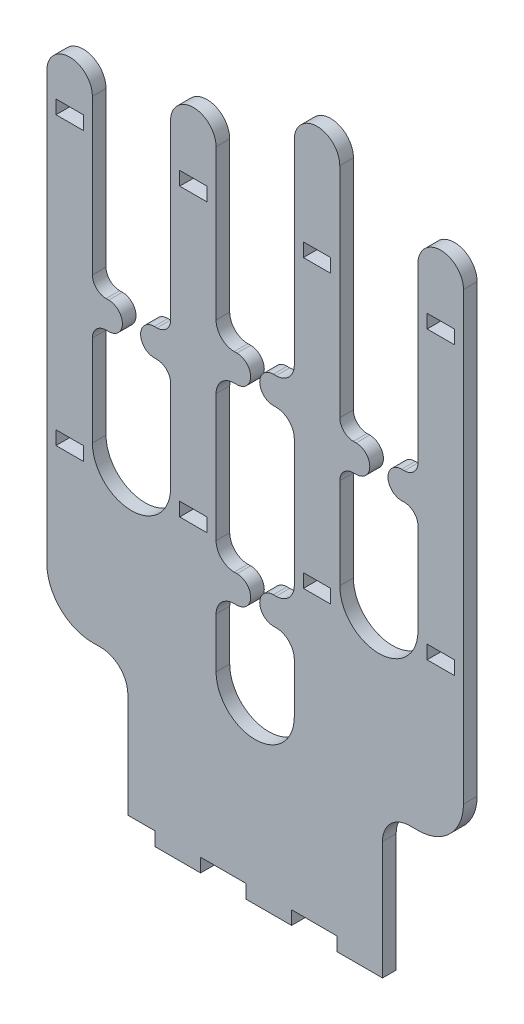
ISO-10303-21;
HEADER;
FILE_DESCRIPTION(('STEP AP214'),'2;1');
FILE_NAME('part.step','',(''),(''),'','','');
FILE_SCHEMA(('AUTOMOTIVE_DESIGN { 1 0 10303 214 1 1 1 1 }'));
ENDSEC;
DATA;
#1=APPLICATION_CONTEXT('core data for automotive mechanical design processes');
#2=APPLICATION_PROTOCOL_DEFINITION('international standard','automotive_design',2000,#1);
#3=PRODUCT_CONTEXT('',#1,'mechanical');
#4=PRODUCT('Part','Part','',(#3));
#5=PRODUCT_RELATED_PRODUCT_CATEGORY('part','',(#4));
#6=PRODUCT_DEFINITION_FORMATION('','',#4);
#7=PRODUCT_DEFINITION_CONTEXT('part definition',#1,'design');
#8=PRODUCT_DEFINITION('design','',#6,#7);
#9=PRODUCT_DEFINITION_SHAPE('','',#8);
#10=(LENGTH_UNIT() NAMED_UNIT(*) SI_UNIT(.MILLI.,.METRE.));
#11=(NAMED_UNIT(*) PLANE_ANGLE_UNIT() SI_UNIT($,.RADIAN.));
#12=(NAMED_UNIT(*) SI_UNIT($,.STERADIAN.) SOLID_ANGLE_UNIT());
#13=UNCERTAINTY_MEASURE_WITH_UNIT(LENGTH_MEASURE(1.E-05),#10,'distance_accuracy_value','');
#14=(GEOMETRIC_REPRESENTATION_CONTEXT(3) GLOBAL_UNCERTAINTY_ASSIGNED_CONTEXT((#13)) GLOBAL_UNIT_ASSIGNED_CONTEXT((#10,
#11,#12)) REPRESENTATION_CONTEXT('',''));
#15=CARTESIAN_POINT('',(0.,0.,0.));
#16=DIRECTION('',(0.,0.,1.));
#17=DIRECTION('',(1.,0.,0.));
#18=AXIS2_PLACEMENT_3D('',#15,#16,#17);
#19=CARTESIAN_POINT('',(0.,0.,15.));
#20=DIRECTION('',(0.,1.,0.));
#21=DIRECTION('',(-1.,0.,0.));
#22=AXIS2_PLACEMENT_3D('',#19,#20,#21);
#23=PLANE('',#22);
#24=DIRECTION('',(1.,0.,0.));
#25=VECTOR('',#24,1.);
#26=CARTESIAN_POINT('',(140.,0.,15.));
#27=LINE('',#26,#25);
#28=CARTESIAN_POINT('',(-9.99999999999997,0.,15.));
#29=VERTEX_POINT('',#28);
#30=CARTESIAN_POINT('',(40.,0.,15.));
#31=VERTEX_POINT('',#30);
#32=EDGE_CURVE('E1200',#29,#31,#27,.T.);
#33=ORIENTED_EDGE('',*,*,#32,.F.);
#34=DIRECTION('',(0.,0.,1.));
#35=VECTOR('',#34,1.);
#36=CARTESIAN_POINT('',(-9.99999999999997,0.,0.));
#37=LINE('',#36,#35);
#38=CARTESIAN_POINT('',(-9.99999999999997,0.,0.));
#39=VERTEX_POINT('',#38);
#40=EDGE_CURVE('E794',#39,#29,#37,.T.);
#41=ORIENTED_EDGE('',*,*,#40,.F.);
#42=DIRECTION('',(1.,0.,0.));
#43=VECTOR('',#42,1.);
#44=CARTESIAN_POINT('',(0.,0.,0.));
#45=LINE('',#44,#43);
#46=CARTESIAN_POINT('',(40.,0.,0.));
#47=VERTEX_POINT('',#46);
#48=EDGE_CURVE('E1632',#39,#47,#45,.T.);
#49=ORIENTED_EDGE('',*,*,#48,.T.);
#50=DIRECTION('',(0.,0.,1.));
#51=VECTOR('',#50,1.);
#52=CARTESIAN_POINT('',(40.,0.,0.));
#53=LINE('',#52,#51);
#54=EDGE_CURVE('E824',#47,#31,#53,.T.);
#55=ORIENTED_EDGE('',*,*,#54,.T.);
#56=EDGE_LOOP('',(#33,#41,#49,#55));
#57=FACE_BOUND('',#56,.T.);
#58=ADVANCED_FACE('F43',(#57),#23,.F.);
#59=CARTESIAN_POINT('',(90.0000000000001,0.,15.));
#60=VERTEX_POINT('',#59);
#61=CARTESIAN_POINT('',(140.,0.,15.));
#62=VERTEX_POINT('',#61);
#63=EDGE_CURVE('E1197',#60,#62,#27,.T.);
#64=ORIENTED_EDGE('',*,*,#63,.F.);
#65=DIRECTION('',(0.,0.,1.));
#66=VECTOR('',#65,1.);
#67=CARTESIAN_POINT('',(90.0000000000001,0.,0.));
#68=LINE('',#67,#66);
#69=CARTESIAN_POINT('',(90.0000000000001,0.,0.));
#70=VERTEX_POINT('',#69);
#71=EDGE_CURVE('E827',#70,#60,#68,.T.);
#72=ORIENTED_EDGE('',*,*,#71,.F.);
#73=CARTESIAN_POINT('',(140.,0.,0.));
#74=VERTEX_POINT('',#73);
#75=EDGE_CURVE('E1629',#70,#74,#45,.T.);
#76=ORIENTED_EDGE('',*,*,#75,.T.);
#77=DIRECTION('',(0.,0.,-1.));
#78=VECTOR('',#77,1.);
#79=CARTESIAN_POINT('',(140.,0.,15.));
#80=LINE('',#79,#78);
#81=EDGE_CURVE('E11',#62,#74,#80,.T.);
#82=ORIENTED_EDGE('',*,*,#81,.F.);
#83=EDGE_LOOP('',(#64,#72,#76,#82));
#84=FACE_BOUND('',#83,.T.);
#85=ADVANCED_FACE('F1939',(#84),#23,.F.);
#86=CARTESIAN_POINT('',(-170.,130.,15.));
#87=DIRECTION('',(0.,0.,1.));
#88=DIRECTION('',(1.,0.,0.));
#89=AXIS2_PLACEMENT_3D('',#86,#87,#88);
#90=PLANE('',#89);
#91=DIRECTION('',(-1.,0.,0.));
#92=VECTOR('',#91,1.);
#93=CARTESIAN_POINT('',(-140.,15.,15.));
#94=LINE('',#93,#92);
#95=CARTESIAN_POINT('',(-110.,15.,15.));
#96=VERTEX_POINT('',#95);
#97=CARTESIAN_POINT('',(-140.,15.,15.));
#98=VERTEX_POINT('',#97);
#99=EDGE_CURVE('E774',#96,#98,#94,.T.);
#100=ORIENTED_EDGE('',*,*,#99,.F.);
#101=DIRECTION('',(0.,1.,0.));
#102=VECTOR('',#101,1.);
#103=CARTESIAN_POINT('',(-110.,0.,15.));
#104=LINE('',#103,#102);
#105=CARTESIAN_POINT('',(-110.,0.,15.));
#106=VERTEX_POINT('',#105);
#107=EDGE_CURVE('E751',#106,#96,#104,.T.);
#108=ORIENTED_EDGE('',*,*,#107,.F.);
#109=CARTESIAN_POINT('',(-60.,0.,15.));
#110=VERTEX_POINT('',#109);
#111=EDGE_CURVE('E1201',#106,#110,#27,.T.);
#112=ORIENTED_EDGE('',*,*,#111,.T.);
#113=DIRECTION('',(0.,-1.,0.));
#114=VECTOR('',#113,1.);
#115=CARTESIAN_POINT('',(-60.,0.,15.));
#116=LINE('',#115,#114);
#117=CARTESIAN_POINT('',(-60.,15.,15.));
#118=VERTEX_POINT('',#117);
#119=EDGE_CURVE('E67',#118,#110,#116,.T.);
#120=ORIENTED_EDGE('',*,*,#119,.F.);
#121=DIRECTION('',(-1.,0.,0.));
#122=VECTOR('',#121,1.);
#123=CARTESIAN_POINT('',(-60.,15.,15.));
#124=LINE('',#123,#122);
#125=CARTESIAN_POINT('',(-9.99999999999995,15.,15.));
#126=VERTEX_POINT('',#125);
#127=EDGE_CURVE('E780',#126,#118,#124,.T.);
#128=ORIENTED_EDGE('',*,*,#127,.F.);
#129=DIRECTION('',(0.,1.,0.));
#130=VECTOR('',#129,1.);
#131=CARTESIAN_POINT('',(-9.99999999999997,0.,15.));
#132=LINE('',#131,#130);
#133=EDGE_CURVE('E801',#29,#126,#132,.T.);
#134=ORIENTED_EDGE('',*,*,#133,.F.);
#135=ORIENTED_EDGE('',*,*,#32,.T.);
#136=DIRECTION('',(0.,-1.,0.));
#137=VECTOR('',#136,1.);
#138=CARTESIAN_POINT('',(40.,0.,15.));
#139=LINE('',#138,#137);
#140=CARTESIAN_POINT('',(40.,15.,15.));
#141=VERTEX_POINT('',#140);
#142=EDGE_CURVE('E59',#141,#31,#139,.T.);
#143=ORIENTED_EDGE('',*,*,#142,.F.);
#144=DIRECTION('',(-1.,0.,0.));
#145=VECTOR('',#144,1.);
#146=CARTESIAN_POINT('',(40.,15.,15.));
#147=LINE('',#146,#145);
#148=CARTESIAN_POINT('',(90.0000000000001,15.,15.));
#149=VERTEX_POINT('',#148);
#150=EDGE_CURVE('E800',#149,#141,#147,.T.);
#151=ORIENTED_EDGE('',*,*,#150,.F.);
#152=DIRECTION('',(0.,1.,0.));
#153=VECTOR('',#152,1.);
#154=CARTESIAN_POINT('',(90.0000000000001,0.,15.));
#155=LINE('',#154,#153);
#156=EDGE_CURVE('E833',#60,#149,#155,.T.);
#157=ORIENTED_EDGE('',*,*,#156,.F.);
#158=ORIENTED_EDGE('',*,*,#63,.T.);
#159=DIRECTION('',(0.,1.,0.));
#160=VECTOR('',#159,1.);
#161=CARTESIAN_POINT('',(140.,130.,15.));
#162=LINE('',#161,#160);
#163=CARTESIAN_POINT('',(140.,130.,15.));
#164=VERTEX_POINT('',#163);
#165=EDGE_CURVE('E1202',#62,#164,#162,.T.);
#166=ORIENTED_EDGE('',*,*,#165,.T.);
#167=CARTESIAN_POINT('',(170.,130.,15.));
#168=DIRECTION('',(0.,0.,-1.));
#169=DIRECTION('',(1.,0.,0.));
#170=AXIS2_PLACEMENT_3D('',#167,#168,#169);
#171=CIRCLE('',#170,30.);
#172=CARTESIAN_POINT('',(170.,160.,15.));
#173=VERTEX_POINT('',#172);
#174=EDGE_CURVE('E1205',#164,#173,#171,.T.);
#175=ORIENTED_EDGE('',*,*,#174,.T.);
#176=DIRECTION('',(1.,0.,0.));
#177=VECTOR('',#176,1.);
#178=CARTESIAN_POINT('',(178.999999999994,160.,15.));
#179=LINE('',#178,#177);
#180=CARTESIAN_POINT('',(178.999999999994,159.999999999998,15.));
#181=VERTEX_POINT('',#180);
#182=EDGE_CURVE('E1208',#173,#181,#179,.T.);
#183=ORIENTED_EDGE('',*,*,#182,.T.);
#184=CARTESIAN_POINT('',(178.999999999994,210.,15.));
#185=DIRECTION('',(0.,0.,1.));
#186=DIRECTION('',(-1.,0.,0.));
#187=AXIS2_PLACEMENT_3D('',#184,#185,#186);
#188=CIRCLE('',#187,50.0000000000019);
#189=CARTESIAN_POINT('',(228.999999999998,210.000000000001,15.));
#190=VERTEX_POINT('',#189);
#191=EDGE_CURVE('E1211',#181,#190,#188,.T.);
#192=ORIENTED_EDGE('',*,*,#191,.T.);
#193=DIRECTION('',(0.,1.,0.));
#194=VECTOR('',#193,1.);
#195=CARTESIAN_POINT('',(228.999999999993,700.,15.));
#196=LINE('',#195,#194);
#197=CARTESIAN_POINT('',(228.999999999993,700.,15.));
#198=VERTEX_POINT('',#197);
#199=EDGE_CURVE('E1214',#190,#198,#196,.T.);
#200=ORIENTED_EDGE('',*,*,#199,.T.);
#201=CARTESIAN_POINT('',(203.999999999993,700.,15.));
#202=DIRECTION('',(0.,0.,1.));
#203=DIRECTION('',(-1.,0.,0.));
#204=AXIS2_PLACEMENT_3D('',#201,#202,#203);
#205=CIRCLE('',#204,25.);
#206=CARTESIAN_POINT('',(178.999999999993,700.,15.));
#207=VERTEX_POINT('',#206);
#208=EDGE_CURVE('E1217',#198,#207,#205,.T.);
#209=ORIENTED_EDGE('',*,*,#208,.T.);
#210=DIRECTION('',(0.,-1.,0.));
#211=VECTOR('',#210,1.);
#212=CARTESIAN_POINT('',(179.000000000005,510.000000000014,15.));
#213=LINE('',#212,#211);
#214=CARTESIAN_POINT('',(179.000000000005,510.000000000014,15.));
#215=VERTEX_POINT('',#214);
#216=EDGE_CURVE('E1220',#207,#215,#213,.T.);
#217=ORIENTED_EDGE('',*,*,#216,.T.);
#218=CARTESIAN_POINT('',(164.000000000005,510.000000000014,15.));
#219=DIRECTION('',(0.,0.,-1.));
#220=DIRECTION('',(-1.,0.,0.));
#221=AXIS2_PLACEMENT_3D('',#218,#219,#220);
#222=CIRCLE('',#221,15.);
#223=CARTESIAN_POINT('',(164.000000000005,495.000000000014,15.));
#224=VERTEX_POINT('',#223);
#225=EDGE_CURVE('E1223',#215,#224,#222,.T.);
#226=ORIENTED_EDGE('',*,*,#225,.T.);
#227=DIRECTION('',(-1.,0.,0.));
#228=VECTOR('',#227,1.);
#229=CARTESIAN_POINT('',(164.000000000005,495.000000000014,15.));
#230=LINE('',#229,#228);
#231=CARTESIAN_POINT('',(161.000000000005,495.000000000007,15.));
#232=VERTEX_POINT('',#231);
#233=EDGE_CURVE('E1226',#224,#232,#230,.T.);
#234=ORIENTED_EDGE('',*,*,#233,.T.);
#235=CARTESIAN_POINT('',(161.000000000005,480.,15.));
#236=DIRECTION('',(0.,0.,1.));
#237=DIRECTION('',(1.,0.,0.));
#238=AXIS2_PLACEMENT_3D('',#235,#236,#237);
#239=CIRCLE('',#238,15.0000000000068);
#240=CARTESIAN_POINT('',(161.000000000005,465.,15.));
#241=VERTEX_POINT('',#240);
#242=EDGE_CURVE('E1229',#232,#241,#239,.T.);
#243=ORIENTED_EDGE('',*,*,#242,.T.);
#244=DIRECTION('',(1.,0.,0.));
#245=VECTOR('',#244,1.);
#246=CARTESIAN_POINT('',(161.000000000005,465.,15.));
#247=LINE('',#246,#245);
#248=CARTESIAN_POINT('',(164.000000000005,465.,15.));
#249=VERTEX_POINT('',#248);
#250=EDGE_CURVE('E1232',#241,#249,#247,.T.);
#251=ORIENTED_EDGE('',*,*,#250,.T.);
#252=CARTESIAN_POINT('',(164.000000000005,450.,15.));
#253=DIRECTION('',(0.,0.,-1.));
#254=DIRECTION('',(-1.,0.,0.));
#255=AXIS2_PLACEMENT_3D('',#252,#253,#254);
#256=CIRCLE('',#255,15.);
#257=CARTESIAN_POINT('',(179.000000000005,450.,15.));
#258=VERTEX_POINT('',#257);
#259=EDGE_CURVE('E1235',#249,#258,#256,.T.);
#260=ORIENTED_EDGE('',*,*,#259,.T.);
#261=DIRECTION('',(0.,-1.,0.));
#262=VECTOR('',#261,1.);
#263=CARTESIAN_POINT('',(178.999999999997,350.,15.));
#264=LINE('',#263,#262);
#265=CARTESIAN_POINT('',(178.999999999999,350.,15.));
#266=VERTEX_POINT('',#265);
#267=EDGE_CURVE('E1238',#258,#266,#264,.T.);
#268=ORIENTED_EDGE('',*,*,#267,.T.);
#269=CARTESIAN_POINT('',(135.999999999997,350.,15.));
#270=DIRECTION('',(0.,0.,-1.));
#271=DIRECTION('',(1.,0.,0.));
#272=AXIS2_PLACEMENT_3D('',#269,#270,#271);
#273=CIRCLE('',#272,43.0000000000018);
#274=CARTESIAN_POINT('',(92.999999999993,350.,15.));
#275=VERTEX_POINT('',#274);
#276=EDGE_CURVE('E1241',#266,#275,#273,.T.);
#277=ORIENTED_EDGE('',*,*,#276,.T.);
#278=DIRECTION('',(0.,1.,0.));
#279=VECTOR('',#278,1.);
#280=CARTESIAN_POINT('',(92.9999999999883,450.,15.));
#281=LINE('',#280,#279);
#282=CARTESIAN_POINT('',(92.9999999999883,450.,15.));
#283=VERTEX_POINT('',#282);
#284=EDGE_CURVE('E1244',#275,#283,#281,.T.);
#285=ORIENTED_EDGE('',*,*,#284,.T.);
#286=CARTESIAN_POINT('',(107.999999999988,450.,15.));
#287=DIRECTION('',(0.,0.,-1.));
#288=DIRECTION('',(1.,0.,0.));
#289=AXIS2_PLACEMENT_3D('',#286,#287,#288);
#290=CIRCLE('',#289,15.);
#291=CARTESIAN_POINT('',(107.999999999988,465.,15.));
#292=VERTEX_POINT('',#291);
#293=EDGE_CURVE('E1247',#283,#292,#290,.T.);
#294=ORIENTED_EDGE('',*,*,#293,.T.);
#295=DIRECTION('',(1.,0.,0.));
#296=VECTOR('',#295,1.);
#297=CARTESIAN_POINT('',(110.999999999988,465.,15.));
#298=LINE('',#297,#296);
#299=CARTESIAN_POINT('',(110.999999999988,464.999999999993,15.));
#300=VERTEX_POINT('',#299);
#301=EDGE_CURVE('E1250',#292,#300,#298,.T.);
#302=ORIENTED_EDGE('',*,*,#301,.T.);
#303=CARTESIAN_POINT('',(110.999999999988,480.,15.));
#304=DIRECTION('',(0.,0.,1.));
#305=DIRECTION('',(-1.,0.,0.));
#306=AXIS2_PLACEMENT_3D('',#303,#304,#305);
#307=CIRCLE('',#306,15.0000000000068);
#308=CARTESIAN_POINT('',(110.999999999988,495.000000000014,15.));
#309=VERTEX_POINT('',#308);
#310=EDGE_CURVE('E1253',#300,#309,#307,.T.);
#311=ORIENTED_EDGE('',*,*,#310,.T.);
#312=DIRECTION('',(-1.,0.,0.));
#313=VECTOR('',#312,1.);
#314=CARTESIAN_POINT('',(107.999999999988,495.000000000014,15.));
#315=LINE('',#314,#313);
#316=CARTESIAN_POINT('',(107.999999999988,495.000000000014,15.));
#317=VERTEX_POINT('',#316);
#318=EDGE_CURVE('E1256',#309,#317,#315,.T.);
#319=ORIENTED_EDGE('',*,*,#318,.T.);
#320=CARTESIAN_POINT('',(107.999999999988,510.000000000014,15.));
#321=DIRECTION('',(0.,0.,-1.));
#322=DIRECTION('',(1.,0.,0.));
#323=AXIS2_PLACEMENT_3D('',#320,#321,#322);
#324=CIRCLE('',#323,15.);
#325=CARTESIAN_POINT('',(92.9999999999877,510.000000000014,15.));
#326=VERTEX_POINT('',#325);
#327=EDGE_CURVE('E1259',#317,#326,#324,.T.);
#328=ORIENTED_EDGE('',*,*,#327,.T.);
#329=DIRECTION('',(0.,1.,0.));
#330=VECTOR('',#329,1.);
#331=CARTESIAN_POINT('',(92.9999999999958,750.,15.));
#332=LINE('',#331,#330);
#333=CARTESIAN_POINT('',(92.9999999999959,750.,15.));
#334=VERTEX_POINT('',#333);
#335=EDGE_CURVE('E1262',#326,#334,#332,.T.);
#336=ORIENTED_EDGE('',*,*,#335,.T.);
#337=CARTESIAN_POINT('',(68.0000000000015,750.,15.));
#338=DIRECTION('',(0.,0.,1.));
#339=DIRECTION('',(-1.,0.,0.));
#340=AXIS2_PLACEMENT_3D('',#337,#338,#339);
#341=CIRCLE('',#340,24.9999999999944);
#342=CARTESIAN_POINT('',(43.0000000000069,750.,15.));
#343=VERTEX_POINT('',#342);
#344=EDGE_CURVE('E1265',#334,#343,#341,.T.);
#345=ORIENTED_EDGE('',*,*,#344,.T.);
#346=DIRECTION('',(0.,-1.,0.));
#347=VECTOR('',#346,1.);
#348=CARTESIAN_POINT('',(43.0000000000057,535.000000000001,15.));
#349=LINE('',#348,#347);
#350=CARTESIAN_POINT('',(43.0000000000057,535.000000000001,15.));
#351=VERTEX_POINT('',#350);
#352=EDGE_CURVE('E1268',#343,#351,#349,.T.);
#353=ORIENTED_EDGE('',*,*,#352,.T.);
#354=CARTESIAN_POINT('',(23.0000000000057,535.000000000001,15.));
#355=DIRECTION('',(0.,0.,-1.));
#356=DIRECTION('',(-1.,0.,0.));
#357=AXIS2_PLACEMENT_3D('',#354,#355,#356);
#358=CIRCLE('',#357,20.);
#359=CARTESIAN_POINT('',(23.0000000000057,515.000000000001,15.));
#360=VERTEX_POINT('',#359);
#361=EDGE_CURVE('E1271',#351,#360,#358,.T.);
#362=ORIENTED_EDGE('',*,*,#361,.T.);
#363=DIRECTION('',(-1.,0.,0.));
#364=VECTOR('',#363,1.);
#365=CARTESIAN_POINT('',(23.0000000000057,515.000000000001,15.));
#366=LINE('',#365,#364);
#367=CARTESIAN_POINT('',(20.0000000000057,515.000000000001,15.));
#368=VERTEX_POINT('',#367);
#369=EDGE_CURVE('E1274',#360,#368,#366,.T.);
#370=ORIENTED_EDGE('',*,*,#369,.T.);
#371=CARTESIAN_POINT('',(20.0000000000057,500.000000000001,15.));
#372=DIRECTION('',(0.,0.,1.));
#373=DIRECTION('',(1.,0.,0.));
#374=AXIS2_PLACEMENT_3D('',#371,#372,#373);
#375=CIRCLE('',#374,15.);
#376=CARTESIAN_POINT('',(20.0000000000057,485.000000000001,15.));
#377=VERTEX_POINT('',#376);
#378=EDGE_CURVE('E1277',#368,#377,#375,.T.);
#379=ORIENTED_EDGE('',*,*,#378,.T.);
#380=DIRECTION('',(1.,0.,0.));
#381=VECTOR('',#380,1.);
#382=CARTESIAN_POINT('',(20.0000000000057,485.000000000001,15.));
#383=LINE('',#382,#381);
#384=CARTESIAN_POINT('',(23.0000000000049,485.000000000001,15.));
#385=VERTEX_POINT('',#384);
#386=EDGE_CURVE('E1280',#377,#385,#383,.T.);
#387=ORIENTED_EDGE('',*,*,#386,.T.);
#388=CARTESIAN_POINT('',(23.0000000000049,465.000000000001,15.));
#389=DIRECTION('',(0.,0.,-1.));
#390=DIRECTION('',(-1.,0.,0.));
#391=AXIS2_PLACEMENT_3D('',#388,#389,#390);
#392=CIRCLE('',#391,20.);
#393=CARTESIAN_POINT('',(43.0000000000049,465.000000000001,15.));
#394=VERTEX_POINT('',#393);
#395=EDGE_CURVE('E1283',#385,#394,#392,.T.);
#396=ORIENTED_EDGE('',*,*,#395,.T.);
#397=DIRECTION('',(0.,-1.,0.));
#398=VECTOR('',#397,1.);
#399=CARTESIAN_POINT('',(43.0000000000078,325.000000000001,15.));
#400=LINE('',#399,#398);
#401=CARTESIAN_POINT('',(43.0000000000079,325.000000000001,15.));
#402=VERTEX_POINT('',#401);
#403=EDGE_CURVE('E1286',#394,#402,#400,.T.);
#404=ORIENTED_EDGE('',*,*,#403,.T.);
#405=CARTESIAN_POINT('',(23.0000000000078,325.000000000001,15.));
#406=DIRECTION('',(0.,0.,-1.));
#407=DIRECTION('',(-1.,0.,0.));
#408=AXIS2_PLACEMENT_3D('',#405,#406,#407);
#409=CIRCLE('',#408,20.);
#410=CARTESIAN_POINT('',(23.0000000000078,305.000000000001,15.));
#411=VERTEX_POINT('',#410);
#412=EDGE_CURVE('E1289',#402,#411,#409,.T.);
#413=ORIENTED_EDGE('',*,*,#412,.T.);
#414=DIRECTION('',(-1.,0.,0.));
#415=VECTOR('',#414,1.);
#416=CARTESIAN_POINT('',(23.0000000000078,305.000000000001,15.));
#417=LINE('',#416,#415);
#418=CARTESIAN_POINT('',(20.0000000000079,305.000000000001,15.));
#419=VERTEX_POINT('',#418);
#420=EDGE_CURVE('E1292',#411,#419,#417,.T.);
#421=ORIENTED_EDGE('',*,*,#420,.T.);
#422=CARTESIAN_POINT('',(20.0000000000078,290.000000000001,15.));
#423=DIRECTION('',(0.,0.,1.));
#424=DIRECTION('',(1.,0.,0.));
#425=AXIS2_PLACEMENT_3D('',#422,#423,#424);
#426=CIRCLE('',#425,15.);
#427=CARTESIAN_POINT('',(20.0000000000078,275.000000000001,15.));
#428=VERTEX_POINT('',#427);
#429=EDGE_CURVE('E1295',#419,#428,#426,.T.);
#430=ORIENTED_EDGE('',*,*,#429,.T.);
#431=DIRECTION('',(1.,0.,0.));
#432=VECTOR('',#431,1.);
#433=CARTESIAN_POINT('',(20.0000000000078,275.000000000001,15.));
#434=LINE('',#433,#432);
#435=CARTESIAN_POINT('',(23.0000000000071,275.000000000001,15.));
#436=VERTEX_POINT('',#435);
#437=EDGE_CURVE('E1298',#428,#436,#434,.T.);
#438=ORIENTED_EDGE('',*,*,#437,.T.);
#439=CARTESIAN_POINT('',(23.0000000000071,255.000000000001,15.));
#440=DIRECTION('',(0.,0.,-1.));
#441=DIRECTION('',(-1.,0.,0.));
#442=AXIS2_PLACEMENT_3D('',#439,#440,#441);
#443=CIRCLE('',#442,20.);
#444=CARTESIAN_POINT('',(43.0000000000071,255.000000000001,15.));
#445=VERTEX_POINT('',#444);
#446=EDGE_CURVE('E1301',#436,#445,#443,.T.);
#447=ORIENTED_EDGE('',*,*,#446,.T.);
#448=DIRECTION('',(0.,-1.,0.));
#449=VECTOR('',#448,1.);
#450=CARTESIAN_POINT('',(43.0000000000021,200.,15.));
#451=LINE('',#450,#449);
#452=CARTESIAN_POINT('',(43.,200.,15.));
#453=VERTEX_POINT('',#452);
#454=EDGE_CURVE('E1304',#445,#453,#451,.T.);
#455=ORIENTED_EDGE('',*,*,#454,.T.);
#456=CARTESIAN_POINT('',(-2.07039586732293E-12,200.,15.));
#457=DIRECTION('',(0.,0.,-1.));
#458=DIRECTION('',(1.,0.,0.));
#459=AXIS2_PLACEMENT_3D('',#456,#457,#458);
#460=CIRCLE('',#459,43.0000000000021);
#461=CARTESIAN_POINT('',(-43.0000000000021,200.,15.));
#462=VERTEX_POINT('',#461);
#463=EDGE_CURVE('E1307',#453,#462,#460,.T.);
#464=ORIENTED_EDGE('',*,*,#463,.T.);
#465=DIRECTION('',(0.,1.,0.));
#466=VECTOR('',#465,1.);
#467=CARTESIAN_POINT('',(-43.0000000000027,255.000000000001,15.));
#468=LINE('',#467,#466);
#469=CARTESIAN_POINT('',(-43.0000000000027,255.000000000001,15.));
#470=VERTEX_POINT('',#469);
#471=EDGE_CURVE('E1310',#462,#470,#468,.T.);
#472=ORIENTED_EDGE('',*,*,#471,.T.);
#473=CARTESIAN_POINT('',(-23.0000000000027,255.000000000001,15.));
#474=DIRECTION('',(0.,0.,-1.));
#475=DIRECTION('',(1.,0.,0.));
#476=AXIS2_PLACEMENT_3D('',#473,#474,#475);
#477=CIRCLE('',#476,20.);
#478=CARTESIAN_POINT('',(-23.0000000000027,275.000000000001,15.));
#479=VERTEX_POINT('',#478);
#480=EDGE_CURVE('E1313',#470,#479,#477,.T.);
#481=ORIENTED_EDGE('',*,*,#480,.T.);
#482=DIRECTION('',(1.,0.,0.));
#483=VECTOR('',#482,1.);
#484=CARTESIAN_POINT('',(-20.0000000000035,275.000000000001,15.));
#485=LINE('',#484,#483);
#486=CARTESIAN_POINT('',(-20.0000000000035,275.000000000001,15.));
#487=VERTEX_POINT('',#486);
#488=EDGE_CURVE('E1316',#479,#487,#485,.T.);
#489=ORIENTED_EDGE('',*,*,#488,.T.);
#490=CARTESIAN_POINT('',(-20.0000000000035,290.000000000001,15.));
#491=DIRECTION('',(0.,0.,1.));
#492=DIRECTION('',(-1.,0.,0.));
#493=AXIS2_PLACEMENT_3D('',#490,#491,#492);
#494=CIRCLE('',#493,15.);
#495=CARTESIAN_POINT('',(-20.0000000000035,305.000000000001,15.));
#496=VERTEX_POINT('',#495);
#497=EDGE_CURVE('E1319',#487,#496,#494,.T.);
#498=ORIENTED_EDGE('',*,*,#497,.T.);
#499=DIRECTION('',(-1.,0.,0.));
#500=VECTOR('',#499,1.);
#501=CARTESIAN_POINT('',(-23.0000000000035,305.000000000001,15.));
#502=LINE('',#501,#500);
#503=CARTESIAN_POINT('',(-23.0000000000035,305.000000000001,15.));
#504=VERTEX_POINT('',#503);
#505=EDGE_CURVE('E1322',#496,#504,#502,.T.);
#506=ORIENTED_EDGE('',*,*,#505,.T.);
#507=CARTESIAN_POINT('',(-23.0000000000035,325.000000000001,15.));
#508=DIRECTION('',(0.,0.,-1.));
#509=DIRECTION('',(1.,0.,0.));
#510=AXIS2_PLACEMENT_3D('',#507,#508,#509);
#511=CIRCLE('',#510,20.);
#512=CARTESIAN_POINT('',(-43.0000000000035,325.000000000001,15.));
#513=VERTEX_POINT('',#512);
#514=EDGE_CURVE('E1325',#504,#513,#511,.T.);
#515=ORIENTED_EDGE('',*,*,#514,.T.);
#516=DIRECTION('',(0.,1.,0.));
#517=VECTOR('',#516,1.);
#518=CARTESIAN_POINT('',(-43.0000000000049,465.000000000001,15.));
#519=LINE('',#518,#517);
#520=CARTESIAN_POINT('',(-43.000000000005,465.000000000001,15.));
#521=VERTEX_POINT('',#520);
#522=EDGE_CURVE('E1328',#513,#521,#519,.T.);
#523=ORIENTED_EDGE('',*,*,#522,.T.);
#524=CARTESIAN_POINT('',(-23.0000000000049,465.000000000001,15.));
#525=DIRECTION('',(0.,0.,-1.));
#526=DIRECTION('',(1.,0.,0.));
#527=AXIS2_PLACEMENT_3D('',#524,#525,#526);
#528=CIRCLE('',#527,20.0000000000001);
#529=CARTESIAN_POINT('',(-23.0000000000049,485.000000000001,15.));
#530=VERTEX_POINT('',#529);
#531=EDGE_CURVE('E1331',#521,#530,#528,.T.);
#532=ORIENTED_EDGE('',*,*,#531,.T.);
#533=DIRECTION('',(1.,0.,0.));
#534=VECTOR('',#533,1.);
#535=CARTESIAN_POINT('',(-20.0000000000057,485.000000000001,15.));
#536=LINE('',#535,#534);
#537=CARTESIAN_POINT('',(-20.0000000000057,485.000000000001,15.));
#538=VERTEX_POINT('',#537);
#539=EDGE_CURVE('E1334',#530,#538,#536,.T.);
#540=ORIENTED_EDGE('',*,*,#539,.T.);
#541=CARTESIAN_POINT('',(-20.0000000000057,500.000000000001,15.));
#542=DIRECTION('',(0.,0.,1.));
#543=DIRECTION('',(-1.,0.,0.));
#544=AXIS2_PLACEMENT_3D('',#541,#542,#543);
#545=CIRCLE('',#544,14.9999999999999);
#546=CARTESIAN_POINT('',(-20.0000000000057,515.000000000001,15.));
#547=VERTEX_POINT('',#546);
#548=EDGE_CURVE('E1337',#538,#547,#545,.T.);
#549=ORIENTED_EDGE('',*,*,#548,.T.);
#550=DIRECTION('',(-1.,0.,0.));
#551=VECTOR('',#550,1.);
#552=CARTESIAN_POINT('',(-23.0000000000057,515.000000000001,15.));
#553=LINE('',#552,#551);
#554=CARTESIAN_POINT('',(-23.0000000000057,515.000000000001,15.));
#555=VERTEX_POINT('',#554);
#556=EDGE_CURVE('E1340',#547,#555,#553,.T.);
#557=ORIENTED_EDGE('',*,*,#556,.T.);
#558=CARTESIAN_POINT('',(-23.0000000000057,535.000000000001,15.));
#559=DIRECTION('',(0.,0.,-1.));
#560=DIRECTION('',(1.,0.,0.));
#561=AXIS2_PLACEMENT_3D('',#558,#559,#560);
#562=CIRCLE('',#561,20.);
#563=CARTESIAN_POINT('',(-43.0000000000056,535.000000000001,15.));
#564=VERTEX_POINT('',#563);
#565=EDGE_CURVE('E1343',#555,#564,#562,.T.);
#566=ORIENTED_EDGE('',*,*,#565,.T.);
#567=DIRECTION('',(0.,1.,0.));
#568=VECTOR('',#567,1.);
#569=CARTESIAN_POINT('',(-43.0000000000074,700.,15.));
#570=LINE('',#569,#568);
#571=CARTESIAN_POINT('',(-43.0000000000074,700.,15.));
#572=VERTEX_POINT('',#571);
#573=EDGE_CURVE('E1346',#564,#572,#570,.T.);
#574=ORIENTED_EDGE('',*,*,#573,.T.);
#575=CARTESIAN_POINT('',(-68.0000000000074,700.,15.));
#576=DIRECTION('',(0.,0.,1.));
#577=DIRECTION('',(-1.,0.,0.));
#578=AXIS2_PLACEMENT_3D('',#575,#576,#577);
#579=CIRCLE('',#578,25.);
#580=CARTESIAN_POINT('',(-93.0000000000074,700.,15.));
#581=VERTEX_POINT('',#580);
#582=EDGE_CURVE('E1349',#572,#581,#579,.T.);
#583=ORIENTED_EDGE('',*,*,#582,.T.);
#584=DIRECTION('',(0.,-1.,0.));
#585=VECTOR('',#584,1.);
#586=CARTESIAN_POINT('',(-93.0000000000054,510.000000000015,15.));
#587=LINE('',#586,#585);
#588=CARTESIAN_POINT('',(-93.0000000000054,510.000000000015,15.));
#589=VERTEX_POINT('',#588);
#590=EDGE_CURVE('E1352',#581,#589,#587,.T.);
#591=ORIENTED_EDGE('',*,*,#590,.T.);
#592=CARTESIAN_POINT('',(-108.000000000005,510.000000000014,15.));
#593=DIRECTION('',(0.,0.,-1.));
#594=DIRECTION('',(-1.,0.,0.));
#595=AXIS2_PLACEMENT_3D('',#592,#593,#594);
#596=CIRCLE('',#595,15.);
#597=CARTESIAN_POINT('',(-108.000000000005,495.000000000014,15.));
#598=VERTEX_POINT('',#597);
#599=EDGE_CURVE('E1355',#589,#598,#596,.T.);
#600=ORIENTED_EDGE('',*,*,#599,.T.);
#601=DIRECTION('',(-1.,0.,0.));
#602=VECTOR('',#601,1.);
#603=CARTESIAN_POINT('',(-108.000000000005,495.000000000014,15.));
#604=LINE('',#603,#602);
#605=CARTESIAN_POINT('',(-111.000000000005,495.000000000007,15.));
#606=VERTEX_POINT('',#605);
#607=EDGE_CURVE('E1358',#598,#606,#604,.T.);
#608=ORIENTED_EDGE('',*,*,#607,.T.);
#609=CARTESIAN_POINT('',(-111.000000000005,480.000000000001,15.));
#610=DIRECTION('',(0.,0.,1.));
#611=DIRECTION('',(1.,0.,0.));
#612=AXIS2_PLACEMENT_3D('',#609,#610,#611);
#613=CIRCLE('',#612,15.0000000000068);
#614=CARTESIAN_POINT('',(-111.000000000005,465.000000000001,15.));
#615=VERTEX_POINT('',#614);
#616=EDGE_CURVE('E1361',#606,#615,#613,.T.);
#617=ORIENTED_EDGE('',*,*,#616,.T.);
#618=DIRECTION('',(1.,0.,0.));
#619=VECTOR('',#618,1.);
#620=CARTESIAN_POINT('',(-111.000000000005,465.000000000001,15.));
#621=LINE('',#620,#619);
#622=CARTESIAN_POINT('',(-108.000000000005,465.000000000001,15.));
#623=VERTEX_POINT('',#622);
#624=EDGE_CURVE('E1364',#615,#623,#621,.T.);
#625=ORIENTED_EDGE('',*,*,#624,.T.);
#626=CARTESIAN_POINT('',(-108.000000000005,450.000000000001,15.));
#627=DIRECTION('',(0.,0.,-1.));
#628=DIRECTION('',(-1.,0.,0.));
#629=AXIS2_PLACEMENT_3D('',#626,#627,#628);
#630=CIRCLE('',#629,15.);
#631=CARTESIAN_POINT('',(-93.0000000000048,450.000000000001,15.));
#632=VERTEX_POINT('',#631);
#633=EDGE_CURVE('E1367',#623,#632,#630,.T.);
#634=ORIENTED_EDGE('',*,*,#633,.T.);
#635=DIRECTION('',(0.,-1.,0.));
#636=VECTOR('',#635,1.);
#637=CARTESIAN_POINT('',(-93.0000000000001,350.,15.));
#638=LINE('',#637,#636);
#639=CARTESIAN_POINT('',(-93.0000000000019,350.,15.));
#640=VERTEX_POINT('',#639);
#641=EDGE_CURVE('E1370',#632,#640,#638,.T.);
#642=ORIENTED_EDGE('',*,*,#641,.T.);
#643=CARTESIAN_POINT('',(-136.000000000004,350.,15.));
#644=DIRECTION('',(0.,0.,-1.));
#645=DIRECTION('',(1.,0.,0.));
#646=AXIS2_PLACEMENT_3D('',#643,#644,#645);
#647=CIRCLE('',#646,43.0000000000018);
#648=CARTESIAN_POINT('',(-179.000000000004,350.,15.));
#649=VERTEX_POINT('',#648);
#650=EDGE_CURVE('E1373',#640,#649,#647,.T.);
#651=ORIENTED_EDGE('',*,*,#650,.T.);
#652=DIRECTION('',(0.,1.,0.));
#653=VECTOR('',#652,1.);
#654=CARTESIAN_POINT('',(-179.000000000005,450.,15.));
#655=LINE('',#654,#653);
#656=CARTESIAN_POINT('',(-179.000000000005,450.,15.));
#657=VERTEX_POINT('',#656);
#658=EDGE_CURVE('E1376',#649,#657,#655,.T.);
#659=ORIENTED_EDGE('',*,*,#658,.T.);
#660=CARTESIAN_POINT('',(-164.000000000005,450.,15.));
#661=DIRECTION('',(0.,0.,-1.));
#662=DIRECTION('',(1.,0.,0.));
#663=AXIS2_PLACEMENT_3D('',#660,#661,#662);
#664=CIRCLE('',#663,15.0000000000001);
#665=CARTESIAN_POINT('',(-164.000000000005,465.,15.));
#666=VERTEX_POINT('',#665);
#667=EDGE_CURVE('E1379',#657,#666,#664,.T.);
#668=ORIENTED_EDGE('',*,*,#667,.T.);
#669=DIRECTION('',(1.,0.,0.));
#670=VECTOR('',#669,1.);
#671=CARTESIAN_POINT('',(-161.000000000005,465.,15.));
#672=LINE('',#671,#670);
#673=CARTESIAN_POINT('',(-161.000000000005,464.999999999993,15.));
#674=VERTEX_POINT('',#673);
#675=EDGE_CURVE('E1382',#666,#674,#672,.T.);
#676=ORIENTED_EDGE('',*,*,#675,.T.);
#677=CARTESIAN_POINT('',(-161.000000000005,480.,15.));
#678=DIRECTION('',(0.,0.,1.));
#679=DIRECTION('',(-1.,0.,0.));
#680=AXIS2_PLACEMENT_3D('',#677,#678,#679);
#681=CIRCLE('',#680,15.0000000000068);
#682=CARTESIAN_POINT('',(-161.000000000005,495.000000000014,15.));
#683=VERTEX_POINT('',#682);
#684=EDGE_CURVE('E1385',#674,#683,#681,.T.);
#685=ORIENTED_EDGE('',*,*,#684,.T.);
#686=DIRECTION('',(-1.,0.,0.));
#687=VECTOR('',#686,1.);
#688=CARTESIAN_POINT('',(-164.000000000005,495.000000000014,15.));
#689=LINE('',#688,#687);
#690=CARTESIAN_POINT('',(-164.000000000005,495.000000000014,15.));
#691=VERTEX_POINT('',#690);
#692=EDGE_CURVE('E1388',#683,#691,#689,.T.);
#693=ORIENTED_EDGE('',*,*,#692,.T.);
#694=CARTESIAN_POINT('',(-164.000000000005,510.000000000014,15.));
#695=DIRECTION('',(0.,0.,-1.));
#696=DIRECTION('',(1.,0.,0.));
#697=AXIS2_PLACEMENT_3D('',#694,#695,#696);
#698=CIRCLE('',#697,15.0000000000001);
#699=CARTESIAN_POINT('',(-179.000000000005,510.000000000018,15.));
#700=VERTEX_POINT('',#699);
#701=EDGE_CURVE('E1391',#691,#700,#698,.T.);
#702=ORIENTED_EDGE('',*,*,#701,.T.);
#703=DIRECTION('',(0.,1.,0.));
#704=VECTOR('',#703,1.);
#705=CARTESIAN_POINT('',(-179.000000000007,680.,15.));
#706=LINE('',#705,#704);
#707=CARTESIAN_POINT('',(-179.000000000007,680.,15.));
#708=VERTEX_POINT('',#707);
#709=EDGE_CURVE('E1394',#700,#708,#706,.T.);
#710=ORIENTED_EDGE('',*,*,#709,.T.);
#711=CARTESIAN_POINT('',(-204.000000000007,680.,15.));
#712=DIRECTION('',(0.,0.,1.));
#713=DIRECTION('',(-1.,0.,0.));
#714=AXIS2_PLACEMENT_3D('',#711,#712,#713);
#715=CIRCLE('',#714,25.);
#716=CARTESIAN_POINT('',(-229.000000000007,680.,15.));
#717=VERTEX_POINT('',#716);
#718=EDGE_CURVE('E1397',#708,#717,#715,.T.);
#719=ORIENTED_EDGE('',*,*,#718,.T.);
#720=DIRECTION('',(0.,-1.,0.));
#721=VECTOR('',#720,1.);
#722=CARTESIAN_POINT('',(-229.000000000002,209.999999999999,15.));
#723=LINE('',#722,#721);
#724=CARTESIAN_POINT('',(-229.,209.999999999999,15.));
#725=VERTEX_POINT('',#724);
#726=EDGE_CURVE('E1400',#717,#725,#723,.T.);
#727=ORIENTED_EDGE('',*,*,#726,.T.);
#728=CARTESIAN_POINT('',(-178.999999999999,210.,15.));
#729=DIRECTION('',(0.,0.,1.));
#730=DIRECTION('',(1.,0.,0.));
#731=AXIS2_PLACEMENT_3D('',#728,#729,#730);
#732=CIRCLE('',#731,50.0000000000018);
#733=CARTESIAN_POINT('',(-179.000000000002,160.,15.));
#734=VERTEX_POINT('',#733);
#735=EDGE_CURVE('E1403',#725,#734,#732,.T.);
#736=ORIENTED_EDGE('',*,*,#735,.T.);
#737=DIRECTION('',(1.,0.,0.));
#738=VECTOR('',#737,1.);
#739=CARTESIAN_POINT('',(-170.,160.,15.));
#740=LINE('',#739,#738);
#741=CARTESIAN_POINT('',(-170.,160.,15.));
#742=VERTEX_POINT('',#741);
#743=EDGE_CURVE('E1406',#734,#742,#740,.T.);
#744=ORIENTED_EDGE('',*,*,#743,.T.);
#745=CARTESIAN_POINT('',(-170.,130.,15.));
#746=DIRECTION('',(0.,0.,-1.));
#747=DIRECTION('',(1.,0.,0.));
#748=AXIS2_PLACEMENT_3D('',#745,#746,#747);
#749=CIRCLE('',#748,30.);
#750=CARTESIAN_POINT('',(-140.,130.,15.));
#751=VERTEX_POINT('',#750);
#752=EDGE_CURVE('E1409',#742,#751,#749,.T.);
#753=ORIENTED_EDGE('',*,*,#752,.T.);
#754=DIRECTION('',(0.,-1.,0.));
#755=VECTOR('',#754,1.);
#756=CARTESIAN_POINT('',(-140.,0.,15.));
#757=LINE('',#756,#755);
#758=EDGE_CURVE('E1412',#751,#98,#757,.T.);
#759=ORIENTED_EDGE('',*,*,#758,.T.);
#760=EDGE_LOOP('',(#100,#108,#112,#120,#128,#134,#135,#143,#151,#157,#158,#166,#175,#183,#192,
#200,#209,#217,#226,#234,#243,#251,#260,#268,#277,#285,#294,#302,#311,#319,#328,#336,#345,#353,
#362,#370,#379,#387,#396,#404,#413,#421,#430,#438,#447,#455,#464,#472,#481,#489,#498,#506,#515,
#523,#532,#540,#549,#557,#566,#574,#583,#591,#600,#608,#617,#625,#634,#642,#651,#659,#668,#676,
#685,#693,#702,#710,#719,#727,#736,#744,#753,#759));
#761=FACE_BOUND('',#760,.T.);
#762=DIRECTION('',(1.,0.,0.));
#763=VECTOR('',#762,1.);
#764=CARTESIAN_POINT('',(188.999999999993,642.5,15.));
#765=LINE('',#764,#763);
#766=CARTESIAN_POINT('',(188.999999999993,642.5,15.));
#767=VERTEX_POINT('',#766);
#768=CARTESIAN_POINT('',(218.999999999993,642.5,15.));
#769=VERTEX_POINT('',#768);
#770=EDGE_CURVE('E1157',#767,#769,#765,.T.);
#771=ORIENTED_EDGE('',*,*,#770,.F.);
#772=DIRECTION('',(0.,-1.,0.));
#773=VECTOR('',#772,1.);
#774=CARTESIAN_POINT('',(188.999999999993,657.5,15.));
#775=LINE('',#774,#773);
#776=CARTESIAN_POINT('',(188.999999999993,657.5,15.));
#777=VERTEX_POINT('',#776);
#778=EDGE_CURVE('E1154',#777,#767,#775,.T.);
#779=ORIENTED_EDGE('',*,*,#778,.F.);
#780=DIRECTION('',(-1.,0.,0.));
#781=VECTOR('',#780,1.);
#782=CARTESIAN_POINT('',(188.999999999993,657.5,15.));
#783=LINE('',#782,#781);
#784=CARTESIAN_POINT('',(218.999999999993,657.5,15.));
#785=VERTEX_POINT('',#784);
#786=EDGE_CURVE('E1165',#785,#777,#783,.T.);
#787=ORIENTED_EDGE('',*,*,#786,.F.);
#788=DIRECTION('',(0.,1.,0.));
#789=VECTOR('',#788,1.);
#790=CARTESIAN_POINT('',(218.999999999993,657.5,15.));
#791=LINE('',#790,#789);
#792=EDGE_CURVE('E1161',#769,#785,#791,.T.);
#793=ORIENTED_EDGE('',*,*,#792,.F.);
#794=EDGE_LOOP('',(#771,#779,#787,#793));
#795=FACE_BOUND('',#794,.T.);
#796=DIRECTION('',(0.,-1.,0.));
#797=VECTOR('',#796,1.);
#798=CARTESIAN_POINT('',(52.9999999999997,657.5,15.));
#799=LINE('',#798,#797);
#800=CARTESIAN_POINT('',(52.9999999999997,657.5,15.));
#801=VERTEX_POINT('',#800);
#802=CARTESIAN_POINT('',(52.9999999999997,642.5,15.));
#803=VERTEX_POINT('',#802);
#804=EDGE_CURVE('E1114',#801,#803,#799,.T.);
#805=ORIENTED_EDGE('',*,*,#804,.F.);
#806=DIRECTION('',(-1.,0.,0.));
#807=VECTOR('',#806,1.);
#808=CARTESIAN_POINT('',(82.9999999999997,657.5,15.));
#809=LINE('',#808,#807);
#810=CARTESIAN_POINT('',(82.9999999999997,657.5,15.));
#811=VERTEX_POINT('',#810);
#812=EDGE_CURVE('E1111',#811,#801,#809,.T.);
#813=ORIENTED_EDGE('',*,*,#812,.F.);
#814=DIRECTION('',(0.,1.,0.));
#815=VECTOR('',#814,1.);
#816=CARTESIAN_POINT('',(82.9999999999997,657.5,15.));
#817=LINE('',#816,#815);
#818=CARTESIAN_POINT('',(82.9999999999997,642.5,15.));
#819=VERTEX_POINT('',#818);
#820=EDGE_CURVE('E1122',#819,#811,#817,.T.);
#821=ORIENTED_EDGE('',*,*,#820,.F.);
#822=DIRECTION('',(1.,0.,0.));
#823=VECTOR('',#822,1.);
#824=CARTESIAN_POINT('',(82.9999999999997,642.5,15.));
#825=LINE('',#824,#823);
#826=EDGE_CURVE('E1118',#803,#819,#825,.T.);
#827=ORIENTED_EDGE('',*,*,#826,.F.);
#828=EDGE_LOOP('',(#805,#813,#821,#827));
#829=FACE_BOUND('',#828,.T.);
#830=DIRECTION('',(1.,0.,0.));
#831=VECTOR('',#830,1.);
#832=CARTESIAN_POINT('',(188.999999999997,327.5,15.));
#833=LINE('',#832,#831);
#834=CARTESIAN_POINT('',(188.999999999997,327.5,15.));
#835=VERTEX_POINT('',#834);
#836=CARTESIAN_POINT('',(218.999999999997,327.499999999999,15.));
#837=VERTEX_POINT('',#836);
#838=EDGE_CURVE('E1071',#835,#837,#833,.T.);
#839=ORIENTED_EDGE('',*,*,#838,.F.);
#840=DIRECTION('',(0.,-1.,0.));
#841=VECTOR('',#840,1.);
#842=CARTESIAN_POINT('',(188.999999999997,342.5,15.));
#843=LINE('',#842,#841);
#844=CARTESIAN_POINT('',(188.999999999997,342.5,15.));
#845=VERTEX_POINT('',#844);
#846=EDGE_CURVE('E1068',#845,#835,#843,.T.);
#847=ORIENTED_EDGE('',*,*,#846,.F.);
#848=DIRECTION('',(-1.,0.,0.));
#849=VECTOR('',#848,1.);
#850=CARTESIAN_POINT('',(188.999999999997,342.5,15.));
#851=LINE('',#850,#849);
#852=CARTESIAN_POINT('',(218.999999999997,342.5,15.));
#853=VERTEX_POINT('',#852);
#854=EDGE_CURVE('E1079',#853,#845,#851,.T.);
#855=ORIENTED_EDGE('',*,*,#854,.F.);
#856=DIRECTION('',(0.,1.,0.));
#857=VECTOR('',#856,1.);
#858=CARTESIAN_POINT('',(218.999999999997,342.5,15.));
#859=LINE('',#858,#857);
#860=EDGE_CURVE('E1075',#837,#853,#859,.T.);
#861=ORIENTED_EDGE('',*,*,#860,.F.);
#862=EDGE_LOOP('',(#839,#847,#855,#861));
#863=FACE_BOUND('',#862,.T.);
#864=DIRECTION('',(0.,-1.,0.));
#865=VECTOR('',#864,1.);
#866=CARTESIAN_POINT('',(52.9999999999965,342.5,15.));
#867=LINE('',#866,#865);
#868=CARTESIAN_POINT('',(52.9999999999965,342.5,15.));
#869=VERTEX_POINT('',#868);
#870=CARTESIAN_POINT('',(52.9999999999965,327.499999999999,15.));
#871=VERTEX_POINT('',#870);
#872=EDGE_CURVE('E1028',#869,#871,#867,.T.);
#873=ORIENTED_EDGE('',*,*,#872,.F.);
#874=DIRECTION('',(-1.,0.,0.));
#875=VECTOR('',#874,1.);
#876=CARTESIAN_POINT('',(82.9999999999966,342.5,15.));
#877=LINE('',#876,#875);
#878=CARTESIAN_POINT('',(82.9999999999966,342.5,15.));
#879=VERTEX_POINT('',#878);
#880=EDGE_CURVE('E1025',#879,#869,#877,.T.);
#881=ORIENTED_EDGE('',*,*,#880,.F.);
#882=DIRECTION('',(0.,1.,0.));
#883=VECTOR('',#882,1.);
#884=CARTESIAN_POINT('',(82.9999999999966,342.5,15.));
#885=LINE('',#884,#883);
#886=CARTESIAN_POINT('',(82.9999999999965,327.5,15.));
#887=VERTEX_POINT('',#886);
#888=EDGE_CURVE('E1036',#887,#879,#885,.T.);
#889=ORIENTED_EDGE('',*,*,#888,.F.);
#890=DIRECTION('',(1.,0.,0.));
#891=VECTOR('',#890,1.);
#892=CARTESIAN_POINT('',(82.9999999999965,327.5,15.));
#893=LINE('',#892,#891);
#894=EDGE_CURVE('E1032',#871,#887,#893,.T.);
#895=ORIENTED_EDGE('',*,*,#894,.F.);
#896=EDGE_LOOP('',(#873,#881,#889,#895));
#897=FACE_BOUND('',#896,.T.);
#898=DIRECTION('',(1.,0.,0.));
#899=VECTOR('',#898,1.);
#900=CARTESIAN_POINT('',(-82.9999999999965,327.5,15.));
#901=LINE('',#900,#899);
#902=CARTESIAN_POINT('',(-82.9999999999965,327.5,15.));
#903=VERTEX_POINT('',#902);
#904=CARTESIAN_POINT('',(-52.9999999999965,327.499999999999,15.));
#905=VERTEX_POINT('',#904);
#906=EDGE_CURVE('E985',#903,#905,#901,.T.);
#907=ORIENTED_EDGE('',*,*,#906,.F.);
#908=DIRECTION('',(0.,-1.,0.));
#909=VECTOR('',#908,1.);
#910=CARTESIAN_POINT('',(-82.9999999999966,342.5,15.));
#911=LINE('',#910,#909);
#912=CARTESIAN_POINT('',(-82.9999999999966,342.5,15.));
#913=VERTEX_POINT('',#912);
#914=EDGE_CURVE('E982',#913,#903,#911,.T.);
#915=ORIENTED_EDGE('',*,*,#914,.F.);
#916=DIRECTION('',(-1.,0.,0.));
#917=VECTOR('',#916,1.);
#918=CARTESIAN_POINT('',(-82.9999999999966,342.5,15.));
#919=LINE('',#918,#917);
#920=CARTESIAN_POINT('',(-52.9999999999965,342.5,15.));
#921=VERTEX_POINT('',#920);
#922=EDGE_CURVE('E993',#921,#913,#919,.T.);
#923=ORIENTED_EDGE('',*,*,#922,.F.);
#924=DIRECTION('',(0.,1.,0.));
#925=VECTOR('',#924,1.);
#926=CARTESIAN_POINT('',(-52.9999999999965,342.5,15.));
#927=LINE('',#926,#925);
#928=EDGE_CURVE('E989',#905,#921,#927,.T.);
#929=ORIENTED_EDGE('',*,*,#928,.F.);
#930=EDGE_LOOP('',(#907,#915,#923,#929));
#931=FACE_BOUND('',#930,.T.);
#932=DIRECTION('',(1.,0.,0.));
#933=VECTOR('',#932,1.);
#934=CARTESIAN_POINT('',(-82.9999999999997,642.5,15.));
#935=LINE('',#934,#933);
#936=CARTESIAN_POINT('',(-82.9999999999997,642.5,15.));
#937=VERTEX_POINT('',#936);
#938=CARTESIAN_POINT('',(-52.9999999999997,642.5,15.));
#939=VERTEX_POINT('',#938);
#940=EDGE_CURVE('E942',#937,#939,#935,.T.);
#941=ORIENTED_EDGE('',*,*,#940,.F.);
#942=DIRECTION('',(0.,-1.,0.));
#943=VECTOR('',#942,1.);
#944=CARTESIAN_POINT('',(-82.9999999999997,657.5,15.));
#945=LINE('',#944,#943);
#946=CARTESIAN_POINT('',(-82.9999999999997,657.5,15.));
#947=VERTEX_POINT('',#946);
#948=EDGE_CURVE('E939',#947,#937,#945,.T.);
#949=ORIENTED_EDGE('',*,*,#948,.F.);
#950=DIRECTION('',(-1.,0.,0.));
#951=VECTOR('',#950,1.);
#952=CARTESIAN_POINT('',(-82.9999999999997,657.5,15.));
#953=LINE('',#952,#951);
#954=CARTESIAN_POINT('',(-52.9999999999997,657.5,15.));
#955=VERTEX_POINT('',#954);
#956=EDGE_CURVE('E950',#955,#947,#953,.T.);
#957=ORIENTED_EDGE('',*,*,#956,.F.);
#958=DIRECTION('',(0.,1.,0.));
#959=VECTOR('',#958,1.);
#960=CARTESIAN_POINT('',(-52.9999999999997,657.5,15.));
#961=LINE('',#960,#959);
#962=EDGE_CURVE('E946',#939,#955,#961,.T.);
#963=ORIENTED_EDGE('',*,*,#962,.F.);
#964=EDGE_LOOP('',(#941,#949,#957,#963));
#965=FACE_BOUND('',#964,.T.);
#966=DIRECTION('',(0.,-1.,0.));
#967=VECTOR('',#966,1.);
#968=CARTESIAN_POINT('',(-219.000000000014,657.499999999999,15.));
#969=LINE('',#968,#967);
#970=CARTESIAN_POINT('',(-219.000000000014,657.499999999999,15.));
#971=VERTEX_POINT('',#970);
#972=CARTESIAN_POINT('',(-219.000000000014,642.499999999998,15.));
#973=VERTEX_POINT('',#972);
#974=EDGE_CURVE('E899',#971,#973,#969,.T.);
#975=ORIENTED_EDGE('',*,*,#974,.F.);
#976=DIRECTION('',(-1.,0.,0.));
#977=VECTOR('',#976,1.);
#978=CARTESIAN_POINT('',(-189.000000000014,657.499999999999,15.));
#979=LINE('',#978,#977);
#980=CARTESIAN_POINT('',(-189.000000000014,657.499999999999,15.));
#981=VERTEX_POINT('',#980);
#982=EDGE_CURVE('E896',#981,#971,#979,.T.);
#983=ORIENTED_EDGE('',*,*,#982,.F.);
#984=DIRECTION('',(0.,1.,0.));
#985=VECTOR('',#984,1.);
#986=CARTESIAN_POINT('',(-189.000000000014,657.499999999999,15.));
#987=LINE('',#986,#985);
#988=CARTESIAN_POINT('',(-189.000000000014,642.499999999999,15.));
#989=VERTEX_POINT('',#988);
#990=EDGE_CURVE('E907',#989,#981,#987,.T.);
#991=ORIENTED_EDGE('',*,*,#990,.F.);
#992=DIRECTION('',(1.,0.,0.));
#993=VECTOR('',#992,1.);
#994=CARTESIAN_POINT('',(-189.000000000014,642.499999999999,15.));
#995=LINE('',#994,#993);
#996=EDGE_CURVE('E903',#973,#989,#995,.T.);
#997=ORIENTED_EDGE('',*,*,#996,.F.);
#998=EDGE_LOOP('',(#975,#983,#991,#997));
#999=FACE_BOUND('',#998,.T.);
#1000=DIRECTION('',(0.,-1.,0.));
#1001=VECTOR('',#1000,1.);
#1002=CARTESIAN_POINT('',(-219.000000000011,342.499999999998,15.));
#1003=LINE('',#1002,#1001);
#1004=CARTESIAN_POINT('',(-219.000000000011,342.499999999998,15.));
#1005=VERTEX_POINT('',#1004);
#1006=CARTESIAN_POINT('',(-219.00000000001,327.499999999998,15.));
#1007=VERTEX_POINT('',#1006);
#1008=EDGE_CURVE('E856',#1005,#1007,#1003,.T.);
#1009=ORIENTED_EDGE('',*,*,#1008,.F.);
#1010=DIRECTION('',(-1.,0.,0.));
#1011=VECTOR('',#1010,1.);
#1012=CARTESIAN_POINT('',(-189.000000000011,342.499999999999,15.));
#1013=LINE('',#1012,#1011);
#1014=CARTESIAN_POINT('',(-189.000000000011,342.499999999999,15.));
#1015=VERTEX_POINT('',#1014);
#1016=EDGE_CURVE('E853',#1015,#1005,#1013,.T.);
#1017=ORIENTED_EDGE('',*,*,#1016,.F.);
#1018=DIRECTION('',(0.,1.,0.));
#1019=VECTOR('',#1018,1.);
#1020=CARTESIAN_POINT('',(-189.000000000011,342.499999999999,15.));
#1021=LINE('',#1020,#1019);
#1022=CARTESIAN_POINT('',(-189.00000000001,327.499999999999,15.));
#1023=VERTEX_POINT('',#1022);
#1024=EDGE_CURVE('E864',#1023,#1015,#1021,.T.);
#1025=ORIENTED_EDGE('',*,*,#1024,.F.);
#1026=DIRECTION('',(1.,0.,0.));
#1027=VECTOR('',#1026,1.);
#1028=CARTESIAN_POINT('',(-189.00000000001,327.499999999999,15.));
#1029=LINE('',#1028,#1027);
#1030=EDGE_CURVE('E860',#1007,#1023,#1029,.T.);
#1031=ORIENTED_EDGE('',*,*,#1030,.F.);
#1032=EDGE_LOOP('',(#1009,#1017,#1025,#1031));
#1033=FACE_BOUND('',#1032,.T.);
#1034=ADVANCED_FACE('F1932',(#761,#795,#829,#863,#897,#931,#965,#999,#1033),#90,.T.);
#1035=CARTESIAN_POINT('',(-170.,130.,0.));
#1036=DIRECTION('',(0.,0.,1.));
#1037=DIRECTION('',(1.,0.,0.));
#1038=AXIS2_PLACEMENT_3D('',#1035,#1036,#1037);
#1039=PLANE('',#1038);
#1040=DIRECTION('',(-1.,0.,0.));
#1041=VECTOR('',#1040,1.);
#1042=CARTESIAN_POINT('',(-189.000000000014,657.499999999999,0.));
#1043=LINE('',#1042,#1041);
#1044=CARTESIAN_POINT('',(-189.000000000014,657.499999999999,0.));
#1045=VERTEX_POINT('',#1044);
#1046=CARTESIAN_POINT('',(-219.000000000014,657.499999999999,0.));
#1047=VERTEX_POINT('',#1046);
#1048=EDGE_CURVE('E895',#1045,#1047,#1043,.T.);
#1049=ORIENTED_EDGE('',*,*,#1048,.T.);
#1050=DIRECTION('',(0.,-1.,0.));
#1051=VECTOR('',#1050,1.);
#1052=CARTESIAN_POINT('',(-219.000000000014,657.499999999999,0.));
#1053=LINE('',#1052,#1051);
#1054=CARTESIAN_POINT('',(-219.000000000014,642.499999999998,0.));
#1055=VERTEX_POINT('',#1054);
#1056=EDGE_CURVE('E914',#1047,#1055,#1053,.T.);
#1057=ORIENTED_EDGE('',*,*,#1056,.T.);
#1058=DIRECTION('',(1.,0.,0.));
#1059=VECTOR('',#1058,1.);
#1060=CARTESIAN_POINT('',(-189.000000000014,642.499999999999,0.));
#1061=LINE('',#1060,#1059);
#1062=CARTESIAN_POINT('',(-189.000000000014,642.499999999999,0.));
#1063=VERTEX_POINT('',#1062);
#1064=EDGE_CURVE('E918',#1055,#1063,#1061,.T.);
#1065=ORIENTED_EDGE('',*,*,#1064,.T.);
#1066=DIRECTION('',(0.,1.,0.));
#1067=VECTOR('',#1066,1.);
#1068=CARTESIAN_POINT('',(-189.000000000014,657.499999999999,0.));
#1069=LINE('',#1068,#1067);
#1070=EDGE_CURVE('E900',#1063,#1045,#1069,.T.);
#1071=ORIENTED_EDGE('',*,*,#1070,.T.);
#1072=EDGE_LOOP('',(#1049,#1057,#1065,#1071));
#1073=FACE_BOUND('',#1072,.T.);
#1074=DIRECTION('',(0.,-1.,0.));
#1075=VECTOR('',#1074,1.);
#1076=CARTESIAN_POINT('',(-82.9999999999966,342.5,0.));
#1077=LINE('',#1076,#1075);
#1078=CARTESIAN_POINT('',(-82.9999999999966,342.5,0.));
#1079=VERTEX_POINT('',#1078);
#1080=CARTESIAN_POINT('',(-82.9999999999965,327.5,0.));
#1081=VERTEX_POINT('',#1080);
#1082=EDGE_CURVE('E981',#1079,#1081,#1077,.T.);
#1083=ORIENTED_EDGE('',*,*,#1082,.T.);
#1084=DIRECTION('',(1.,0.,0.));
#1085=VECTOR('',#1084,1.);
#1086=CARTESIAN_POINT('',(-82.9999999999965,327.5,0.));
#1087=LINE('',#1086,#1085);
#1088=CARTESIAN_POINT('',(-52.9999999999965,327.499999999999,0.));
#1089=VERTEX_POINT('',#1088);
#1090=EDGE_CURVE('E1000',#1081,#1089,#1087,.T.);
#1091=ORIENTED_EDGE('',*,*,#1090,.T.);
#1092=DIRECTION('',(0.,1.,0.));
#1093=VECTOR('',#1092,1.);
#1094=CARTESIAN_POINT('',(-52.9999999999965,342.5,0.));
#1095=LINE('',#1094,#1093);
#1096=CARTESIAN_POINT('',(-52.9999999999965,342.5,0.));
#1097=VERTEX_POINT('',#1096);
#1098=EDGE_CURVE('E1004',#1089,#1097,#1095,.T.);
#1099=ORIENTED_EDGE('',*,*,#1098,.T.);
#1100=DIRECTION('',(-1.,0.,0.));
#1101=VECTOR('',#1100,1.);
#1102=CARTESIAN_POINT('',(-82.9999999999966,342.5,0.));
#1103=LINE('',#1102,#1101);
#1104=EDGE_CURVE('E986',#1097,#1079,#1103,.T.);
#1105=ORIENTED_EDGE('',*,*,#1104,.T.);
#1106=EDGE_LOOP('',(#1083,#1091,#1099,#1105));
#1107=FACE_BOUND('',#1106,.T.);
#1108=DIRECTION('',(0.,-1.,0.));
#1109=VECTOR('',#1108,1.);
#1110=CARTESIAN_POINT('',(188.999999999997,342.5,0.));
#1111=LINE('',#1110,#1109);
#1112=CARTESIAN_POINT('',(188.999999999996,342.5,0.));
#1113=VERTEX_POINT('',#1112);
#1114=CARTESIAN_POINT('',(188.999999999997,327.5,0.));
#1115=VERTEX_POINT('',#1114);
#1116=EDGE_CURVE('E1067',#1113,#1115,#1111,.T.);
#1117=ORIENTED_EDGE('',*,*,#1116,.T.);
#1118=DIRECTION('',(1.,0.,0.));
#1119=VECTOR('',#1118,1.);
#1120=CARTESIAN_POINT('',(188.999999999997,327.5,0.));
#1121=LINE('',#1120,#1119);
#1122=CARTESIAN_POINT('',(218.999999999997,327.499999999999,0.));
#1123=VERTEX_POINT('',#1122);
#1124=EDGE_CURVE('E1086',#1115,#1123,#1121,.T.);
#1125=ORIENTED_EDGE('',*,*,#1124,.T.);
#1126=DIRECTION('',(0.,1.,0.));
#1127=VECTOR('',#1126,1.);
#1128=CARTESIAN_POINT('',(218.999999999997,342.5,0.));
#1129=LINE('',#1128,#1127);
#1130=CARTESIAN_POINT('',(218.999999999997,342.5,0.));
#1131=VERTEX_POINT('',#1130);
#1132=EDGE_CURVE('E1090',#1123,#1131,#1129,.T.);
#1133=ORIENTED_EDGE('',*,*,#1132,.T.);
#1134=DIRECTION('',(-1.,0.,0.));
#1135=VECTOR('',#1134,1.);
#1136=CARTESIAN_POINT('',(188.999999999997,342.5,0.));
#1137=LINE('',#1136,#1135);
#1138=EDGE_CURVE('E1072',#1131,#1113,#1137,.T.);
#1139=ORIENTED_EDGE('',*,*,#1138,.T.);
#1140=EDGE_LOOP('',(#1117,#1125,#1133,#1139));
#1141=FACE_BOUND('',#1140,.T.);
#1142=DIRECTION('',(0.,-1.,0.));
#1143=VECTOR('',#1142,1.);
#1144=CARTESIAN_POINT('',(188.999999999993,657.5,0.));
#1145=LINE('',#1144,#1143);
#1146=CARTESIAN_POINT('',(188.999999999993,657.5,0.));
#1147=VERTEX_POINT('',#1146);
#1148=CARTESIAN_POINT('',(188.999999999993,642.5,0.));
#1149=VERTEX_POINT('',#1148);
#1150=EDGE_CURVE('E1153',#1147,#1149,#1145,.T.);
#1151=ORIENTED_EDGE('',*,*,#1150,.T.);
#1152=DIRECTION('',(1.,0.,0.));
#1153=VECTOR('',#1152,1.);
#1154=CARTESIAN_POINT('',(188.999999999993,642.5,0.));
#1155=LINE('',#1154,#1153);
#1156=CARTESIAN_POINT('',(218.999999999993,642.5,0.));
#1157=VERTEX_POINT('',#1156);
#1158=EDGE_CURVE('E1172',#1149,#1157,#1155,.T.);
#1159=ORIENTED_EDGE('',*,*,#1158,.T.);
#1160=DIRECTION('',(0.,1.,0.));
#1161=VECTOR('',#1160,1.);
#1162=CARTESIAN_POINT('',(218.999999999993,657.5,0.));
#1163=LINE('',#1162,#1161);
#1164=CARTESIAN_POINT('',(218.999999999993,657.5,0.));
#1165=VERTEX_POINT('',#1164);
#1166=EDGE_CURVE('E1176',#1157,#1165,#1163,.T.);
#1167=ORIENTED_EDGE('',*,*,#1166,.T.);
#1168=DIRECTION('',(-1.,0.,0.));
#1169=VECTOR('',#1168,1.);
#1170=CARTESIAN_POINT('',(188.999999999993,657.5,0.));
#1171=LINE('',#1170,#1169);
#1172=EDGE_CURVE('E1158',#1165,#1147,#1171,.T.);
#1173=ORIENTED_EDGE('',*,*,#1172,.T.);
#1174=EDGE_LOOP('',(#1151,#1159,#1167,#1173));
#1175=FACE_BOUND('',#1174,.T.);
#1176=DIRECTION('',(0.,1.,0.));
#1177=VECTOR('',#1176,1.);
#1178=CARTESIAN_POINT('',(-110.,0.,0.));
#1179=LINE('',#1178,#1177);
#1180=CARTESIAN_POINT('',(-110.,0.,0.));
#1181=VERTEX_POINT('',#1180);
#1182=CARTESIAN_POINT('',(-110.,15.,0.));
#1183=VERTEX_POINT('',#1182);
#1184=EDGE_CURVE('E748',#1181,#1183,#1179,.T.);
#1185=ORIENTED_EDGE('',*,*,#1184,.T.);
#1186=DIRECTION('',(-1.,0.,0.));
#1187=VECTOR('',#1186,1.);
#1188=CARTESIAN_POINT('',(-140.,15.,0.));
#1189=LINE('',#1188,#1187);
#1190=CARTESIAN_POINT('',(-140.,15.,0.));
#1191=VERTEX_POINT('',#1190);
#1192=EDGE_CURVE('E759',#1183,#1191,#1189,.T.);
#1193=ORIENTED_EDGE('',*,*,#1192,.T.);
#1194=DIRECTION('',(0.,-1.,0.));
#1195=VECTOR('',#1194,1.);
#1196=CARTESIAN_POINT('',(-140.,0.,0.));
#1197=LINE('',#1196,#1195);
#1198=CARTESIAN_POINT('',(-140.,130.,0.));
#1199=VERTEX_POINT('',#1198);
#1200=EDGE_CURVE('E1626',#1199,#1191,#1197,.T.);
#1201=ORIENTED_EDGE('',*,*,#1200,.F.);
#1202=CARTESIAN_POINT('',(-170.,130.,0.));
#1203=DIRECTION('',(0.,0.,-1.));
#1204=DIRECTION('',(1.,0.,0.));
#1205=AXIS2_PLACEMENT_3D('',#1202,#1203,#1204);
#1206=CIRCLE('',#1205,30.);
#1207=CARTESIAN_POINT('',(-170.,160.,0.));
#1208=VERTEX_POINT('',#1207);
#1209=EDGE_CURVE('E1623',#1208,#1199,#1206,.T.);
#1210=ORIENTED_EDGE('',*,*,#1209,.F.);
#1211=DIRECTION('',(1.,0.,0.));
#1212=VECTOR('',#1211,1.);
#1213=CARTESIAN_POINT('',(-170.,160.,0.));
#1214=LINE('',#1213,#1212);
#1215=CARTESIAN_POINT('',(-179.000000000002,160.,0.));
#1216=VERTEX_POINT('',#1215);
#1217=EDGE_CURVE('E1620',#1216,#1208,#1214,.T.);
#1218=ORIENTED_EDGE('',*,*,#1217,.F.);
#1219=CARTESIAN_POINT('',(-178.999999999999,210.,0.));
#1220=DIRECTION('',(0.,0.,1.));
#1221=DIRECTION('',(1.,0.,0.));
#1222=AXIS2_PLACEMENT_3D('',#1219,#1220,#1221);
#1223=CIRCLE('',#1222,50.0000000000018);
#1224=CARTESIAN_POINT('',(-229.,209.999999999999,0.));
#1225=VERTEX_POINT('',#1224);
#1226=EDGE_CURVE('E1617',#1225,#1216,#1223,.T.);
#1227=ORIENTED_EDGE('',*,*,#1226,.F.);
#1228=DIRECTION('',(0.,-1.,0.));
#1229=VECTOR('',#1228,1.);
#1230=CARTESIAN_POINT('',(-229.000000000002,209.999999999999,0.));
#1231=LINE('',#1230,#1229);
#1232=CARTESIAN_POINT('',(-229.000000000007,680.,0.));
#1233=VERTEX_POINT('',#1232);
#1234=EDGE_CURVE('E1614',#1233,#1225,#1231,.T.);
#1235=ORIENTED_EDGE('',*,*,#1234,.F.);
#1236=CARTESIAN_POINT('',(-204.000000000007,680.,0.));
#1237=DIRECTION('',(0.,0.,1.));
#1238=DIRECTION('',(-1.,0.,0.));
#1239=AXIS2_PLACEMENT_3D('',#1236,#1237,#1238);
#1240=CIRCLE('',#1239,25.);
#1241=CARTESIAN_POINT('',(-179.000000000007,680.,0.));
#1242=VERTEX_POINT('',#1241);
#1243=EDGE_CURVE('E1611',#1242,#1233,#1240,.T.);
#1244=ORIENTED_EDGE('',*,*,#1243,.F.);
#1245=DIRECTION('',(0.,1.,0.));
#1246=VECTOR('',#1245,1.);
#1247=CARTESIAN_POINT('',(-179.000000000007,680.,0.));
#1248=LINE('',#1247,#1246);
#1249=CARTESIAN_POINT('',(-179.000000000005,510.000000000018,0.));
#1250=VERTEX_POINT('',#1249);
#1251=EDGE_CURVE('E1608',#1250,#1242,#1248,.T.);
#1252=ORIENTED_EDGE('',*,*,#1251,.F.);
#1253=CARTESIAN_POINT('',(-164.000000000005,510.000000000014,0.));
#1254=DIRECTION('',(0.,0.,-1.));
#1255=DIRECTION('',(1.,0.,0.));
#1256=AXIS2_PLACEMENT_3D('',#1253,#1254,#1255);
#1257=CIRCLE('',#1256,15.0000000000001);
#1258=CARTESIAN_POINT('',(-164.000000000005,495.000000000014,0.));
#1259=VERTEX_POINT('',#1258);
#1260=EDGE_CURVE('E1605',#1259,#1250,#1257,.T.);
#1261=ORIENTED_EDGE('',*,*,#1260,.F.);
#1262=DIRECTION('',(-1.,0.,0.));
#1263=VECTOR('',#1262,1.);
#1264=CARTESIAN_POINT('',(-164.000000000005,495.000000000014,0.));
#1265=LINE('',#1264,#1263);
#1266=CARTESIAN_POINT('',(-161.000000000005,495.000000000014,0.));
#1267=VERTEX_POINT('',#1266);
#1268=EDGE_CURVE('E1602',#1267,#1259,#1265,.T.);
#1269=ORIENTED_EDGE('',*,*,#1268,.F.);
#1270=CARTESIAN_POINT('',(-161.000000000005,480.,0.));
#1271=DIRECTION('',(0.,0.,1.));
#1272=DIRECTION('',(-1.,0.,0.));
#1273=AXIS2_PLACEMENT_3D('',#1270,#1271,#1272);
#1274=CIRCLE('',#1273,15.0000000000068);
#1275=CARTESIAN_POINT('',(-161.000000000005,464.999999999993,0.));
#1276=VERTEX_POINT('',#1275);
#1277=EDGE_CURVE('E1599',#1276,#1267,#1274,.T.);
#1278=ORIENTED_EDGE('',*,*,#1277,.F.);
#1279=DIRECTION('',(1.,0.,0.));
#1280=VECTOR('',#1279,1.);
#1281=CARTESIAN_POINT('',(-161.000000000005,465.,0.));
#1282=LINE('',#1281,#1280);
#1283=CARTESIAN_POINT('',(-164.000000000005,465.,0.));
#1284=VERTEX_POINT('',#1283);
#1285=EDGE_CURVE('E1596',#1284,#1276,#1282,.T.);
#1286=ORIENTED_EDGE('',*,*,#1285,.F.);
#1287=CARTESIAN_POINT('',(-164.000000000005,450.,0.));
#1288=DIRECTION('',(0.,0.,-1.));
#1289=DIRECTION('',(1.,0.,0.));
#1290=AXIS2_PLACEMENT_3D('',#1287,#1288,#1289);
#1291=CIRCLE('',#1290,15.0000000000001);
#1292=CARTESIAN_POINT('',(-179.000000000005,450.,0.));
#1293=VERTEX_POINT('',#1292);
#1294=EDGE_CURVE('E1593',#1293,#1284,#1291,.T.);
#1295=ORIENTED_EDGE('',*,*,#1294,.F.);
#1296=DIRECTION('',(0.,1.,0.));
#1297=VECTOR('',#1296,1.);
#1298=CARTESIAN_POINT('',(-179.000000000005,450.,0.));
#1299=LINE('',#1298,#1297);
#1300=CARTESIAN_POINT('',(-179.000000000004,350.,0.));
#1301=VERTEX_POINT('',#1300);
#1302=EDGE_CURVE('E1590',#1301,#1293,#1299,.T.);
#1303=ORIENTED_EDGE('',*,*,#1302,.F.);
#1304=CARTESIAN_POINT('',(-136.000000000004,350.,0.));
#1305=DIRECTION('',(0.,0.,-1.));
#1306=DIRECTION('',(1.,0.,0.));
#1307=AXIS2_PLACEMENT_3D('',#1304,#1305,#1306);
#1308=CIRCLE('',#1307,43.0000000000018);
#1309=CARTESIAN_POINT('',(-93.0000000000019,350.,0.));
#1310=VERTEX_POINT('',#1309);
#1311=EDGE_CURVE('E1587',#1310,#1301,#1308,.T.);
#1312=ORIENTED_EDGE('',*,*,#1311,.F.);
#1313=DIRECTION('',(0.,-1.,0.));
#1314=VECTOR('',#1313,1.);
#1315=CARTESIAN_POINT('',(-93.0000000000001,350.,0.));
#1316=LINE('',#1315,#1314);
#1317=CARTESIAN_POINT('',(-93.0000000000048,450.000000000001,0.));
#1318=VERTEX_POINT('',#1317);
#1319=EDGE_CURVE('E1584',#1318,#1310,#1316,.T.);
#1320=ORIENTED_EDGE('',*,*,#1319,.F.);
#1321=CARTESIAN_POINT('',(-108.000000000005,450.000000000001,0.));
#1322=DIRECTION('',(0.,0.,-1.));
#1323=DIRECTION('',(-1.,0.,0.));
#1324=AXIS2_PLACEMENT_3D('',#1321,#1322,#1323);
#1325=CIRCLE('',#1324,15.);
#1326=CARTESIAN_POINT('',(-108.000000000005,465.000000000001,0.));
#1327=VERTEX_POINT('',#1326);
#1328=EDGE_CURVE('E1581',#1327,#1318,#1325,.T.);
#1329=ORIENTED_EDGE('',*,*,#1328,.F.);
#1330=DIRECTION('',(1.,0.,0.));
#1331=VECTOR('',#1330,1.);
#1332=CARTESIAN_POINT('',(-111.000000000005,465.000000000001,0.));
#1333=LINE('',#1332,#1331);
#1334=CARTESIAN_POINT('',(-111.000000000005,465.000000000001,0.));
#1335=VERTEX_POINT('',#1334);
#1336=EDGE_CURVE('E1578',#1335,#1327,#1333,.T.);
#1337=ORIENTED_EDGE('',*,*,#1336,.F.);
#1338=CARTESIAN_POINT('',(-111.000000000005,480.000000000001,0.));
#1339=DIRECTION('',(0.,0.,1.));
#1340=DIRECTION('',(1.,0.,0.));
#1341=AXIS2_PLACEMENT_3D('',#1338,#1339,#1340);
#1342=CIRCLE('',#1341,15.0000000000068);
#1343=CARTESIAN_POINT('',(-111.000000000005,495.000000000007,0.));
#1344=VERTEX_POINT('',#1343);
#1345=EDGE_CURVE('E1575',#1344,#1335,#1342,.T.);
#1346=ORIENTED_EDGE('',*,*,#1345,.F.);
#1347=DIRECTION('',(-1.,0.,0.));
#1348=VECTOR('',#1347,1.);
#1349=CARTESIAN_POINT('',(-108.000000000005,495.000000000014,0.));
#1350=LINE('',#1349,#1348);
#1351=CARTESIAN_POINT('',(-108.000000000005,495.000000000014,0.));
#1352=VERTEX_POINT('',#1351);
#1353=EDGE_CURVE('E1572',#1352,#1344,#1350,.T.);
#1354=ORIENTED_EDGE('',*,*,#1353,.F.);
#1355=CARTESIAN_POINT('',(-108.000000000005,510.000000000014,0.));
#1356=DIRECTION('',(0.,0.,-1.));
#1357=DIRECTION('',(-1.,0.,0.));
#1358=AXIS2_PLACEMENT_3D('',#1355,#1356,#1357);
#1359=CIRCLE('',#1358,15.);
#1360=CARTESIAN_POINT('',(-93.0000000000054,510.000000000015,0.));
#1361=VERTEX_POINT('',#1360);
#1362=EDGE_CURVE('E1569',#1361,#1352,#1359,.T.);
#1363=ORIENTED_EDGE('',*,*,#1362,.F.);
#1364=DIRECTION('',(0.,-1.,0.));
#1365=VECTOR('',#1364,1.);
#1366=CARTESIAN_POINT('',(-93.0000000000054,510.000000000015,0.));
#1367=LINE('',#1366,#1365);
#1368=CARTESIAN_POINT('',(-93.0000000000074,700.,0.));
#1369=VERTEX_POINT('',#1368);
#1370=EDGE_CURVE('E1566',#1369,#1361,#1367,.T.);
#1371=ORIENTED_EDGE('',*,*,#1370,.F.);
#1372=CARTESIAN_POINT('',(-68.0000000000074,700.,0.));
#1373=DIRECTION('',(0.,0.,1.));
#1374=DIRECTION('',(-1.,0.,0.));
#1375=AXIS2_PLACEMENT_3D('',#1372,#1373,#1374);
#1376=CIRCLE('',#1375,25.);
#1377=CARTESIAN_POINT('',(-43.0000000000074,700.,0.));
#1378=VERTEX_POINT('',#1377);
#1379=EDGE_CURVE('E1563',#1378,#1369,#1376,.T.);
#1380=ORIENTED_EDGE('',*,*,#1379,.F.);
#1381=DIRECTION('',(0.,1.,0.));
#1382=VECTOR('',#1381,1.);
#1383=CARTESIAN_POINT('',(-43.0000000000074,700.,0.));
#1384=LINE('',#1383,#1382);
#1385=CARTESIAN_POINT('',(-43.0000000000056,535.000000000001,0.));
#1386=VERTEX_POINT('',#1385);
#1387=EDGE_CURVE('E1560',#1386,#1378,#1384,.T.);
#1388=ORIENTED_EDGE('',*,*,#1387,.F.);
#1389=CARTESIAN_POINT('',(-23.0000000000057,535.000000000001,0.));
#1390=DIRECTION('',(0.,0.,-1.));
#1391=DIRECTION('',(1.,0.,0.));
#1392=AXIS2_PLACEMENT_3D('',#1389,#1390,#1391);
#1393=CIRCLE('',#1392,20.);
#1394=CARTESIAN_POINT('',(-23.0000000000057,515.000000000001,0.));
#1395=VERTEX_POINT('',#1394);
#1396=EDGE_CURVE('E1557',#1395,#1386,#1393,.T.);
#1397=ORIENTED_EDGE('',*,*,#1396,.F.);
#1398=DIRECTION('',(-1.,0.,0.));
#1399=VECTOR('',#1398,1.);
#1400=CARTESIAN_POINT('',(-23.0000000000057,515.000000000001,0.));
#1401=LINE('',#1400,#1399);
#1402=CARTESIAN_POINT('',(-20.0000000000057,515.000000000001,0.));
#1403=VERTEX_POINT('',#1402);
#1404=EDGE_CURVE('E1554',#1403,#1395,#1401,.T.);
#1405=ORIENTED_EDGE('',*,*,#1404,.F.);
#1406=CARTESIAN_POINT('',(-20.0000000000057,500.000000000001,0.));
#1407=DIRECTION('',(0.,0.,1.));
#1408=DIRECTION('',(-1.,0.,0.));
#1409=AXIS2_PLACEMENT_3D('',#1406,#1407,#1408);
#1410=CIRCLE('',#1409,14.9999999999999);
#1411=CARTESIAN_POINT('',(-20.0000000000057,485.000000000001,0.));
#1412=VERTEX_POINT('',#1411);
#1413=EDGE_CURVE('E1551',#1412,#1403,#1410,.T.);
#1414=ORIENTED_EDGE('',*,*,#1413,.F.);
#1415=DIRECTION('',(1.,0.,0.));
#1416=VECTOR('',#1415,1.);
#1417=CARTESIAN_POINT('',(-20.0000000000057,485.000000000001,0.));
#1418=LINE('',#1417,#1416);
#1419=CARTESIAN_POINT('',(-23.0000000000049,485.000000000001,0.));
#1420=VERTEX_POINT('',#1419);
#1421=EDGE_CURVE('E1548',#1420,#1412,#1418,.T.);
#1422=ORIENTED_EDGE('',*,*,#1421,.F.);
#1423=CARTESIAN_POINT('',(-23.0000000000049,465.000000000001,0.));
#1424=DIRECTION('',(0.,0.,-1.));
#1425=DIRECTION('',(1.,0.,0.));
#1426=AXIS2_PLACEMENT_3D('',#1423,#1424,#1425);
#1427=CIRCLE('',#1426,20.0000000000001);
#1428=CARTESIAN_POINT('',(-43.000000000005,465.000000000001,0.));
#1429=VERTEX_POINT('',#1428);
#1430=EDGE_CURVE('E1545',#1429,#1420,#1427,.T.);
#1431=ORIENTED_EDGE('',*,*,#1430,.F.);
#1432=DIRECTION('',(0.,1.,0.));
#1433=VECTOR('',#1432,1.);
#1434=CARTESIAN_POINT('',(-43.0000000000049,465.000000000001,0.));
#1435=LINE('',#1434,#1433);
#1436=CARTESIAN_POINT('',(-43.0000000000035,325.000000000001,0.));
#1437=VERTEX_POINT('',#1436);
#1438=EDGE_CURVE('E1542',#1437,#1429,#1435,.T.);
#1439=ORIENTED_EDGE('',*,*,#1438,.F.);
#1440=CARTESIAN_POINT('',(-23.0000000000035,325.000000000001,0.));
#1441=DIRECTION('',(0.,0.,-1.));
#1442=DIRECTION('',(1.,0.,0.));
#1443=AXIS2_PLACEMENT_3D('',#1440,#1441,#1442);
#1444=CIRCLE('',#1443,20.);
#1445=CARTESIAN_POINT('',(-23.0000000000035,305.000000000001,0.));
#1446=VERTEX_POINT('',#1445);
#1447=EDGE_CURVE('E1539',#1446,#1437,#1444,.T.);
#1448=ORIENTED_EDGE('',*,*,#1447,.F.);
#1449=DIRECTION('',(-1.,0.,0.));
#1450=VECTOR('',#1449,1.);
#1451=CARTESIAN_POINT('',(-23.0000000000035,305.000000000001,0.));
#1452=LINE('',#1451,#1450);
#1453=CARTESIAN_POINT('',(-20.0000000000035,305.000000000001,0.));
#1454=VERTEX_POINT('',#1453);
#1455=EDGE_CURVE('E1536',#1454,#1446,#1452,.T.);
#1456=ORIENTED_EDGE('',*,*,#1455,.F.);
#1457=CARTESIAN_POINT('',(-20.0000000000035,290.000000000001,0.));
#1458=DIRECTION('',(0.,0.,1.));
#1459=DIRECTION('',(-1.,0.,0.));
#1460=AXIS2_PLACEMENT_3D('',#1457,#1458,#1459);
#1461=CIRCLE('',#1460,15.);
#1462=CARTESIAN_POINT('',(-20.0000000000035,275.000000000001,0.));
#1463=VERTEX_POINT('',#1462);
#1464=EDGE_CURVE('E1533',#1463,#1454,#1461,.T.);
#1465=ORIENTED_EDGE('',*,*,#1464,.F.);
#1466=DIRECTION('',(1.,0.,0.));
#1467=VECTOR('',#1466,1.);
#1468=CARTESIAN_POINT('',(-20.0000000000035,275.000000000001,0.));
#1469=LINE('',#1468,#1467);
#1470=CARTESIAN_POINT('',(-23.0000000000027,275.000000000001,0.));
#1471=VERTEX_POINT('',#1470);
#1472=EDGE_CURVE('E1530',#1471,#1463,#1469,.T.);
#1473=ORIENTED_EDGE('',*,*,#1472,.F.);
#1474=CARTESIAN_POINT('',(-23.0000000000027,255.000000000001,0.));
#1475=DIRECTION('',(0.,0.,-1.));
#1476=DIRECTION('',(1.,0.,0.));
#1477=AXIS2_PLACEMENT_3D('',#1474,#1475,#1476);
#1478=CIRCLE('',#1477,20.);
#1479=CARTESIAN_POINT('',(-43.0000000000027,255.000000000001,0.));
#1480=VERTEX_POINT('',#1479);
#1481=EDGE_CURVE('E1527',#1480,#1471,#1478,.T.);
#1482=ORIENTED_EDGE('',*,*,#1481,.F.);
#1483=DIRECTION('',(0.,1.,0.));
#1484=VECTOR('',#1483,1.);
#1485=CARTESIAN_POINT('',(-43.0000000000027,255.000000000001,0.));
#1486=LINE('',#1485,#1484);
#1487=CARTESIAN_POINT('',(-43.0000000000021,200.,0.));
#1488=VERTEX_POINT('',#1487);
#1489=EDGE_CURVE('E1524',#1488,#1480,#1486,.T.);
#1490=ORIENTED_EDGE('',*,*,#1489,.F.);
#1491=CARTESIAN_POINT('',(-2.07039586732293E-12,200.,0.));
#1492=DIRECTION('',(0.,0.,-1.));
#1493=DIRECTION('',(1.,0.,0.));
#1494=AXIS2_PLACEMENT_3D('',#1491,#1492,#1493);
#1495=CIRCLE('',#1494,43.0000000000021);
#1496=CARTESIAN_POINT('',(43.,200.,0.));
#1497=VERTEX_POINT('',#1496);
#1498=EDGE_CURVE('E1521',#1497,#1488,#1495,.T.);
#1499=ORIENTED_EDGE('',*,*,#1498,.F.);
#1500=DIRECTION('',(0.,-1.,0.));
#1501=VECTOR('',#1500,1.);
#1502=CARTESIAN_POINT('',(43.0000000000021,200.,0.));
#1503=LINE('',#1502,#1501);
#1504=CARTESIAN_POINT('',(43.0000000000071,255.000000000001,0.));
#1505=VERTEX_POINT('',#1504);
#1506=EDGE_CURVE('E1518',#1505,#1497,#1503,.T.);
#1507=ORIENTED_EDGE('',*,*,#1506,.F.);
#1508=CARTESIAN_POINT('',(23.0000000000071,255.000000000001,0.));
#1509=DIRECTION('',(0.,0.,-1.));
#1510=DIRECTION('',(-1.,0.,0.));
#1511=AXIS2_PLACEMENT_3D('',#1508,#1509,#1510);
#1512=CIRCLE('',#1511,20.);
#1513=CARTESIAN_POINT('',(23.0000000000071,275.000000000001,0.));
#1514=VERTEX_POINT('',#1513);
#1515=EDGE_CURVE('E1515',#1514,#1505,#1512,.T.);
#1516=ORIENTED_EDGE('',*,*,#1515,.F.);
#1517=DIRECTION('',(1.,0.,0.));
#1518=VECTOR('',#1517,1.);
#1519=CARTESIAN_POINT('',(20.0000000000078,275.000000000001,0.));
#1520=LINE('',#1519,#1518);
#1521=CARTESIAN_POINT('',(20.0000000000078,275.000000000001,0.));
#1522=VERTEX_POINT('',#1521);
#1523=EDGE_CURVE('E1512',#1522,#1514,#1520,.T.);
#1524=ORIENTED_EDGE('',*,*,#1523,.F.);
#1525=CARTESIAN_POINT('',(20.0000000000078,290.000000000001,0.));
#1526=DIRECTION('',(0.,0.,1.));
#1527=DIRECTION('',(1.,0.,0.));
#1528=AXIS2_PLACEMENT_3D('',#1525,#1526,#1527);
#1529=CIRCLE('',#1528,15.);
#1530=CARTESIAN_POINT('',(20.0000000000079,305.000000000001,0.));
#1531=VERTEX_POINT('',#1530);
#1532=EDGE_CURVE('E1509',#1531,#1522,#1529,.T.);
#1533=ORIENTED_EDGE('',*,*,#1532,.F.);
#1534=DIRECTION('',(-1.,0.,0.));
#1535=VECTOR('',#1534,1.);
#1536=CARTESIAN_POINT('',(23.0000000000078,305.000000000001,0.));
#1537=LINE('',#1536,#1535);
#1538=CARTESIAN_POINT('',(23.0000000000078,305.000000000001,0.));
#1539=VERTEX_POINT('',#1538);
#1540=EDGE_CURVE('E1506',#1539,#1531,#1537,.T.);
#1541=ORIENTED_EDGE('',*,*,#1540,.F.);
#1542=CARTESIAN_POINT('',(23.0000000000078,325.000000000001,0.));
#1543=DIRECTION('',(0.,0.,-1.));
#1544=DIRECTION('',(-1.,0.,0.));
#1545=AXIS2_PLACEMENT_3D('',#1542,#1543,#1544);
#1546=CIRCLE('',#1545,20.);
#1547=CARTESIAN_POINT('',(43.0000000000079,325.000000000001,0.));
#1548=VERTEX_POINT('',#1547);
#1549=EDGE_CURVE('E1503',#1548,#1539,#1546,.T.);
#1550=ORIENTED_EDGE('',*,*,#1549,.F.);
#1551=DIRECTION('',(0.,-1.,0.));
#1552=VECTOR('',#1551,1.);
#1553=CARTESIAN_POINT('',(43.0000000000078,325.000000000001,0.));
#1554=LINE('',#1553,#1552);
#1555=CARTESIAN_POINT('',(43.0000000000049,465.000000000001,0.));
#1556=VERTEX_POINT('',#1555);
#1557=EDGE_CURVE('E1500',#1556,#1548,#1554,.T.);
#1558=ORIENTED_EDGE('',*,*,#1557,.F.);
#1559=CARTESIAN_POINT('',(23.0000000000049,465.000000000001,0.));
#1560=DIRECTION('',(0.,0.,-1.));
#1561=DIRECTION('',(-1.,0.,0.));
#1562=AXIS2_PLACEMENT_3D('',#1559,#1560,#1561);
#1563=CIRCLE('',#1562,20.);
#1564=CARTESIAN_POINT('',(23.0000000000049,485.000000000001,0.));
#1565=VERTEX_POINT('',#1564);
#1566=EDGE_CURVE('E1497',#1565,#1556,#1563,.T.);
#1567=ORIENTED_EDGE('',*,*,#1566,.F.);
#1568=DIRECTION('',(1.,0.,0.));
#1569=VECTOR('',#1568,1.);
#1570=CARTESIAN_POINT('',(20.0000000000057,485.000000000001,0.));
#1571=LINE('',#1570,#1569);
#1572=CARTESIAN_POINT('',(20.0000000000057,485.000000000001,0.));
#1573=VERTEX_POINT('',#1572);
#1574=EDGE_CURVE('E1494',#1573,#1565,#1571,.T.);
#1575=ORIENTED_EDGE('',*,*,#1574,.F.);
#1576=CARTESIAN_POINT('',(20.0000000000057,500.000000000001,0.));
#1577=DIRECTION('',(0.,0.,1.));
#1578=DIRECTION('',(1.,0.,0.));
#1579=AXIS2_PLACEMENT_3D('',#1576,#1577,#1578);
#1580=CIRCLE('',#1579,15.);
#1581=CARTESIAN_POINT('',(20.0000000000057,515.000000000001,0.));
#1582=VERTEX_POINT('',#1581);
#1583=EDGE_CURVE('E1491',#1582,#1573,#1580,.T.);
#1584=ORIENTED_EDGE('',*,*,#1583,.F.);
#1585=DIRECTION('',(-1.,0.,0.));
#1586=VECTOR('',#1585,1.);
#1587=CARTESIAN_POINT('',(23.0000000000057,515.000000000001,0.));
#1588=LINE('',#1587,#1586);
#1589=CARTESIAN_POINT('',(23.0000000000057,515.000000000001,0.));
#1590=VERTEX_POINT('',#1589);
#1591=EDGE_CURVE('E1488',#1590,#1582,#1588,.T.);
#1592=ORIENTED_EDGE('',*,*,#1591,.F.);
#1593=CARTESIAN_POINT('',(23.0000000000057,535.000000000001,0.));
#1594=DIRECTION('',(0.,0.,-1.));
#1595=DIRECTION('',(-1.,0.,0.));
#1596=AXIS2_PLACEMENT_3D('',#1593,#1594,#1595);
#1597=CIRCLE('',#1596,20.);
#1598=CARTESIAN_POINT('',(43.0000000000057,535.000000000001,0.));
#1599=VERTEX_POINT('',#1598);
#1600=EDGE_CURVE('E1485',#1599,#1590,#1597,.T.);
#1601=ORIENTED_EDGE('',*,*,#1600,.F.);
#1602=DIRECTION('',(0.,-1.,0.));
#1603=VECTOR('',#1602,1.);
#1604=CARTESIAN_POINT('',(43.0000000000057,535.000000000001,0.));
#1605=LINE('',#1604,#1603);
#1606=CARTESIAN_POINT('',(43.0000000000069,750.,0.));
#1607=VERTEX_POINT('',#1606);
#1608=EDGE_CURVE('E1482',#1607,#1599,#1605,.T.);
#1609=ORIENTED_EDGE('',*,*,#1608,.F.);
#1610=CARTESIAN_POINT('',(68.0000000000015,750.,0.));
#1611=DIRECTION('',(0.,0.,1.));
#1612=DIRECTION('',(-1.,0.,0.));
#1613=AXIS2_PLACEMENT_3D('',#1610,#1611,#1612);
#1614=CIRCLE('',#1613,24.9999999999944);
#1615=CARTESIAN_POINT('',(92.9999999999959,750.,0.));
#1616=VERTEX_POINT('',#1615);
#1617=EDGE_CURVE('E1479',#1616,#1607,#1614,.T.);
#1618=ORIENTED_EDGE('',*,*,#1617,.F.);
#1619=DIRECTION('',(0.,1.,0.));
#1620=VECTOR('',#1619,1.);
#1621=CARTESIAN_POINT('',(92.9999999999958,750.,0.));
#1622=LINE('',#1621,#1620);
#1623=CARTESIAN_POINT('',(92.9999999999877,510.000000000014,0.));
#1624=VERTEX_POINT('',#1623);
#1625=EDGE_CURVE('E1476',#1624,#1616,#1622,.T.);
#1626=ORIENTED_EDGE('',*,*,#1625,.F.);
#1627=CARTESIAN_POINT('',(107.999999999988,510.000000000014,0.));
#1628=DIRECTION('',(0.,0.,-1.));
#1629=DIRECTION('',(1.,0.,0.));
#1630=AXIS2_PLACEMENT_3D('',#1627,#1628,#1629);
#1631=CIRCLE('',#1630,15.);
#1632=CARTESIAN_POINT('',(107.999999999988,495.000000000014,0.));
#1633=VERTEX_POINT('',#1632);
#1634=EDGE_CURVE('E1473',#1633,#1624,#1631,.T.);
#1635=ORIENTED_EDGE('',*,*,#1634,.F.);
#1636=DIRECTION('',(-1.,0.,0.));
#1637=VECTOR('',#1636,1.);
#1638=CARTESIAN_POINT('',(107.999999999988,495.000000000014,0.));
#1639=LINE('',#1638,#1637);
#1640=CARTESIAN_POINT('',(110.999999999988,495.000000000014,0.));
#1641=VERTEX_POINT('',#1640);
#1642=EDGE_CURVE('E1470',#1641,#1633,#1639,.T.);
#1643=ORIENTED_EDGE('',*,*,#1642,.F.);
#1644=CARTESIAN_POINT('',(110.999999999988,480.,0.));
#1645=DIRECTION('',(0.,0.,1.));
#1646=DIRECTION('',(-1.,0.,0.));
#1647=AXIS2_PLACEMENT_3D('',#1644,#1645,#1646);
#1648=CIRCLE('',#1647,15.0000000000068);
#1649=CARTESIAN_POINT('',(110.999999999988,464.999999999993,0.));
#1650=VERTEX_POINT('',#1649);
#1651=EDGE_CURVE('E1467',#1650,#1641,#1648,.T.);
#1652=ORIENTED_EDGE('',*,*,#1651,.F.);
#1653=DIRECTION('',(1.,0.,0.));
#1654=VECTOR('',#1653,1.);
#1655=CARTESIAN_POINT('',(110.999999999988,465.,0.));
#1656=LINE('',#1655,#1654);
#1657=CARTESIAN_POINT('',(107.999999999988,465.,0.));
#1658=VERTEX_POINT('',#1657);
#1659=EDGE_CURVE('E1464',#1658,#1650,#1656,.T.);
#1660=ORIENTED_EDGE('',*,*,#1659,.F.);
#1661=CARTESIAN_POINT('',(107.999999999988,450.,0.));
#1662=DIRECTION('',(0.,0.,-1.));
#1663=DIRECTION('',(1.,0.,0.));
#1664=AXIS2_PLACEMENT_3D('',#1661,#1662,#1663);
#1665=CIRCLE('',#1664,15.);
#1666=CARTESIAN_POINT('',(92.9999999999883,450.,0.));
#1667=VERTEX_POINT('',#1666);
#1668=EDGE_CURVE('E1461',#1667,#1658,#1665,.T.);
#1669=ORIENTED_EDGE('',*,*,#1668,.F.);
#1670=DIRECTION('',(0.,1.,0.));
#1671=VECTOR('',#1670,1.);
#1672=CARTESIAN_POINT('',(92.9999999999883,450.,0.));
#1673=LINE('',#1672,#1671);
#1674=CARTESIAN_POINT('',(92.999999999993,350.,0.));
#1675=VERTEX_POINT('',#1674);
#1676=EDGE_CURVE('E1458',#1675,#1667,#1673,.T.);
#1677=ORIENTED_EDGE('',*,*,#1676,.F.);
#1678=CARTESIAN_POINT('',(135.999999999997,350.,0.));
#1679=DIRECTION('',(0.,0.,-1.));
#1680=DIRECTION('',(1.,0.,0.));
#1681=AXIS2_PLACEMENT_3D('',#1678,#1679,#1680);
#1682=CIRCLE('',#1681,43.0000000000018);
#1683=CARTESIAN_POINT('',(178.999999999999,350.,0.));
#1684=VERTEX_POINT('',#1683);
#1685=EDGE_CURVE('E1455',#1684,#1675,#1682,.T.);
#1686=ORIENTED_EDGE('',*,*,#1685,.F.);
#1687=DIRECTION('',(0.,-1.,0.));
#1688=VECTOR('',#1687,1.);
#1689=CARTESIAN_POINT('',(178.999999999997,350.,0.));
#1690=LINE('',#1689,#1688);
#1691=CARTESIAN_POINT('',(179.000000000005,450.,0.));
#1692=VERTEX_POINT('',#1691);
#1693=EDGE_CURVE('E1452',#1692,#1684,#1690,.T.);
#1694=ORIENTED_EDGE('',*,*,#1693,.F.);
#1695=CARTESIAN_POINT('',(164.000000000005,450.,0.));
#1696=DIRECTION('',(0.,0.,-1.));
#1697=DIRECTION('',(-1.,0.,0.));
#1698=AXIS2_PLACEMENT_3D('',#1695,#1696,#1697);
#1699=CIRCLE('',#1698,15.);
#1700=CARTESIAN_POINT('',(164.000000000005,465.,0.));
#1701=VERTEX_POINT('',#1700);
#1702=EDGE_CURVE('E1449',#1701,#1692,#1699,.T.);
#1703=ORIENTED_EDGE('',*,*,#1702,.F.);
#1704=DIRECTION('',(1.,0.,0.));
#1705=VECTOR('',#1704,1.);
#1706=CARTESIAN_POINT('',(161.000000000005,465.,0.));
#1707=LINE('',#1706,#1705);
#1708=CARTESIAN_POINT('',(161.000000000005,465.,0.));
#1709=VERTEX_POINT('',#1708);
#1710=EDGE_CURVE('E1446',#1709,#1701,#1707,.T.);
#1711=ORIENTED_EDGE('',*,*,#1710,.F.);
#1712=CARTESIAN_POINT('',(161.000000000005,480.,0.));
#1713=DIRECTION('',(0.,0.,1.));
#1714=DIRECTION('',(1.,0.,0.));
#1715=AXIS2_PLACEMENT_3D('',#1712,#1713,#1714);
#1716=CIRCLE('',#1715,15.0000000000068);
#1717=CARTESIAN_POINT('',(161.000000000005,495.000000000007,0.));
#1718=VERTEX_POINT('',#1717);
#1719=EDGE_CURVE('E1443',#1718,#1709,#1716,.T.);
#1720=ORIENTED_EDGE('',*,*,#1719,.F.);
#1721=DIRECTION('',(-1.,0.,0.));
#1722=VECTOR('',#1721,1.);
#1723=CARTESIAN_POINT('',(164.000000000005,495.000000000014,0.));
#1724=LINE('',#1723,#1722);
#1725=CARTESIAN_POINT('',(164.000000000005,495.000000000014,0.));
#1726=VERTEX_POINT('',#1725);
#1727=EDGE_CURVE('E1440',#1726,#1718,#1724,.T.);
#1728=ORIENTED_EDGE('',*,*,#1727,.F.);
#1729=CARTESIAN_POINT('',(164.000000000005,510.000000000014,0.));
#1730=DIRECTION('',(0.,0.,-1.));
#1731=DIRECTION('',(-1.,0.,0.));
#1732=AXIS2_PLACEMENT_3D('',#1729,#1730,#1731);
#1733=CIRCLE('',#1732,15.);
#1734=CARTESIAN_POINT('',(179.000000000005,510.000000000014,0.));
#1735=VERTEX_POINT('',#1734);
#1736=EDGE_CURVE('E1437',#1735,#1726,#1733,.T.);
#1737=ORIENTED_EDGE('',*,*,#1736,.F.);
#1738=DIRECTION('',(0.,-1.,0.));
#1739=VECTOR('',#1738,1.);
#1740=CARTESIAN_POINT('',(179.000000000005,510.000000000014,0.));
#1741=LINE('',#1740,#1739);
#1742=CARTESIAN_POINT('',(178.999999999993,700.,0.));
#1743=VERTEX_POINT('',#1742);
#1744=EDGE_CURVE('E1434',#1743,#1735,#1741,.T.);
#1745=ORIENTED_EDGE('',*,*,#1744,.F.);
#1746=CARTESIAN_POINT('',(203.999999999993,700.,0.));
#1747=DIRECTION('',(0.,0.,1.));
#1748=DIRECTION('',(-1.,0.,0.));
#1749=AXIS2_PLACEMENT_3D('',#1746,#1747,#1748);
#1750=CIRCLE('',#1749,25.);
#1751=CARTESIAN_POINT('',(228.999999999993,700.,0.));
#1752=VERTEX_POINT('',#1751);
#1753=EDGE_CURVE('E1431',#1752,#1743,#1750,.T.);
#1754=ORIENTED_EDGE('',*,*,#1753,.F.);
#1755=DIRECTION('',(0.,1.,0.));
#1756=VECTOR('',#1755,1.);
#1757=CARTESIAN_POINT('',(228.999999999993,700.,0.));
#1758=LINE('',#1757,#1756);
#1759=CARTESIAN_POINT('',(228.999999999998,210.000000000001,0.));
#1760=VERTEX_POINT('',#1759);
#1761=EDGE_CURVE('E1428',#1760,#1752,#1758,.T.);
#1762=ORIENTED_EDGE('',*,*,#1761,.F.);
#1763=CARTESIAN_POINT('',(178.999999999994,210.,0.));
#1764=DIRECTION('',(0.,0.,1.));
#1765=DIRECTION('',(-1.,0.,0.));
#1766=AXIS2_PLACEMENT_3D('',#1763,#1764,#1765);
#1767=CIRCLE('',#1766,50.0000000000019);
#1768=CARTESIAN_POINT('',(178.999999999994,159.999999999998,0.));
#1769=VERTEX_POINT('',#1768);
#1770=EDGE_CURVE('E1425',#1769,#1760,#1767,.T.);
#1771=ORIENTED_EDGE('',*,*,#1770,.F.);
#1772=DIRECTION('',(1.,0.,0.));
#1773=VECTOR('',#1772,1.);
#1774=CARTESIAN_POINT('',(178.999999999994,160.,0.));
#1775=LINE('',#1774,#1773);
#1776=CARTESIAN_POINT('',(170.,160.,0.));
#1777=VERTEX_POINT('',#1776);
#1778=EDGE_CURVE('E1422',#1777,#1769,#1775,.T.);
#1779=ORIENTED_EDGE('',*,*,#1778,.F.);
#1780=CARTESIAN_POINT('',(170.,130.,0.));
#1781=DIRECTION('',(0.,0.,-1.));
#1782=DIRECTION('',(1.,0.,0.));
#1783=AXIS2_PLACEMENT_3D('',#1780,#1781,#1782);
#1784=CIRCLE('',#1783,30.);
#1785=CARTESIAN_POINT('',(140.,130.,0.));
#1786=VERTEX_POINT('',#1785);
#1787=EDGE_CURVE('E1419',#1786,#1777,#1784,.T.);
#1788=ORIENTED_EDGE('',*,*,#1787,.F.);
#1789=DIRECTION('',(0.,1.,0.));
#1790=VECTOR('',#1789,1.);
#1791=CARTESIAN_POINT('',(140.,130.,0.));
#1792=LINE('',#1791,#1790);
#1793=EDGE_CURVE('E1196',#74,#1786,#1792,.T.);
#1794=ORIENTED_EDGE('',*,*,#1793,.F.);
#1795=ORIENTED_EDGE('',*,*,#75,.F.);
#1796=DIRECTION('',(0.,1.,0.));
#1797=VECTOR('',#1796,1.);
#1798=CARTESIAN_POINT('',(90.0000000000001,0.,0.));
#1799=LINE('',#1798,#1797);
#1800=CARTESIAN_POINT('',(90.0000000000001,15.,0.));
#1801=VERTEX_POINT('',#1800);
#1802=EDGE_CURVE('E823',#70,#1801,#1799,.T.);
#1803=ORIENTED_EDGE('',*,*,#1802,.T.);
#1804=DIRECTION('',(-1.,0.,0.));
#1805=VECTOR('',#1804,1.);
#1806=CARTESIAN_POINT('',(40.,15.,0.));
#1807=LINE('',#1806,#1805);
#1808=CARTESIAN_POINT('',(40.,15.,0.));
#1809=VERTEX_POINT('',#1808);
#1810=EDGE_CURVE('E837',#1801,#1809,#1807,.T.);
#1811=ORIENTED_EDGE('',*,*,#1810,.T.);
#1812=DIRECTION('',(0.,-1.,0.));
#1813=VECTOR('',#1812,1.);
#1814=CARTESIAN_POINT('',(40.,0.,0.));
#1815=LINE('',#1814,#1813);
#1816=EDGE_CURVE('E846',#1809,#47,#1815,.T.);
#1817=ORIENTED_EDGE('',*,*,#1816,.T.);
#1818=ORIENTED_EDGE('',*,*,#48,.F.);
#1819=DIRECTION('',(0.,1.,0.));
#1820=VECTOR('',#1819,1.);
#1821=CARTESIAN_POINT('',(-9.99999999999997,0.,0.));
#1822=LINE('',#1821,#1820);
#1823=CARTESIAN_POINT('',(-9.99999999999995,15.,0.));
#1824=VERTEX_POINT('',#1823);
#1825=EDGE_CURVE('E790',#39,#1824,#1822,.T.);
#1826=ORIENTED_EDGE('',*,*,#1825,.T.);
#1827=DIRECTION('',(-1.,0.,0.));
#1828=VECTOR('',#1827,1.);
#1829=CARTESIAN_POINT('',(-60.,15.,0.));
#1830=LINE('',#1829,#1828);
#1831=CARTESIAN_POINT('',(-60.,15.,0.));
#1832=VERTEX_POINT('',#1831);
#1833=EDGE_CURVE('E805',#1824,#1832,#1830,.T.);
#1834=ORIENTED_EDGE('',*,*,#1833,.T.);
#1835=DIRECTION('',(0.,-1.,0.));
#1836=VECTOR('',#1835,1.);
#1837=CARTESIAN_POINT('',(-60.,0.,0.));
#1838=LINE('',#1837,#1836);
#1839=CARTESIAN_POINT('',(-60.,0.,0.));
#1840=VERTEX_POINT('',#1839);
#1841=EDGE_CURVE('E814',#1832,#1840,#1838,.T.);
#1842=ORIENTED_EDGE('',*,*,#1841,.T.);
#1843=EDGE_CURVE('E772',#1181,#1840,#45,.T.);
#1844=ORIENTED_EDGE('',*,*,#1843,.F.);
#1845=EDGE_LOOP('',(#1185,#1193,#1201,#1210,#1218,#1227,#1235,#1244,#1252,#1261,#1269,#1278,
#1286,#1295,#1303,#1312,#1320,#1329,#1337,#1346,#1354,#1363,#1371,#1380,#1388,#1397,#1405,#1414,
#1422,#1431,#1439,#1448,#1456,#1465,#1473,#1482,#1490,#1499,#1507,#1516,#1524,#1533,#1541,#1550,
#1558,#1567,#1575,#1584,#1592,#1601,#1609,#1618,#1626,#1635,#1643,#1652,#1660,#1669,#1677,#1686,
#1694,#1703,#1711,#1720,#1728,#1737,#1745,#1754,#1762,#1771,#1779,#1788,#1794,#1795,#1803,#1811,
#1817,#1818,#1826,#1834,#1842,#1844));
#1846=FACE_BOUND('',#1845,.T.);
#1847=DIRECTION('',(-1.,0.,0.));
#1848=VECTOR('',#1847,1.);
#1849=CARTESIAN_POINT('',(82.9999999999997,657.5,0.));
#1850=LINE('',#1849,#1848);
#1851=CARTESIAN_POINT('',(82.9999999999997,657.5,0.));
#1852=VERTEX_POINT('',#1851);
#1853=CARTESIAN_POINT('',(52.9999999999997,657.5,0.));
#1854=VERTEX_POINT('',#1853);
#1855=EDGE_CURVE('E1110',#1852,#1854,#1850,.T.);
#1856=ORIENTED_EDGE('',*,*,#1855,.T.);
#1857=DIRECTION('',(0.,-1.,0.));
#1858=VECTOR('',#1857,1.);
#1859=CARTESIAN_POINT('',(52.9999999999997,657.5,0.));
#1860=LINE('',#1859,#1858);
#1861=CARTESIAN_POINT('',(52.9999999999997,642.5,0.));
#1862=VERTEX_POINT('',#1861);
#1863=EDGE_CURVE('E1129',#1854,#1862,#1860,.T.);
#1864=ORIENTED_EDGE('',*,*,#1863,.T.);
#1865=DIRECTION('',(1.,0.,0.));
#1866=VECTOR('',#1865,1.);
#1867=CARTESIAN_POINT('',(82.9999999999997,642.5,0.));
#1868=LINE('',#1867,#1866);
#1869=CARTESIAN_POINT('',(82.9999999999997,642.5,0.));
#1870=VERTEX_POINT('',#1869);
#1871=EDGE_CURVE('E1133',#1862,#1870,#1868,.T.);
#1872=ORIENTED_EDGE('',*,*,#1871,.T.);
#1873=DIRECTION('',(0.,1.,0.));
#1874=VECTOR('',#1873,1.);
#1875=CARTESIAN_POINT('',(82.9999999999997,657.5,0.));
#1876=LINE('',#1875,#1874);
#1877=EDGE_CURVE('E1115',#1870,#1852,#1876,.T.);
#1878=ORIENTED_EDGE('',*,*,#1877,.T.);
#1879=EDGE_LOOP('',(#1856,#1864,#1872,#1878));
#1880=FACE_BOUND('',#1879,.T.);
#1881=DIRECTION('',(-1.,0.,0.));
#1882=VECTOR('',#1881,1.);
#1883=CARTESIAN_POINT('',(82.9999999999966,342.5,0.));
#1884=LINE('',#1883,#1882);
#1885=CARTESIAN_POINT('',(82.9999999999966,342.5,0.));
#1886=VERTEX_POINT('',#1885);
#1887=CARTESIAN_POINT('',(52.9999999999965,342.5,0.));
#1888=VERTEX_POINT('',#1887);
#1889=EDGE_CURVE('E1024',#1886,#1888,#1884,.T.);
#1890=ORIENTED_EDGE('',*,*,#1889,.T.);
#1891=DIRECTION('',(0.,-1.,0.));
#1892=VECTOR('',#1891,1.);
#1893=CARTESIAN_POINT('',(52.9999999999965,342.5,0.));
#1894=LINE('',#1893,#1892);
#1895=CARTESIAN_POINT('',(52.9999999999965,327.499999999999,0.));
#1896=VERTEX_POINT('',#1895);
#1897=EDGE_CURVE('E1043',#1888,#1896,#1894,.T.);
#1898=ORIENTED_EDGE('',*,*,#1897,.T.);
#1899=DIRECTION('',(1.,0.,0.));
#1900=VECTOR('',#1899,1.);
#1901=CARTESIAN_POINT('',(82.9999999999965,327.5,0.));
#1902=LINE('',#1901,#1900);
#1903=CARTESIAN_POINT('',(82.9999999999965,327.5,0.));
#1904=VERTEX_POINT('',#1903);
#1905=EDGE_CURVE('E1047',#1896,#1904,#1902,.T.);
#1906=ORIENTED_EDGE('',*,*,#1905,.T.);
#1907=DIRECTION('',(0.,1.,0.));
#1908=VECTOR('',#1907,1.);
#1909=CARTESIAN_POINT('',(82.9999999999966,342.5,0.));
#1910=LINE('',#1909,#1908);
#1911=EDGE_CURVE('E1029',#1904,#1886,#1910,.T.);
#1912=ORIENTED_EDGE('',*,*,#1911,.T.);
#1913=EDGE_LOOP('',(#1890,#1898,#1906,#1912));
#1914=FACE_BOUND('',#1913,.T.);
#1915=DIRECTION('',(0.,-1.,0.));
#1916=VECTOR('',#1915,1.);
#1917=CARTESIAN_POINT('',(-82.9999999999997,657.5,0.));
#1918=LINE('',#1917,#1916);
#1919=CARTESIAN_POINT('',(-82.9999999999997,657.5,0.));
#1920=VERTEX_POINT('',#1919);
#1921=CARTESIAN_POINT('',(-82.9999999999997,642.5,0.));
#1922=VERTEX_POINT('',#1921);
#1923=EDGE_CURVE('E938',#1920,#1922,#1918,.T.);
#1924=ORIENTED_EDGE('',*,*,#1923,.T.);
#1925=DIRECTION('',(1.,0.,0.));
#1926=VECTOR('',#1925,1.);
#1927=CARTESIAN_POINT('',(-82.9999999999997,642.5,0.));
#1928=LINE('',#1927,#1926);
#1929=CARTESIAN_POINT('',(-52.9999999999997,642.5,0.));
#1930=VERTEX_POINT('',#1929);
#1931=EDGE_CURVE('E957',#1922,#1930,#1928,.T.);
#1932=ORIENTED_EDGE('',*,*,#1931,.T.);
#1933=DIRECTION('',(0.,1.,0.));
#1934=VECTOR('',#1933,1.);
#1935=CARTESIAN_POINT('',(-52.9999999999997,657.5,0.));
#1936=LINE('',#1935,#1934);
#1937=CARTESIAN_POINT('',(-52.9999999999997,657.5,0.));
#1938=VERTEX_POINT('',#1937);
#1939=EDGE_CURVE('E961',#1930,#1938,#1936,.T.);
#1940=ORIENTED_EDGE('',*,*,#1939,.T.);
#1941=DIRECTION('',(-1.,0.,0.));
#1942=VECTOR('',#1941,1.);
#1943=CARTESIAN_POINT('',(-82.9999999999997,657.5,0.));
#1944=LINE('',#1943,#1942);
#1945=EDGE_CURVE('E943',#1938,#1920,#1944,.T.);
#1946=ORIENTED_EDGE('',*,*,#1945,.T.);
#1947=EDGE_LOOP('',(#1924,#1932,#1940,#1946));
#1948=FACE_BOUND('',#1947,.T.);
#1949=DIRECTION('',(-1.,0.,0.));
#1950=VECTOR('',#1949,1.);
#1951=CARTESIAN_POINT('',(-189.000000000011,342.499999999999,0.));
#1952=LINE('',#1951,#1950);
#1953=CARTESIAN_POINT('',(-189.000000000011,342.499999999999,0.));
#1954=VERTEX_POINT('',#1953);
#1955=CARTESIAN_POINT('',(-219.000000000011,342.499999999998,0.));
#1956=VERTEX_POINT('',#1955);
#1957=EDGE_CURVE('E783',#1954,#1956,#1952,.T.);
#1958=ORIENTED_EDGE('',*,*,#1957,.T.);
#1959=DIRECTION('',(0.,-1.,0.));
#1960=VECTOR('',#1959,1.);
#1961=CARTESIAN_POINT('',(-219.000000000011,342.499999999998,0.));
#1962=LINE('',#1961,#1960);
#1963=CARTESIAN_POINT('',(-219.00000000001,327.499999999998,0.));
#1964=VERTEX_POINT('',#1963);
#1965=EDGE_CURVE('E871',#1956,#1964,#1962,.T.);
#1966=ORIENTED_EDGE('',*,*,#1965,.T.);
#1967=DIRECTION('',(1.,0.,0.));
#1968=VECTOR('',#1967,1.);
#1969=CARTESIAN_POINT('',(-189.00000000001,327.499999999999,0.));
#1970=LINE('',#1969,#1968);
#1971=CARTESIAN_POINT('',(-189.00000000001,327.499999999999,0.));
#1972=VERTEX_POINT('',#1971);
#1973=EDGE_CURVE('E875',#1964,#1972,#1970,.T.);
#1974=ORIENTED_EDGE('',*,*,#1973,.T.);
#1975=DIRECTION('',(0.,1.,0.));
#1976=VECTOR('',#1975,1.);
#1977=CARTESIAN_POINT('',(-189.000000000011,342.499999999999,0.));
#1978=LINE('',#1977,#1976);
#1979=EDGE_CURVE('E857',#1972,#1954,#1978,.T.);
#1980=ORIENTED_EDGE('',*,*,#1979,.T.);
#1981=EDGE_LOOP('',(#1958,#1966,#1974,#1980));
#1982=FACE_BOUND('',#1981,.T.);
#1983=ADVANCED_FACE('F768',(#1073,#1107,#1141,#1175,#1846,#1880,#1914,#1948,#1982),#1039,.F.);
#1984=CARTESIAN_POINT('',(140.,130.,15.));
#1985=DIRECTION('',(-1.,0.,0.));
#1986=DIRECTION('',(0.,0.,1.));
#1987=AXIS2_PLACEMENT_3D('',#1984,#1985,#1986);
#1988=PLANE('',#1987);
#1989=ORIENTED_EDGE('',*,*,#1793,.T.);
#1990=DIRECTION('',(0.,0.,-1.));
#1991=VECTOR('',#1990,1.);
#1992=CARTESIAN_POINT('',(140.,130.,15.));
#1993=LINE('',#1992,#1991);
#1994=EDGE_CURVE('E52',#164,#1786,#1993,.T.);
#1995=ORIENTED_EDGE('',*,*,#1994,.F.);
#1996=ORIENTED_EDGE('',*,*,#165,.F.);
#1997=ORIENTED_EDGE('',*,*,#81,.T.);
#1998=EDGE_LOOP('',(#1989,#1995,#1996,#1997));
#1999=FACE_BOUND('',#1998,.T.);
#2000=ADVANCED_FACE('F45',(#1999),#1988,.F.);
#2001=CARTESIAN_POINT('',(170.,130.,15.));
#2002=DIRECTION('',(0.,0.,-1.));
#2003=DIRECTION('',(-1.,0.,0.));
#2004=AXIS2_PLACEMENT_3D('',#2001,#2002,#2003);
#2005=CYLINDRICAL_SURFACE('',#2004,30.);
#2006=ORIENTED_EDGE('',*,*,#1787,.T.);
#2007=DIRECTION('',(0.,0.,-1.));
#2008=VECTOR('',#2007,1.);
#2009=CARTESIAN_POINT('',(170.,160.,15.));
#2010=LINE('',#2009,#2008);
#2011=EDGE_CURVE('E1904',#173,#1777,#2010,.T.);
#2012=ORIENTED_EDGE('',*,*,#2011,.F.);
#2013=ORIENTED_EDGE('',*,*,#174,.F.);
#2014=ORIENTED_EDGE('',*,*,#1994,.T.);
#2015=EDGE_LOOP('',(#2006,#2012,#2013,#2014));
#2016=FACE_BOUND('',#2015,.T.);
#2017=ADVANCED_FACE('F1913',(#2016),#2005,.F.);
#2018=CARTESIAN_POINT('',(178.999999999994,160.,15.));
#2019=DIRECTION('',(0.,1.,0.));
#2020=DIRECTION('',(-1.,0.,0.));
#2021=AXIS2_PLACEMENT_3D('',#2018,#2019,#2020);
#2022=PLANE('',#2021);
#2023=ORIENTED_EDGE('',*,*,#1778,.T.);
#2024=DIRECTION('',(0.,0.,-1.));
#2025=VECTOR('',#2024,1.);
#2026=CARTESIAN_POINT('',(178.999999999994,159.999999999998,15.));
#2027=LINE('',#2026,#2025);
#2028=EDGE_CURVE('E1900',#181,#1769,#2027,.T.);
#2029=ORIENTED_EDGE('',*,*,#2028,.F.);
#2030=ORIENTED_EDGE('',*,*,#182,.F.);
#2031=ORIENTED_EDGE('',*,*,#2011,.T.);
#2032=EDGE_LOOP('',(#2023,#2029,#2030,#2031));
#2033=FACE_BOUND('',#2032,.T.);
#2034=ADVANCED_FACE('F1924',(#2033),#2022,.F.);
#2035=CARTESIAN_POINT('',(178.999999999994,210.,15.));
#2036=DIRECTION('',(0.,0.,-1.));
#2037=DIRECTION('',(-1.,0.,0.));
#2038=AXIS2_PLACEMENT_3D('',#2035,#2036,#2037);
#2039=CYLINDRICAL_SURFACE('',#2038,50.0000000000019);
#2040=ORIENTED_EDGE('',*,*,#1770,.T.);
#2041=DIRECTION('',(0.,0.,-1.));
#2042=VECTOR('',#2041,1.);
#2043=CARTESIAN_POINT('',(228.999999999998,210.000000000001,15.));
#2044=LINE('',#2043,#2042);
#2045=EDGE_CURVE('E1896',#190,#1760,#2044,.T.);
#2046=ORIENTED_EDGE('',*,*,#2045,.F.);
#2047=ORIENTED_EDGE('',*,*,#191,.F.);
#2048=ORIENTED_EDGE('',*,*,#2028,.T.);
#2049=EDGE_LOOP('',(#2040,#2046,#2047,#2048));
#2050=FACE_BOUND('',#2049,.T.);
#2051=ADVANCED_FACE('F1928',(#2050),#2039,.T.);
#2052=CARTESIAN_POINT('',(228.999999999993,700.,15.));
#2053=DIRECTION('',(-1.,0.,0.));
#2054=DIRECTION('',(0.,-1.,0.));
#2055=AXIS2_PLACEMENT_3D('',#2052,#2053,#2054);
#2056=PLANE('',#2055);
#2057=ORIENTED_EDGE('',*,*,#1761,.T.);
#2058=DIRECTION('',(0.,0.,-1.));
#2059=VECTOR('',#2058,1.);
#2060=CARTESIAN_POINT('',(228.999999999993,700.,15.));
#2061=LINE('',#2060,#2059);
#2062=EDGE_CURVE('E1892',#198,#1752,#2061,.T.);
#2063=ORIENTED_EDGE('',*,*,#2062,.F.);
#2064=ORIENTED_EDGE('',*,*,#199,.F.);
#2065=ORIENTED_EDGE('',*,*,#2045,.T.);
#2066=EDGE_LOOP('',(#2057,#2063,#2064,#2065));
#2067=FACE_BOUND('',#2066,.T.);
#2068=ADVANCED_FACE('F2290',(#2067),#2056,.F.);
#2069=CARTESIAN_POINT('',(203.999999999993,700.,15.));
#2070=DIRECTION('',(0.,0.,-1.));
#2071=DIRECTION('',(-1.,0.,0.));
#2072=AXIS2_PLACEMENT_3D('',#2069,#2070,#2071);
#2073=CYLINDRICAL_SURFACE('',#2072,25.);
#2074=ORIENTED_EDGE('',*,*,#1753,.T.);
#2075=DIRECTION('',(0.,0.,-1.));
#2076=VECTOR('',#2075,1.);
#2077=CARTESIAN_POINT('',(178.999999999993,700.,15.));
#2078=LINE('',#2077,#2076);
#2079=EDGE_CURVE('E1888',#207,#1743,#2078,.T.);
#2080=ORIENTED_EDGE('',*,*,#2079,.F.);
#2081=ORIENTED_EDGE('',*,*,#208,.F.);
#2082=ORIENTED_EDGE('',*,*,#2062,.T.);
#2083=EDGE_LOOP('',(#2074,#2080,#2081,#2082));
#2084=FACE_BOUND('',#2083,.T.);
#2085=ADVANCED_FACE('F2288',(#2084),#2073,.T.);
#2086=CARTESIAN_POINT('',(179.000000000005,510.000000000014,15.));
#2087=DIRECTION('',(1.,0.,0.));
#2088=DIRECTION('',(0.,1.,0.));
#2089=AXIS2_PLACEMENT_3D('',#2086,#2087,#2088);
#2090=PLANE('',#2089);
#2091=ORIENTED_EDGE('',*,*,#1744,.T.);
#2092=DIRECTION('',(0.,0.,-1.));
#2093=VECTOR('',#2092,1.);
#2094=CARTESIAN_POINT('',(179.000000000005,510.000000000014,15.));
#2095=LINE('',#2094,#2093);
#2096=EDGE_CURVE('E1884',#215,#1735,#2095,.T.);
#2097=ORIENTED_EDGE('',*,*,#2096,.F.);
#2098=ORIENTED_EDGE('',*,*,#216,.F.);
#2099=ORIENTED_EDGE('',*,*,#2079,.T.);
#2100=EDGE_LOOP('',(#2091,#2097,#2098,#2099));
#2101=FACE_BOUND('',#2100,.T.);
#2102=ADVANCED_FACE('F2283',(#2101),#2090,.F.);
#2103=CARTESIAN_POINT('',(164.000000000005,510.000000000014,15.));
#2104=DIRECTION('',(0.,0.,-1.));
#2105=DIRECTION('',(-1.,0.,0.));
#2106=AXIS2_PLACEMENT_3D('',#2103,#2104,#2105);
#2107=CYLINDRICAL_SURFACE('',#2106,15.);
#2108=ORIENTED_EDGE('',*,*,#1736,.T.);
#2109=DIRECTION('',(0.,0.,-1.));
#2110=VECTOR('',#2109,1.);
#2111=CARTESIAN_POINT('',(164.000000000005,495.000000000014,15.));
#2112=LINE('',#2111,#2110);
#2113=EDGE_CURVE('E1880',#224,#1726,#2112,.T.);
#2114=ORIENTED_EDGE('',*,*,#2113,.F.);
#2115=ORIENTED_EDGE('',*,*,#225,.F.);
#2116=ORIENTED_EDGE('',*,*,#2096,.T.);
#2117=EDGE_LOOP('',(#2108,#2114,#2115,#2116));
#2118=FACE_BOUND('',#2117,.T.);
#2119=ADVANCED_FACE('F2278',(#2118),#2107,.F.);
#2120=CARTESIAN_POINT('',(164.000000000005,495.000000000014,15.));
#2121=DIRECTION('',(0.,-1.,0.));
#2122=DIRECTION('',(1.,0.,0.));
#2123=AXIS2_PLACEMENT_3D('',#2120,#2121,#2122);
#2124=PLANE('',#2123);
#2125=ORIENTED_EDGE('',*,*,#1727,.T.);
#2126=DIRECTION('',(0.,0.,-1.));
#2127=VECTOR('',#2126,1.);
#2128=CARTESIAN_POINT('',(161.000000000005,495.000000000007,15.));
#2129=LINE('',#2128,#2127);
#2130=EDGE_CURVE('E1876',#232,#1718,#2129,.T.);
#2131=ORIENTED_EDGE('',*,*,#2130,.F.);
#2132=ORIENTED_EDGE('',*,*,#233,.F.);
#2133=ORIENTED_EDGE('',*,*,#2113,.T.);
#2134=EDGE_LOOP('',(#2125,#2131,#2132,#2133));
#2135=FACE_BOUND('',#2134,.T.);
#2136=ADVANCED_FACE('F2274',(#2135),#2124,.F.);
#2137=CARTESIAN_POINT('',(161.000000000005,480.,15.));
#2138=DIRECTION('',(0.,0.,-1.));
#2139=DIRECTION('',(-1.,0.,0.));
#2140=AXIS2_PLACEMENT_3D('',#2137,#2138,#2139);
#2141=CYLINDRICAL_SURFACE('',#2140,15.0000000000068);
#2142=ORIENTED_EDGE('',*,*,#1719,.T.);
#2143=DIRECTION('',(0.,0.,-1.));
#2144=VECTOR('',#2143,1.);
#2145=CARTESIAN_POINT('',(161.000000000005,465.,15.));
#2146=LINE('',#2145,#2144);
#2147=EDGE_CURVE('E1872',#241,#1709,#2146,.T.);
#2148=ORIENTED_EDGE('',*,*,#2147,.F.);
#2149=ORIENTED_EDGE('',*,*,#242,.F.);
#2150=ORIENTED_EDGE('',*,*,#2130,.T.);
#2151=EDGE_LOOP('',(#2142,#2148,#2149,#2150));
#2152=FACE_BOUND('',#2151,.T.);
#2153=ADVANCED_FACE('F2269',(#2152),#2141,.T.);
#2154=CARTESIAN_POINT('',(161.000000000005,465.,15.));
#2155=DIRECTION('',(0.,1.,0.));
#2156=DIRECTION('',(-1.,0.,0.));
#2157=AXIS2_PLACEMENT_3D('',#2154,#2155,#2156);
#2158=PLANE('',#2157);
#2159=ORIENTED_EDGE('',*,*,#1710,.T.);
#2160=DIRECTION('',(0.,0.,-1.));
#2161=VECTOR('',#2160,1.);
#2162=CARTESIAN_POINT('',(164.000000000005,465.,15.));
#2163=LINE('',#2162,#2161);
#2164=EDGE_CURVE('E1868',#249,#1701,#2163,.T.);
#2165=ORIENTED_EDGE('',*,*,#2164,.F.);
#2166=ORIENTED_EDGE('',*,*,#250,.F.);
#2167=ORIENTED_EDGE('',*,*,#2147,.T.);
#2168=EDGE_LOOP('',(#2159,#2165,#2166,#2167));
#2169=FACE_BOUND('',#2168,.T.);
#2170=ADVANCED_FACE('F2263',(#2169),#2158,.F.);
#2171=CARTESIAN_POINT('',(164.000000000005,450.,15.));
#2172=DIRECTION('',(0.,0.,-1.));
#2173=DIRECTION('',(-1.,0.,0.));
#2174=AXIS2_PLACEMENT_3D('',#2171,#2172,#2173);
#2175=CYLINDRICAL_SURFACE('',#2174,15.);
#2176=ORIENTED_EDGE('',*,*,#1702,.T.);
#2177=DIRECTION('',(0.,0.,-1.));
#2178=VECTOR('',#2177,1.);
#2179=CARTESIAN_POINT('',(179.000000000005,450.,15.));
#2180=LINE('',#2179,#2178);
#2181=EDGE_CURVE('E1864',#258,#1692,#2180,.T.);
#2182=ORIENTED_EDGE('',*,*,#2181,.F.);
#2183=ORIENTED_EDGE('',*,*,#259,.F.);
#2184=ORIENTED_EDGE('',*,*,#2164,.T.);
#2185=EDGE_LOOP('',(#2176,#2182,#2183,#2184));
#2186=FACE_BOUND('',#2185,.T.);
#2187=ADVANCED_FACE('F2259',(#2186),#2175,.F.);
#2188=CARTESIAN_POINT('',(178.999999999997,350.,15.));
#2189=DIRECTION('',(1.,0.,0.));
#2190=DIRECTION('',(0.,1.,0.));
#2191=AXIS2_PLACEMENT_3D('',#2188,#2189,#2190);
#2192=PLANE('',#2191);
#2193=ORIENTED_EDGE('',*,*,#1693,.T.);
#2194=DIRECTION('',(0.,0.,-1.));
#2195=VECTOR('',#2194,1.);
#2196=CARTESIAN_POINT('',(178.999999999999,350.,15.));
#2197=LINE('',#2196,#2195);
#2198=EDGE_CURVE('E1860',#266,#1684,#2197,.T.);
#2199=ORIENTED_EDGE('',*,*,#2198,.F.);
#2200=ORIENTED_EDGE('',*,*,#267,.F.);
#2201=ORIENTED_EDGE('',*,*,#2181,.T.);
#2202=EDGE_LOOP('',(#2193,#2199,#2200,#2201));
#2203=FACE_BOUND('',#2202,.T.);
#2204=ADVANCED_FACE('F2254',(#2203),#2192,.F.);
#2205=CARTESIAN_POINT('',(135.999999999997,350.,15.));
#2206=DIRECTION('',(0.,0.,-1.));
#2207=DIRECTION('',(-1.,0.,0.));
#2208=AXIS2_PLACEMENT_3D('',#2205,#2206,#2207);
#2209=CYLINDRICAL_SURFACE('',#2208,43.0000000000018);
#2210=ORIENTED_EDGE('',*,*,#1685,.T.);
#2211=DIRECTION('',(0.,0.,-1.));
#2212=VECTOR('',#2211,1.);
#2213=CARTESIAN_POINT('',(92.999999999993,350.,15.));
#2214=LINE('',#2213,#2212);
#2215=EDGE_CURVE('E1856',#275,#1675,#2214,.T.);
#2216=ORIENTED_EDGE('',*,*,#2215,.F.);
#2217=ORIENTED_EDGE('',*,*,#276,.F.);
#2218=ORIENTED_EDGE('',*,*,#2198,.T.);
#2219=EDGE_LOOP('',(#2210,#2216,#2217,#2218));
#2220=FACE_BOUND('',#2219,.T.);
#2221=ADVANCED_FACE('F2248',(#2220),#2209,.F.);
#2222=CARTESIAN_POINT('',(92.9999999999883,450.,15.));
#2223=DIRECTION('',(-1.,0.,0.));
#2224=DIRECTION('',(0.,-1.,0.));
#2225=AXIS2_PLACEMENT_3D('',#2222,#2223,#2224);
#2226=PLANE('',#2225);
#2227=ORIENTED_EDGE('',*,*,#1676,.T.);
#2228=DIRECTION('',(0.,0.,-1.));
#2229=VECTOR('',#2228,1.);
#2230=CARTESIAN_POINT('',(92.9999999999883,450.,15.));
#2231=LINE('',#2230,#2229);
#2232=EDGE_CURVE('E1852',#283,#1667,#2231,.T.);
#2233=ORIENTED_EDGE('',*,*,#2232,.F.);
#2234=ORIENTED_EDGE('',*,*,#284,.F.);
#2235=ORIENTED_EDGE('',*,*,#2215,.T.);
#2236=EDGE_LOOP('',(#2227,#2233,#2234,#2235));
#2237=FACE_BOUND('',#2236,.T.);
#2238=ADVANCED_FACE('F2244',(#2237),#2226,.F.);
#2239=CARTESIAN_POINT('',(107.999999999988,450.,15.));
#2240=DIRECTION('',(0.,0.,-1.));
#2241=DIRECTION('',(-1.,0.,0.));
#2242=AXIS2_PLACEMENT_3D('',#2239,#2240,#2241);
#2243=CYLINDRICAL_SURFACE('',#2242,15.);
#2244=ORIENTED_EDGE('',*,*,#1668,.T.);
#2245=DIRECTION('',(0.,0.,-1.));
#2246=VECTOR('',#2245,1.);
#2247=CARTESIAN_POINT('',(107.999999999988,465.,15.));
#2248=LINE('',#2247,#2246);
#2249=EDGE_CURVE('E1848',#292,#1658,#2248,.T.);
#2250=ORIENTED_EDGE('',*,*,#2249,.F.);
#2251=ORIENTED_EDGE('',*,*,#293,.F.);
#2252=ORIENTED_EDGE('',*,*,#2232,.T.);
#2253=EDGE_LOOP('',(#2244,#2250,#2251,#2252));
#2254=FACE_BOUND('',#2253,.T.);
#2255=ADVANCED_FACE('F2239',(#2254),#2243,.F.);
#2256=CARTESIAN_POINT('',(110.999999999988,465.,15.));
#2257=DIRECTION('',(0.,1.,0.));
#2258=DIRECTION('',(-1.,0.,0.));
#2259=AXIS2_PLACEMENT_3D('',#2256,#2257,#2258);
#2260=PLANE('',#2259);
#2261=ORIENTED_EDGE('',*,*,#1659,.T.);
#2262=DIRECTION('',(0.,0.,-1.));
#2263=VECTOR('',#2262,1.);
#2264=CARTESIAN_POINT('',(110.999999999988,464.999999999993,15.));
#2265=LINE('',#2264,#2263);
#2266=EDGE_CURVE('E1844',#300,#1650,#2265,.T.);
#2267=ORIENTED_EDGE('',*,*,#2266,.F.);
#2268=ORIENTED_EDGE('',*,*,#301,.F.);
#2269=ORIENTED_EDGE('',*,*,#2249,.T.);
#2270=EDGE_LOOP('',(#2261,#2267,#2268,#2269));
#2271=FACE_BOUND('',#2270,.T.);
#2272=ADVANCED_FACE('F2233',(#2271),#2260,.F.);
#2273=CARTESIAN_POINT('',(110.999999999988,480.,15.));
#2274=DIRECTION('',(0.,0.,-1.));
#2275=DIRECTION('',(-1.,0.,0.));
#2276=AXIS2_PLACEMENT_3D('',#2273,#2274,#2275);
#2277=CYLINDRICAL_SURFACE('',#2276,15.0000000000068);
#2278=ORIENTED_EDGE('',*,*,#1651,.T.);
#2279=DIRECTION('',(0.,0.,-1.));
#2280=VECTOR('',#2279,1.);
#2281=CARTESIAN_POINT('',(110.999999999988,495.000000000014,15.));
#2282=LINE('',#2281,#2280);
#2283=EDGE_CURVE('E1840',#309,#1641,#2282,.T.);
#2284=ORIENTED_EDGE('',*,*,#2283,.F.);
#2285=ORIENTED_EDGE('',*,*,#310,.F.);
#2286=ORIENTED_EDGE('',*,*,#2266,.T.);
#2287=EDGE_LOOP('',(#2278,#2284,#2285,#2286));
#2288=FACE_BOUND('',#2287,.T.);
#2289=ADVANCED_FACE('F2229',(#2288),#2277,.T.);
#2290=CARTESIAN_POINT('',(107.999999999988,495.000000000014,15.));
#2291=DIRECTION('',(0.,-1.,0.));
#2292=DIRECTION('',(1.,0.,0.));
#2293=AXIS2_PLACEMENT_3D('',#2290,#2291,#2292);
#2294=PLANE('',#2293);
#2295=ORIENTED_EDGE('',*,*,#1642,.T.);
#2296=DIRECTION('',(0.,0.,-1.));
#2297=VECTOR('',#2296,1.);
#2298=CARTESIAN_POINT('',(107.999999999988,495.000000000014,15.));
#2299=LINE('',#2298,#2297);
#2300=EDGE_CURVE('E1836',#317,#1633,#2299,.T.);
#2301=ORIENTED_EDGE('',*,*,#2300,.F.);
#2302=ORIENTED_EDGE('',*,*,#318,.F.);
#2303=ORIENTED_EDGE('',*,*,#2283,.T.);
#2304=EDGE_LOOP('',(#2295,#2301,#2302,#2303));
#2305=FACE_BOUND('',#2304,.T.);
#2306=ADVANCED_FACE('F2224',(#2305),#2294,.F.);
#2307=CARTESIAN_POINT('',(107.999999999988,510.000000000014,15.));
#2308=DIRECTION('',(0.,0.,-1.));
#2309=DIRECTION('',(-1.,0.,0.));
#2310=AXIS2_PLACEMENT_3D('',#2307,#2308,#2309);
#2311=CYLINDRICAL_SURFACE('',#2310,15.);
#2312=ORIENTED_EDGE('',*,*,#1634,.T.);
#2313=DIRECTION('',(0.,0.,-1.));
#2314=VECTOR('',#2313,1.);
#2315=CARTESIAN_POINT('',(92.9999999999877,510.000000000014,15.));
#2316=LINE('',#2315,#2314);
#2317=EDGE_CURVE('E1832',#326,#1624,#2316,.T.);
#2318=ORIENTED_EDGE('',*,*,#2317,.F.);
#2319=ORIENTED_EDGE('',*,*,#327,.F.);
#2320=ORIENTED_EDGE('',*,*,#2300,.T.);
#2321=EDGE_LOOP('',(#2312,#2318,#2319,#2320));
#2322=FACE_BOUND('',#2321,.T.);
#2323=ADVANCED_FACE('F2218',(#2322),#2311,.F.);
#2324=CARTESIAN_POINT('',(92.9999999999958,750.,15.));
#2325=DIRECTION('',(-1.,0.,0.));
#2326=DIRECTION('',(0.,-1.,0.));
#2327=AXIS2_PLACEMENT_3D('',#2324,#2325,#2326);
#2328=PLANE('',#2327);
#2329=ORIENTED_EDGE('',*,*,#1625,.T.);
#2330=DIRECTION('',(0.,0.,-1.));
#2331=VECTOR('',#2330,1.);
#2332=CARTESIAN_POINT('',(92.9999999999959,750.,15.));
#2333=LINE('',#2332,#2331);
#2334=EDGE_CURVE('E1828',#334,#1616,#2333,.T.);
#2335=ORIENTED_EDGE('',*,*,#2334,.F.);
#2336=ORIENTED_EDGE('',*,*,#335,.F.);
#2337=ORIENTED_EDGE('',*,*,#2317,.T.);
#2338=EDGE_LOOP('',(#2329,#2335,#2336,#2337));
#2339=FACE_BOUND('',#2338,.T.);
#2340=ADVANCED_FACE('F2214',(#2339),#2328,.F.);
#2341=CARTESIAN_POINT('',(68.0000000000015,750.,15.));
#2342=DIRECTION('',(0.,0.,-1.));
#2343=DIRECTION('',(-1.,0.,0.));
#2344=AXIS2_PLACEMENT_3D('',#2341,#2342,#2343);
#2345=CYLINDRICAL_SURFACE('',#2344,24.9999999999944);
#2346=ORIENTED_EDGE('',*,*,#1617,.T.);
#2347=DIRECTION('',(0.,0.,-1.));
#2348=VECTOR('',#2347,1.);
#2349=CARTESIAN_POINT('',(43.0000000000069,750.,15.));
#2350=LINE('',#2349,#2348);
#2351=EDGE_CURVE('E1824',#343,#1607,#2350,.T.);
#2352=ORIENTED_EDGE('',*,*,#2351,.F.);
#2353=ORIENTED_EDGE('',*,*,#344,.F.);
#2354=ORIENTED_EDGE('',*,*,#2334,.T.);
#2355=EDGE_LOOP('',(#2346,#2352,#2353,#2354));
#2356=FACE_BOUND('',#2355,.T.);
#2357=ADVANCED_FACE('F2209',(#2356),#2345,.T.);
#2358=CARTESIAN_POINT('',(43.0000000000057,535.000000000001,15.));
#2359=DIRECTION('',(1.,0.,0.));
#2360=DIRECTION('',(0.,1.,0.));
#2361=AXIS2_PLACEMENT_3D('',#2358,#2359,#2360);
#2362=PLANE('',#2361);
#2363=ORIENTED_EDGE('',*,*,#1608,.T.);
#2364=DIRECTION('',(0.,0.,-1.));
#2365=VECTOR('',#2364,1.);
#2366=CARTESIAN_POINT('',(43.0000000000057,535.000000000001,15.));
#2367=LINE('',#2366,#2365);
#2368=EDGE_CURVE('E1820',#351,#1599,#2367,.T.);
#2369=ORIENTED_EDGE('',*,*,#2368,.F.);
#2370=ORIENTED_EDGE('',*,*,#352,.F.);
#2371=ORIENTED_EDGE('',*,*,#2351,.T.);
#2372=EDGE_LOOP('',(#2363,#2369,#2370,#2371));
#2373=FACE_BOUND('',#2372,.T.);
#2374=ADVANCED_FACE('F2203',(#2373),#2362,.F.);
#2375=CARTESIAN_POINT('',(23.0000000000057,535.000000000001,15.));
#2376=DIRECTION('',(0.,0.,-1.));
#2377=DIRECTION('',(-1.,0.,0.));
#2378=AXIS2_PLACEMENT_3D('',#2375,#2376,#2377);
#2379=CYLINDRICAL_SURFACE('',#2378,20.);
#2380=ORIENTED_EDGE('',*,*,#1600,.T.);
#2381=DIRECTION('',(0.,0.,-1.));
#2382=VECTOR('',#2381,1.);
#2383=CARTESIAN_POINT('',(23.0000000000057,515.000000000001,15.));
#2384=LINE('',#2383,#2382);
#2385=EDGE_CURVE('E1816',#360,#1590,#2384,.T.);
#2386=ORIENTED_EDGE('',*,*,#2385,.F.);
#2387=ORIENTED_EDGE('',*,*,#361,.F.);
#2388=ORIENTED_EDGE('',*,*,#2368,.T.);
#2389=EDGE_LOOP('',(#2380,#2386,#2387,#2388));
#2390=FACE_BOUND('',#2389,.T.);
#2391=ADVANCED_FACE('F2199',(#2390),#2379,.F.);
#2392=CARTESIAN_POINT('',(23.0000000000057,515.000000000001,15.));
#2393=DIRECTION('',(0.,-1.,0.));
#2394=DIRECTION('',(1.,0.,0.));
#2395=AXIS2_PLACEMENT_3D('',#2392,#2393,#2394);
#2396=PLANE('',#2395);
#2397=ORIENTED_EDGE('',*,*,#1591,.T.);
#2398=DIRECTION('',(0.,0.,-1.));
#2399=VECTOR('',#2398,1.);
#2400=CARTESIAN_POINT('',(20.0000000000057,515.000000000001,15.));
#2401=LINE('',#2400,#2399);
#2402=EDGE_CURVE('E1812',#368,#1582,#2401,.T.);
#2403=ORIENTED_EDGE('',*,*,#2402,.F.);
#2404=ORIENTED_EDGE('',*,*,#369,.F.);
#2405=ORIENTED_EDGE('',*,*,#2385,.T.);
#2406=EDGE_LOOP('',(#2397,#2403,#2404,#2405));
#2407=FACE_BOUND('',#2406,.T.);
#2408=ADVANCED_FACE('F2194',(#2407),#2396,.F.);
#2409=CARTESIAN_POINT('',(20.0000000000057,500.000000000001,15.));
#2410=DIRECTION('',(0.,0.,-1.));
#2411=DIRECTION('',(-1.,0.,0.));
#2412=AXIS2_PLACEMENT_3D('',#2409,#2410,#2411);
#2413=CYLINDRICAL_SURFACE('',#2412,15.);
#2414=ORIENTED_EDGE('',*,*,#1583,.T.);
#2415=DIRECTION('',(0.,0.,-1.));
#2416=VECTOR('',#2415,1.);
#2417=CARTESIAN_POINT('',(20.0000000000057,485.000000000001,15.));
#2418=LINE('',#2417,#2416);
#2419=EDGE_CURVE('E1808',#377,#1573,#2418,.T.);
#2420=ORIENTED_EDGE('',*,*,#2419,.F.);
#2421=ORIENTED_EDGE('',*,*,#378,.F.);
#2422=ORIENTED_EDGE('',*,*,#2402,.T.);
#2423=EDGE_LOOP('',(#2414,#2420,#2421,#2422));
#2424=FACE_BOUND('',#2423,.T.);
#2425=ADVANCED_FACE('F2188',(#2424),#2413,.T.);
#2426=CARTESIAN_POINT('',(20.0000000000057,485.000000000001,15.));
#2427=DIRECTION('',(0.,1.,0.));
#2428=DIRECTION('',(-1.,0.,0.));
#2429=AXIS2_PLACEMENT_3D('',#2426,#2427,#2428);
#2430=PLANE('',#2429);
#2431=ORIENTED_EDGE('',*,*,#1574,.T.);
#2432=DIRECTION('',(0.,0.,-1.));
#2433=VECTOR('',#2432,1.);
#2434=CARTESIAN_POINT('',(23.0000000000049,485.000000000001,15.));
#2435=LINE('',#2434,#2433);
#2436=EDGE_CURVE('E1804',#385,#1565,#2435,.T.);
#2437=ORIENTED_EDGE('',*,*,#2436,.F.);
#2438=ORIENTED_EDGE('',*,*,#386,.F.);
#2439=ORIENTED_EDGE('',*,*,#2419,.T.);
#2440=EDGE_LOOP('',(#2431,#2437,#2438,#2439));
#2441=FACE_BOUND('',#2440,.T.);
#2442=ADVANCED_FACE('F2184',(#2441),#2430,.F.);
#2443=CARTESIAN_POINT('',(23.0000000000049,465.000000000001,15.));
#2444=DIRECTION('',(0.,0.,-1.));
#2445=DIRECTION('',(-1.,0.,0.));
#2446=AXIS2_PLACEMENT_3D('',#2443,#2444,#2445);
#2447=CYLINDRICAL_SURFACE('',#2446,20.);
#2448=ORIENTED_EDGE('',*,*,#1566,.T.);
#2449=DIRECTION('',(0.,0.,-1.));
#2450=VECTOR('',#2449,1.);
#2451=CARTESIAN_POINT('',(43.0000000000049,465.000000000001,15.));
#2452=LINE('',#2451,#2450);
#2453=EDGE_CURVE('E1800',#394,#1556,#2452,.T.);
#2454=ORIENTED_EDGE('',*,*,#2453,.F.);
#2455=ORIENTED_EDGE('',*,*,#395,.F.);
#2456=ORIENTED_EDGE('',*,*,#2436,.T.);
#2457=EDGE_LOOP('',(#2448,#2454,#2455,#2456));
#2458=FACE_BOUND('',#2457,.T.);
#2459=ADVANCED_FACE('F2179',(#2458),#2447,.F.);
#2460=CARTESIAN_POINT('',(43.0000000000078,325.000000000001,15.));
#2461=DIRECTION('',(1.,0.,0.));
#2462=DIRECTION('',(0.,1.,0.));
#2463=AXIS2_PLACEMENT_3D('',#2460,#2461,#2462);
#2464=PLANE('',#2463);
#2465=ORIENTED_EDGE('',*,*,#1557,.T.);
#2466=DIRECTION('',(0.,0.,-1.));
#2467=VECTOR('',#2466,1.);
#2468=CARTESIAN_POINT('',(43.0000000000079,325.000000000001,15.));
#2469=LINE('',#2468,#2467);
#2470=EDGE_CURVE('E1796',#402,#1548,#2469,.T.);
#2471=ORIENTED_EDGE('',*,*,#2470,.F.);
#2472=ORIENTED_EDGE('',*,*,#403,.F.);
#2473=ORIENTED_EDGE('',*,*,#2453,.T.);
#2474=EDGE_LOOP('',(#2465,#2471,#2472,#2473));
#2475=FACE_BOUND('',#2474,.T.);
#2476=ADVANCED_FACE('F2173',(#2475),#2464,.F.);
#2477=CARTESIAN_POINT('',(23.0000000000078,325.000000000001,15.));
#2478=DIRECTION('',(0.,0.,-1.));
#2479=DIRECTION('',(-1.,0.,0.));
#2480=AXIS2_PLACEMENT_3D('',#2477,#2478,#2479);
#2481=CYLINDRICAL_SURFACE('',#2480,20.);
#2482=ORIENTED_EDGE('',*,*,#1549,.T.);
#2483=DIRECTION('',(0.,0.,-1.));
#2484=VECTOR('',#2483,1.);
#2485=CARTESIAN_POINT('',(23.0000000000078,305.000000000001,15.));
#2486=LINE('',#2485,#2484);
#2487=EDGE_CURVE('E1792',#411,#1539,#2486,.T.);
#2488=ORIENTED_EDGE('',*,*,#2487,.F.);
#2489=ORIENTED_EDGE('',*,*,#412,.F.);
#2490=ORIENTED_EDGE('',*,*,#2470,.T.);
#2491=EDGE_LOOP('',(#2482,#2488,#2489,#2490));
#2492=FACE_BOUND('',#2491,.T.);
#2493=ADVANCED_FACE('F2169',(#2492),#2481,.F.);
#2494=CARTESIAN_POINT('',(23.0000000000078,305.000000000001,15.));
#2495=DIRECTION('',(0.,-1.,0.));
#2496=DIRECTION('',(1.,0.,0.));
#2497=AXIS2_PLACEMENT_3D('',#2494,#2495,#2496);
#2498=PLANE('',#2497);
#2499=ORIENTED_EDGE('',*,*,#1540,.T.);
#2500=DIRECTION('',(0.,0.,-1.));
#2501=VECTOR('',#2500,1.);
#2502=CARTESIAN_POINT('',(20.0000000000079,305.000000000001,15.));
#2503=LINE('',#2502,#2501);
#2504=EDGE_CURVE('E1788',#419,#1531,#2503,.T.);
#2505=ORIENTED_EDGE('',*,*,#2504,.F.);
#2506=ORIENTED_EDGE('',*,*,#420,.F.);
#2507=ORIENTED_EDGE('',*,*,#2487,.T.);
#2508=EDGE_LOOP('',(#2499,#2505,#2506,#2507));
#2509=FACE_BOUND('',#2508,.T.);
#2510=ADVANCED_FACE('F2164',(#2509),#2498,.F.);
#2511=CARTESIAN_POINT('',(20.0000000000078,290.000000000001,15.));
#2512=DIRECTION('',(0.,0.,-1.));
#2513=DIRECTION('',(-1.,0.,0.));
#2514=AXIS2_PLACEMENT_3D('',#2511,#2512,#2513);
#2515=CYLINDRICAL_SURFACE('',#2514,15.);
#2516=ORIENTED_EDGE('',*,*,#1532,.T.);
#2517=DIRECTION('',(0.,0.,-1.));
#2518=VECTOR('',#2517,1.);
#2519=CARTESIAN_POINT('',(20.0000000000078,275.000000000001,15.));
#2520=LINE('',#2519,#2518);
#2521=EDGE_CURVE('E1784',#428,#1522,#2520,.T.);
#2522=ORIENTED_EDGE('',*,*,#2521,.F.);
#2523=ORIENTED_EDGE('',*,*,#429,.F.);
#2524=ORIENTED_EDGE('',*,*,#2504,.T.);
#2525=EDGE_LOOP('',(#2516,#2522,#2523,#2524));
#2526=FACE_BOUND('',#2525,.T.);
#2527=ADVANCED_FACE('F2158',(#2526),#2515,.T.);
#2528=CARTESIAN_POINT('',(20.0000000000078,275.000000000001,15.));
#2529=DIRECTION('',(0.,1.,0.));
#2530=DIRECTION('',(-1.,0.,0.));
#2531=AXIS2_PLACEMENT_3D('',#2528,#2529,#2530);
#2532=PLANE('',#2531);
#2533=ORIENTED_EDGE('',*,*,#1523,.T.);
#2534=DIRECTION('',(0.,0.,-1.));
#2535=VECTOR('',#2534,1.);
#2536=CARTESIAN_POINT('',(23.0000000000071,275.000000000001,15.));
#2537=LINE('',#2536,#2535);
#2538=EDGE_CURVE('E1780',#436,#1514,#2537,.T.);
#2539=ORIENTED_EDGE('',*,*,#2538,.F.);
#2540=ORIENTED_EDGE('',*,*,#437,.F.);
#2541=ORIENTED_EDGE('',*,*,#2521,.T.);
#2542=EDGE_LOOP('',(#2533,#2539,#2540,#2541));
#2543=FACE_BOUND('',#2542,.T.);
#2544=ADVANCED_FACE('F2154',(#2543),#2532,.F.);
#2545=CARTESIAN_POINT('',(23.0000000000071,255.000000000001,15.));
#2546=DIRECTION('',(0.,0.,-1.));
#2547=DIRECTION('',(-1.,0.,0.));
#2548=AXIS2_PLACEMENT_3D('',#2545,#2546,#2547);
#2549=CYLINDRICAL_SURFACE('',#2548,20.);
#2550=ORIENTED_EDGE('',*,*,#1515,.T.);
#2551=DIRECTION('',(0.,0.,-1.));
#2552=VECTOR('',#2551,1.);
#2553=CARTESIAN_POINT('',(43.0000000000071,255.000000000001,15.));
#2554=LINE('',#2553,#2552);
#2555=EDGE_CURVE('E1776',#445,#1505,#2554,.T.);
#2556=ORIENTED_EDGE('',*,*,#2555,.F.);
#2557=ORIENTED_EDGE('',*,*,#446,.F.);
#2558=ORIENTED_EDGE('',*,*,#2538,.T.);
#2559=EDGE_LOOP('',(#2550,#2556,#2557,#2558));
#2560=FACE_BOUND('',#2559,.T.);
#2561=ADVANCED_FACE('F2149',(#2560),#2549,.F.);
#2562=CARTESIAN_POINT('',(43.0000000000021,200.,15.));
#2563=DIRECTION('',(1.,0.,0.));
#2564=DIRECTION('',(0.,1.,0.));
#2565=AXIS2_PLACEMENT_3D('',#2562,#2563,#2564);
#2566=PLANE('',#2565);
#2567=ORIENTED_EDGE('',*,*,#1506,.T.);
#2568=DIRECTION('',(0.,0.,-1.));
#2569=VECTOR('',#2568,1.);
#2570=CARTESIAN_POINT('',(43.,200.,15.));
#2571=LINE('',#2570,#2569);
#2572=EDGE_CURVE('E1772',#453,#1497,#2571,.T.);
#2573=ORIENTED_EDGE('',*,*,#2572,.F.);
#2574=ORIENTED_EDGE('',*,*,#454,.F.);
#2575=ORIENTED_EDGE('',*,*,#2555,.T.);
#2576=EDGE_LOOP('',(#2567,#2573,#2574,#2575));
#2577=FACE_BOUND('',#2576,.T.);
#2578=ADVANCED_FACE('F2143',(#2577),#2566,.F.);
#2579=CARTESIAN_POINT('',(-2.07039586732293E-12,200.,15.));
#2580=DIRECTION('',(0.,0.,-1.));
#2581=DIRECTION('',(-1.,0.,0.));
#2582=AXIS2_PLACEMENT_3D('',#2579,#2580,#2581);
#2583=CYLINDRICAL_SURFACE('',#2582,43.0000000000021);
#2584=ORIENTED_EDGE('',*,*,#1498,.T.);
#2585=DIRECTION('',(0.,0.,-1.));
#2586=VECTOR('',#2585,1.);
#2587=CARTESIAN_POINT('',(-43.0000000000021,200.,15.));
#2588=LINE('',#2587,#2586);
#2589=EDGE_CURVE('E1768',#462,#1488,#2588,.T.);
#2590=ORIENTED_EDGE('',*,*,#2589,.F.);
#2591=ORIENTED_EDGE('',*,*,#463,.F.);
#2592=ORIENTED_EDGE('',*,*,#2572,.T.);
#2593=EDGE_LOOP('',(#2584,#2590,#2591,#2592));
#2594=FACE_BOUND('',#2593,.T.);
#2595=ADVANCED_FACE('F2139',(#2594),#2583,.F.);
#2596=CARTESIAN_POINT('',(-43.0000000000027,255.000000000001,15.));
#2597=DIRECTION('',(-1.,0.,0.));
#2598=DIRECTION('',(0.,-1.,0.));
#2599=AXIS2_PLACEMENT_3D('',#2596,#2597,#2598);
#2600=PLANE('',#2599);
#2601=ORIENTED_EDGE('',*,*,#1489,.T.);
#2602=DIRECTION('',(0.,0.,-1.));
#2603=VECTOR('',#2602,1.);
#2604=CARTESIAN_POINT('',(-43.0000000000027,255.000000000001,15.));
#2605=LINE('',#2604,#2603);
#2606=EDGE_CURVE('E1764',#470,#1480,#2605,.T.);
#2607=ORIENTED_EDGE('',*,*,#2606,.F.);
#2608=ORIENTED_EDGE('',*,*,#471,.F.);
#2609=ORIENTED_EDGE('',*,*,#2589,.T.);
#2610=EDGE_LOOP('',(#2601,#2607,#2608,#2609));
#2611=FACE_BOUND('',#2610,.T.);
#2612=ADVANCED_FACE('F2134',(#2611),#2600,.F.);
#2613=CARTESIAN_POINT('',(-23.0000000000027,255.000000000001,15.));
#2614=DIRECTION('',(0.,0.,-1.));
#2615=DIRECTION('',(-1.,0.,0.));
#2616=AXIS2_PLACEMENT_3D('',#2613,#2614,#2615);
#2617=CYLINDRICAL_SURFACE('',#2616,20.);
#2618=ORIENTED_EDGE('',*,*,#1481,.T.);
#2619=DIRECTION('',(0.,0.,-1.));
#2620=VECTOR('',#2619,1.);
#2621=CARTESIAN_POINT('',(-23.0000000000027,275.000000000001,15.));
#2622=LINE('',#2621,#2620);
#2623=EDGE_CURVE('E1760',#479,#1471,#2622,.T.);
#2624=ORIENTED_EDGE('',*,*,#2623,.F.);
#2625=ORIENTED_EDGE('',*,*,#480,.F.);
#2626=ORIENTED_EDGE('',*,*,#2606,.T.);
#2627=EDGE_LOOP('',(#2618,#2624,#2625,#2626));
#2628=FACE_BOUND('',#2627,.T.);
#2629=ADVANCED_FACE('F2128',(#2628),#2617,.F.);
#2630=CARTESIAN_POINT('',(-20.0000000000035,275.000000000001,15.));
#2631=DIRECTION('',(0.,1.,0.));
#2632=DIRECTION('',(-1.,0.,0.));
#2633=AXIS2_PLACEMENT_3D('',#2630,#2631,#2632);
#2634=PLANE('',#2633);
#2635=ORIENTED_EDGE('',*,*,#1472,.T.);
#2636=DIRECTION('',(0.,0.,-1.));
#2637=VECTOR('',#2636,1.);
#2638=CARTESIAN_POINT('',(-20.0000000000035,275.000000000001,15.));
#2639=LINE('',#2638,#2637);
#2640=EDGE_CURVE('E1756',#487,#1463,#2639,.T.);
#2641=ORIENTED_EDGE('',*,*,#2640,.F.);
#2642=ORIENTED_EDGE('',*,*,#488,.F.);
#2643=ORIENTED_EDGE('',*,*,#2623,.T.);
#2644=EDGE_LOOP('',(#2635,#2641,#2642,#2643));
#2645=FACE_BOUND('',#2644,.T.);
#2646=ADVANCED_FACE('F2124',(#2645),#2634,.F.);
#2647=CARTESIAN_POINT('',(-20.0000000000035,290.000000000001,15.));
#2648=DIRECTION('',(0.,0.,-1.));
#2649=DIRECTION('',(-1.,0.,0.));
#2650=AXIS2_PLACEMENT_3D('',#2647,#2648,#2649);
#2651=CYLINDRICAL_SURFACE('',#2650,15.);
#2652=ORIENTED_EDGE('',*,*,#1464,.T.);
#2653=DIRECTION('',(0.,0.,-1.));
#2654=VECTOR('',#2653,1.);
#2655=CARTESIAN_POINT('',(-20.0000000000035,305.000000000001,15.));
#2656=LINE('',#2655,#2654);
#2657=EDGE_CURVE('E1752',#496,#1454,#2656,.T.);
#2658=ORIENTED_EDGE('',*,*,#2657,.F.);
#2659=ORIENTED_EDGE('',*,*,#497,.F.);
#2660=ORIENTED_EDGE('',*,*,#2640,.T.);
#2661=EDGE_LOOP('',(#2652,#2658,#2659,#2660));
#2662=FACE_BOUND('',#2661,.T.);
#2663=ADVANCED_FACE('F2119',(#2662),#2651,.T.);
#2664=CARTESIAN_POINT('',(-23.0000000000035,305.000000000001,15.));
#2665=DIRECTION('',(0.,-1.,0.));
#2666=DIRECTION('',(1.,0.,0.));
#2667=AXIS2_PLACEMENT_3D('',#2664,#2665,#2666);
#2668=PLANE('',#2667);
#2669=ORIENTED_EDGE('',*,*,#1455,.T.);
#2670=DIRECTION('',(0.,0.,-1.));
#2671=VECTOR('',#2670,1.);
#2672=CARTESIAN_POINT('',(-23.0000000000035,305.000000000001,15.));
#2673=LINE('',#2672,#2671);
#2674=EDGE_CURVE('E1748',#504,#1446,#2673,.T.);
#2675=ORIENTED_EDGE('',*,*,#2674,.F.);
#2676=ORIENTED_EDGE('',*,*,#505,.F.);
#2677=ORIENTED_EDGE('',*,*,#2657,.T.);
#2678=EDGE_LOOP('',(#2669,#2675,#2676,#2677));
#2679=FACE_BOUND('',#2678,.T.);
#2680=ADVANCED_FACE('F2113',(#2679),#2668,.F.);
#2681=CARTESIAN_POINT('',(-23.0000000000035,325.000000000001,15.));
#2682=DIRECTION('',(0.,0.,-1.));
#2683=DIRECTION('',(-1.,0.,0.));
#2684=AXIS2_PLACEMENT_3D('',#2681,#2682,#2683);
#2685=CYLINDRICAL_SURFACE('',#2684,20.);
#2686=ORIENTED_EDGE('',*,*,#1447,.T.);
#2687=DIRECTION('',(0.,0.,-1.));
#2688=VECTOR('',#2687,1.);
#2689=CARTESIAN_POINT('',(-43.0000000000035,325.000000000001,15.));
#2690=LINE('',#2689,#2688);
#2691=EDGE_CURVE('E1744',#513,#1437,#2690,.T.);
#2692=ORIENTED_EDGE('',*,*,#2691,.F.);
#2693=ORIENTED_EDGE('',*,*,#514,.F.);
#2694=ORIENTED_EDGE('',*,*,#2674,.T.);
#2695=EDGE_LOOP('',(#2686,#2692,#2693,#2694));
#2696=FACE_BOUND('',#2695,.T.);
#2697=ADVANCED_FACE('F2109',(#2696),#2685,.F.);
#2698=CARTESIAN_POINT('',(-43.0000000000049,465.000000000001,15.));
#2699=DIRECTION('',(-1.,0.,0.));
#2700=DIRECTION('',(0.,-1.,0.));
#2701=AXIS2_PLACEMENT_3D('',#2698,#2699,#2700);
#2702=PLANE('',#2701);
#2703=ORIENTED_EDGE('',*,*,#1438,.T.);
#2704=DIRECTION('',(0.,0.,-1.));
#2705=VECTOR('',#2704,1.);
#2706=CARTESIAN_POINT('',(-43.000000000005,465.000000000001,15.));
#2707=LINE('',#2706,#2705);
#2708=EDGE_CURVE('E1740',#521,#1429,#2707,.T.);
#2709=ORIENTED_EDGE('',*,*,#2708,.F.);
#2710=ORIENTED_EDGE('',*,*,#522,.F.);
#2711=ORIENTED_EDGE('',*,*,#2691,.T.);
#2712=EDGE_LOOP('',(#2703,#2709,#2710,#2711));
#2713=FACE_BOUND('',#2712,.T.);
#2714=ADVANCED_FACE('F2104',(#2713),#2702,.F.);
#2715=CARTESIAN_POINT('',(-23.0000000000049,465.000000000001,15.));
#2716=DIRECTION('',(0.,0.,-1.));
#2717=DIRECTION('',(-1.,0.,0.));
#2718=AXIS2_PLACEMENT_3D('',#2715,#2716,#2717);
#2719=CYLINDRICAL_SURFACE('',#2718,20.0000000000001);
#2720=ORIENTED_EDGE('',*,*,#1430,.T.);
#2721=DIRECTION('',(0.,0.,-1.));
#2722=VECTOR('',#2721,1.);
#2723=CARTESIAN_POINT('',(-23.0000000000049,485.000000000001,15.));
#2724=LINE('',#2723,#2722);
#2725=EDGE_CURVE('E1736',#530,#1420,#2724,.T.);
#2726=ORIENTED_EDGE('',*,*,#2725,.F.);
#2727=ORIENTED_EDGE('',*,*,#531,.F.);
#2728=ORIENTED_EDGE('',*,*,#2708,.T.);
#2729=EDGE_LOOP('',(#2720,#2726,#2727,#2728));
#2730=FACE_BOUND('',#2729,.T.);
#2731=ADVANCED_FACE('F2098',(#2730),#2719,.F.);
#2732=CARTESIAN_POINT('',(-20.0000000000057,485.000000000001,15.));
#2733=DIRECTION('',(0.,1.,0.));
#2734=DIRECTION('',(0.,0.,1.));
#2735=AXIS2_PLACEMENT_3D('',#2732,#2733,#2734);
#2736=PLANE('',#2735);
#2737=ORIENTED_EDGE('',*,*,#1421,.T.);
#2738=DIRECTION('',(0.,0.,-1.));
#2739=VECTOR('',#2738,1.);
#2740=CARTESIAN_POINT('',(-20.0000000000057,485.000000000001,15.));
#2741=LINE('',#2740,#2739);
#2742=EDGE_CURVE('E1732',#538,#1412,#2741,.T.);
#2743=ORIENTED_EDGE('',*,*,#2742,.F.);
#2744=ORIENTED_EDGE('',*,*,#539,.F.);
#2745=ORIENTED_EDGE('',*,*,#2725,.T.);
#2746=EDGE_LOOP('',(#2737,#2743,#2744,#2745));
#2747=FACE_BOUND('',#2746,.T.);
#2748=ADVANCED_FACE('F2094',(#2747),#2736,.F.);
#2749=CARTESIAN_POINT('',(-20.0000000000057,500.000000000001,15.));
#2750=DIRECTION('',(0.,0.,-1.));
#2751=DIRECTION('',(-1.,0.,0.));
#2752=AXIS2_PLACEMENT_3D('',#2749,#2750,#2751);
#2753=CYLINDRICAL_SURFACE('',#2752,14.9999999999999);
#2754=ORIENTED_EDGE('',*,*,#1413,.T.);
#2755=DIRECTION('',(0.,0.,-1.));
#2756=VECTOR('',#2755,1.);
#2757=CARTESIAN_POINT('',(-20.0000000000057,515.000000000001,15.));
#2758=LINE('',#2757,#2756);
#2759=EDGE_CURVE('E1728',#547,#1403,#2758,.T.);
#2760=ORIENTED_EDGE('',*,*,#2759,.F.);
#2761=ORIENTED_EDGE('',*,*,#548,.F.);
#2762=ORIENTED_EDGE('',*,*,#2742,.T.);
#2763=EDGE_LOOP('',(#2754,#2760,#2761,#2762));
#2764=FACE_BOUND('',#2763,.T.);
#2765=ADVANCED_FACE('F2089',(#2764),#2753,.T.);
#2766=CARTESIAN_POINT('',(-23.0000000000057,515.000000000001,15.));
#2767=DIRECTION('',(0.,-1.,0.));
#2768=DIRECTION('',(1.,0.,0.));
#2769=AXIS2_PLACEMENT_3D('',#2766,#2767,#2768);
#2770=PLANE('',#2769);
#2771=ORIENTED_EDGE('',*,*,#1404,.T.);
#2772=DIRECTION('',(0.,0.,-1.));
#2773=VECTOR('',#2772,1.);
#2774=CARTESIAN_POINT('',(-23.0000000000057,515.000000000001,15.));
#2775=LINE('',#2774,#2773);
#2776=EDGE_CURVE('E1724',#555,#1395,#2775,.T.);
#2777=ORIENTED_EDGE('',*,*,#2776,.F.);
#2778=ORIENTED_EDGE('',*,*,#556,.F.);
#2779=ORIENTED_EDGE('',*,*,#2759,.T.);
#2780=EDGE_LOOP('',(#2771,#2777,#2778,#2779));
#2781=FACE_BOUND('',#2780,.T.);
#2782=ADVANCED_FACE('F2083',(#2781),#2770,.F.);
#2783=CARTESIAN_POINT('',(-23.0000000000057,535.000000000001,15.));
#2784=DIRECTION('',(0.,0.,-1.));
#2785=DIRECTION('',(-1.,0.,0.));
#2786=AXIS2_PLACEMENT_3D('',#2783,#2784,#2785);
#2787=CYLINDRICAL_SURFACE('',#2786,20.);
#2788=ORIENTED_EDGE('',*,*,#1396,.T.);
#2789=DIRECTION('',(0.,0.,-1.));
#2790=VECTOR('',#2789,1.);
#2791=CARTESIAN_POINT('',(-43.0000000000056,535.000000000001,15.));
#2792=LINE('',#2791,#2790);
#2793=EDGE_CURVE('E1720',#564,#1386,#2792,.T.);
#2794=ORIENTED_EDGE('',*,*,#2793,.F.);
#2795=ORIENTED_EDGE('',*,*,#565,.F.);
#2796=ORIENTED_EDGE('',*,*,#2776,.T.);
#2797=EDGE_LOOP('',(#2788,#2794,#2795,#2796));
#2798=FACE_BOUND('',#2797,.T.);
#2799=ADVANCED_FACE('F2079',(#2798),#2787,.F.);
#2800=CARTESIAN_POINT('',(-43.0000000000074,700.,15.));
#2801=DIRECTION('',(-1.,0.,0.));
#2802=DIRECTION('',(0.,-1.,0.));
#2803=AXIS2_PLACEMENT_3D('',#2800,#2801,#2802);
#2804=PLANE('',#2803);
#2805=ORIENTED_EDGE('',*,*,#1387,.T.);
#2806=DIRECTION('',(0.,0.,-1.));
#2807=VECTOR('',#2806,1.);
#2808=CARTESIAN_POINT('',(-43.0000000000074,700.,15.));
#2809=LINE('',#2808,#2807);
#2810=EDGE_CURVE('E1716',#572,#1378,#2809,.T.);
#2811=ORIENTED_EDGE('',*,*,#2810,.F.);
#2812=ORIENTED_EDGE('',*,*,#573,.F.);
#2813=ORIENTED_EDGE('',*,*,#2793,.T.);
#2814=EDGE_LOOP('',(#2805,#2811,#2812,#2813));
#2815=FACE_BOUND('',#2814,.T.);
#2816=ADVANCED_FACE('F2074',(#2815),#2804,.F.);
#2817=CARTESIAN_POINT('',(-68.0000000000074,700.,15.));
#2818=DIRECTION('',(0.,0.,-1.));
#2819=DIRECTION('',(-1.,0.,0.));
#2820=AXIS2_PLACEMENT_3D('',#2817,#2818,#2819);
#2821=CYLINDRICAL_SURFACE('',#2820,25.);
#2822=ORIENTED_EDGE('',*,*,#1379,.T.);
#2823=DIRECTION('',(0.,0.,-1.));
#2824=VECTOR('',#2823,1.);
#2825=CARTESIAN_POINT('',(-93.0000000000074,700.,15.));
#2826=LINE('',#2825,#2824);
#2827=EDGE_CURVE('E1712',#581,#1369,#2826,.T.);
#2828=ORIENTED_EDGE('',*,*,#2827,.F.);
#2829=ORIENTED_EDGE('',*,*,#582,.F.);
#2830=ORIENTED_EDGE('',*,*,#2810,.T.);
#2831=EDGE_LOOP('',(#2822,#2828,#2829,#2830));
#2832=FACE_BOUND('',#2831,.T.);
#2833=ADVANCED_FACE('F2068',(#2832),#2821,.T.);
#2834=CARTESIAN_POINT('',(-93.0000000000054,510.000000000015,15.));
#2835=DIRECTION('',(1.,0.,0.));
#2836=DIRECTION('',(0.,1.,0.));
#2837=AXIS2_PLACEMENT_3D('',#2834,#2835,#2836);
#2838=PLANE('',#2837);
#2839=ORIENTED_EDGE('',*,*,#1370,.T.);
#2840=DIRECTION('',(0.,0.,-1.));
#2841=VECTOR('',#2840,1.);
#2842=CARTESIAN_POINT('',(-93.0000000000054,510.000000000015,15.));
#2843=LINE('',#2842,#2841);
#2844=EDGE_CURVE('E1708',#589,#1361,#2843,.T.);
#2845=ORIENTED_EDGE('',*,*,#2844,.F.);
#2846=ORIENTED_EDGE('',*,*,#590,.F.);
#2847=ORIENTED_EDGE('',*,*,#2827,.T.);
#2848=EDGE_LOOP('',(#2839,#2845,#2846,#2847));
#2849=FACE_BOUND('',#2848,.T.);
#2850=ADVANCED_FACE('F2064',(#2849),#2838,.F.);
#2851=CARTESIAN_POINT('',(-108.000000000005,510.000000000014,15.));
#2852=DIRECTION('',(0.,0.,-1.));
#2853=DIRECTION('',(-1.,0.,0.));
#2854=AXIS2_PLACEMENT_3D('',#2851,#2852,#2853);
#2855=CYLINDRICAL_SURFACE('',#2854,15.);
#2856=ORIENTED_EDGE('',*,*,#1362,.T.);
#2857=DIRECTION('',(0.,0.,-1.));
#2858=VECTOR('',#2857,1.);
#2859=CARTESIAN_POINT('',(-108.000000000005,495.000000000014,15.));
#2860=LINE('',#2859,#2858);
#2861=EDGE_CURVE('E1704',#598,#1352,#2860,.T.);
#2862=ORIENTED_EDGE('',*,*,#2861,.F.);
#2863=ORIENTED_EDGE('',*,*,#599,.F.);
#2864=ORIENTED_EDGE('',*,*,#2844,.T.);
#2865=EDGE_LOOP('',(#2856,#2862,#2863,#2864));
#2866=FACE_BOUND('',#2865,.T.);
#2867=ADVANCED_FACE('F2059',(#2866),#2855,.F.);
#2868=CARTESIAN_POINT('',(-108.000000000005,495.000000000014,15.));
#2869=DIRECTION('',(0.,-1.,0.));
#2870=DIRECTION('',(1.,0.,0.));
#2871=AXIS2_PLACEMENT_3D('',#2868,#2869,#2870);
#2872=PLANE('',#2871);
#2873=ORIENTED_EDGE('',*,*,#1353,.T.);
#2874=DIRECTION('',(0.,0.,-1.));
#2875=VECTOR('',#2874,1.);
#2876=CARTESIAN_POINT('',(-111.000000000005,495.000000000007,15.));
#2877=LINE('',#2876,#2875);
#2878=EDGE_CURVE('E1700',#606,#1344,#2877,.T.);
#2879=ORIENTED_EDGE('',*,*,#2878,.F.);
#2880=ORIENTED_EDGE('',*,*,#607,.F.);
#2881=ORIENTED_EDGE('',*,*,#2861,.T.);
#2882=EDGE_LOOP('',(#2873,#2879,#2880,#2881));
#2883=FACE_BOUND('',#2882,.T.);
#2884=ADVANCED_FACE('F2053',(#2883),#2872,.F.);
#2885=CARTESIAN_POINT('',(-111.000000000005,480.000000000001,15.));
#2886=DIRECTION('',(0.,0.,-1.));
#2887=DIRECTION('',(-1.,0.,0.));
#2888=AXIS2_PLACEMENT_3D('',#2885,#2886,#2887);
#2889=CYLINDRICAL_SURFACE('',#2888,15.0000000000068);
#2890=ORIENTED_EDGE('',*,*,#1345,.T.);
#2891=DIRECTION('',(0.,0.,-1.));
#2892=VECTOR('',#2891,1.);
#2893=CARTESIAN_POINT('',(-111.000000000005,465.000000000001,15.));
#2894=LINE('',#2893,#2892);
#2895=EDGE_CURVE('E1696',#615,#1335,#2894,.T.);
#2896=ORIENTED_EDGE('',*,*,#2895,.F.);
#2897=ORIENTED_EDGE('',*,*,#616,.F.);
#2898=ORIENTED_EDGE('',*,*,#2878,.T.);
#2899=EDGE_LOOP('',(#2890,#2896,#2897,#2898));
#2900=FACE_BOUND('',#2899,.T.);
#2901=ADVANCED_FACE('F2049',(#2900),#2889,.T.);
#2902=CARTESIAN_POINT('',(-111.000000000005,465.000000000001,15.));
#2903=DIRECTION('',(0.,1.,0.));
#2904=DIRECTION('',(-1.,0.,0.));
#2905=AXIS2_PLACEMENT_3D('',#2902,#2903,#2904);
#2906=PLANE('',#2905);
#2907=ORIENTED_EDGE('',*,*,#1336,.T.);
#2908=DIRECTION('',(0.,0.,-1.));
#2909=VECTOR('',#2908,1.);
#2910=CARTESIAN_POINT('',(-108.000000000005,465.000000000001,15.));
#2911=LINE('',#2910,#2909);
#2912=EDGE_CURVE('E1692',#623,#1327,#2911,.T.);
#2913=ORIENTED_EDGE('',*,*,#2912,.F.);
#2914=ORIENTED_EDGE('',*,*,#624,.F.);
#2915=ORIENTED_EDGE('',*,*,#2895,.T.);
#2916=EDGE_LOOP('',(#2907,#2913,#2914,#2915));
#2917=FACE_BOUND('',#2916,.T.);
#2918=ADVANCED_FACE('F2044',(#2917),#2906,.F.);
#2919=CARTESIAN_POINT('',(-108.000000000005,450.000000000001,15.));
#2920=DIRECTION('',(0.,0.,-1.));
#2921=DIRECTION('',(-1.,0.,0.));
#2922=AXIS2_PLACEMENT_3D('',#2919,#2920,#2921);
#2923=CYLINDRICAL_SURFACE('',#2922,15.);
#2924=ORIENTED_EDGE('',*,*,#1328,.T.);
#2925=DIRECTION('',(0.,0.,-1.));
#2926=VECTOR('',#2925,1.);
#2927=CARTESIAN_POINT('',(-93.0000000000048,450.000000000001,15.));
#2928=LINE('',#2927,#2926);
#2929=EDGE_CURVE('E1688',#632,#1318,#2928,.T.);
#2930=ORIENTED_EDGE('',*,*,#2929,.F.);
#2931=ORIENTED_EDGE('',*,*,#633,.F.);
#2932=ORIENTED_EDGE('',*,*,#2912,.T.);
#2933=EDGE_LOOP('',(#2924,#2930,#2931,#2932));
#2934=FACE_BOUND('',#2933,.T.);
#2935=ADVANCED_FACE('F2038',(#2934),#2923,.F.);
#2936=CARTESIAN_POINT('',(-93.0000000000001,350.,15.));
#2937=DIRECTION('',(1.,0.,0.));
#2938=DIRECTION('',(0.,1.,0.));
#2939=AXIS2_PLACEMENT_3D('',#2936,#2937,#2938);
#2940=PLANE('',#2939);
#2941=ORIENTED_EDGE('',*,*,#1319,.T.);
#2942=DIRECTION('',(0.,0.,-1.));
#2943=VECTOR('',#2942,1.);
#2944=CARTESIAN_POINT('',(-93.0000000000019,350.,15.));
#2945=LINE('',#2944,#2943);
#2946=EDGE_CURVE('E1684',#640,#1310,#2945,.T.);
#2947=ORIENTED_EDGE('',*,*,#2946,.F.);
#2948=ORIENTED_EDGE('',*,*,#641,.F.);
#2949=ORIENTED_EDGE('',*,*,#2929,.T.);
#2950=EDGE_LOOP('',(#2941,#2947,#2948,#2949));
#2951=FACE_BOUND('',#2950,.T.);
#2952=ADVANCED_FACE('F2034',(#2951),#2940,.F.);
#2953=CARTESIAN_POINT('',(-136.000000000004,350.,15.));
#2954=DIRECTION('',(0.,0.,-1.));
#2955=DIRECTION('',(-1.,0.,0.));
#2956=AXIS2_PLACEMENT_3D('',#2953,#2954,#2955);
#2957=CYLINDRICAL_SURFACE('',#2956,43.0000000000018);
#2958=ORIENTED_EDGE('',*,*,#1311,.T.);
#2959=DIRECTION('',(0.,0.,-1.));
#2960=VECTOR('',#2959,1.);
#2961=CARTESIAN_POINT('',(-179.000000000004,350.,15.));
#2962=LINE('',#2961,#2960);
#2963=EDGE_CURVE('E1680',#649,#1301,#2962,.T.);
#2964=ORIENTED_EDGE('',*,*,#2963,.F.);
#2965=ORIENTED_EDGE('',*,*,#650,.F.);
#2966=ORIENTED_EDGE('',*,*,#2946,.T.);
#2967=EDGE_LOOP('',(#2958,#2964,#2965,#2966));
#2968=FACE_BOUND('',#2967,.T.);
#2969=ADVANCED_FACE('F2029',(#2968),#2957,.F.);
#2970=CARTESIAN_POINT('',(-179.000000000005,450.,15.));
#2971=DIRECTION('',(-1.,0.,0.));
#2972=DIRECTION('',(0.,-1.,0.));
#2973=AXIS2_PLACEMENT_3D('',#2970,#2971,#2972);
#2974=PLANE('',#2973);
#2975=ORIENTED_EDGE('',*,*,#1302,.T.);
#2976=DIRECTION('',(0.,0.,-1.));
#2977=VECTOR('',#2976,1.);
#2978=CARTESIAN_POINT('',(-179.000000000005,450.,15.));
#2979=LINE('',#2978,#2977);
#2980=EDGE_CURVE('E1676',#657,#1293,#2979,.T.);
#2981=ORIENTED_EDGE('',*,*,#2980,.F.);
#2982=ORIENTED_EDGE('',*,*,#658,.F.);
#2983=ORIENTED_EDGE('',*,*,#2963,.T.);
#2984=EDGE_LOOP('',(#2975,#2981,#2982,#2983));
#2985=FACE_BOUND('',#2984,.T.);
#2986=ADVANCED_FACE('F2023',(#2985),#2974,.F.);
#2987=CARTESIAN_POINT('',(-164.000000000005,450.,15.));
#2988=DIRECTION('',(0.,0.,-1.));
#2989=DIRECTION('',(-1.,0.,0.));
#2990=AXIS2_PLACEMENT_3D('',#2987,#2988,#2989);
#2991=CYLINDRICAL_SURFACE('',#2990,15.0000000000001);
#2992=ORIENTED_EDGE('',*,*,#1294,.T.);
#2993=DIRECTION('',(0.,0.,-1.));
#2994=VECTOR('',#2993,1.);
#2995=CARTESIAN_POINT('',(-164.000000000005,465.,15.));
#2996=LINE('',#2995,#2994);
#2997=EDGE_CURVE('E1672',#666,#1284,#2996,.T.);
#2998=ORIENTED_EDGE('',*,*,#2997,.F.);
#2999=ORIENTED_EDGE('',*,*,#667,.F.);
#3000=ORIENTED_EDGE('',*,*,#2980,.T.);
#3001=EDGE_LOOP('',(#2992,#2998,#2999,#3000));
#3002=FACE_BOUND('',#3001,.T.);
#3003=ADVANCED_FACE('F2019',(#3002),#2991,.F.);
#3004=CARTESIAN_POINT('',(-161.000000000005,465.,15.));
#3005=DIRECTION('',(0.,1.,0.));
#3006=DIRECTION('',(-1.,0.,0.));
#3007=AXIS2_PLACEMENT_3D('',#3004,#3005,#3006);
#3008=PLANE('',#3007);
#3009=ORIENTED_EDGE('',*,*,#1285,.T.);
#3010=DIRECTION('',(0.,0.,-1.));
#3011=VECTOR('',#3010,1.);
#3012=CARTESIAN_POINT('',(-161.000000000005,464.999999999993,15.));
#3013=LINE('',#3012,#3011);
#3014=EDGE_CURVE('E1668',#674,#1276,#3013,.T.);
#3015=ORIENTED_EDGE('',*,*,#3014,.F.);
#3016=ORIENTED_EDGE('',*,*,#675,.F.);
#3017=ORIENTED_EDGE('',*,*,#2997,.T.);
#3018=EDGE_LOOP('',(#3009,#3015,#3016,#3017));
#3019=FACE_BOUND('',#3018,.T.);
#3020=ADVANCED_FACE('F2014',(#3019),#3008,.F.);
#3021=CARTESIAN_POINT('',(-161.000000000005,480.,15.));
#3022=DIRECTION('',(0.,0.,-1.));
#3023=DIRECTION('',(-1.,0.,0.));
#3024=AXIS2_PLACEMENT_3D('',#3021,#3022,#3023);
#3025=CYLINDRICAL_SURFACE('',#3024,15.0000000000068);
#3026=ORIENTED_EDGE('',*,*,#1277,.T.);
#3027=DIRECTION('',(0.,0.,-1.));
#3028=VECTOR('',#3027,1.);
#3029=CARTESIAN_POINT('',(-161.000000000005,495.000000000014,15.));
#3030=LINE('',#3029,#3028);
#3031=EDGE_CURVE('E1664',#683,#1267,#3030,.T.);
#3032=ORIENTED_EDGE('',*,*,#3031,.F.);
#3033=ORIENTED_EDGE('',*,*,#684,.F.);
#3034=ORIENTED_EDGE('',*,*,#3014,.T.);
#3035=EDGE_LOOP('',(#3026,#3032,#3033,#3034));
#3036=FACE_BOUND('',#3035,.T.);
#3037=ADVANCED_FACE('F2008',(#3036),#3025,.T.);
#3038=CARTESIAN_POINT('',(-164.000000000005,495.000000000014,15.));
#3039=DIRECTION('',(0.,-1.,0.));
#3040=DIRECTION('',(1.,0.,0.));
#3041=AXIS2_PLACEMENT_3D('',#3038,#3039,#3040);
#3042=PLANE('',#3041);
#3043=ORIENTED_EDGE('',*,*,#1268,.T.);
#3044=DIRECTION('',(0.,0.,-1.));
#3045=VECTOR('',#3044,1.);
#3046=CARTESIAN_POINT('',(-164.000000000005,495.000000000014,15.));
#3047=LINE('',#3046,#3045);
#3048=EDGE_CURVE('E1660',#691,#1259,#3047,.T.);
#3049=ORIENTED_EDGE('',*,*,#3048,.F.);
#3050=ORIENTED_EDGE('',*,*,#692,.F.);
#3051=ORIENTED_EDGE('',*,*,#3031,.T.);
#3052=EDGE_LOOP('',(#3043,#3049,#3050,#3051));
#3053=FACE_BOUND('',#3052,.T.);
#3054=ADVANCED_FACE('F2004',(#3053),#3042,.F.);
#3055=CARTESIAN_POINT('',(-164.000000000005,510.000000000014,15.));
#3056=DIRECTION('',(0.,0.,-1.));
#3057=DIRECTION('',(-1.,0.,0.));
#3058=AXIS2_PLACEMENT_3D('',#3055,#3056,#3057);
#3059=CYLINDRICAL_SURFACE('',#3058,15.0000000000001);
#3060=ORIENTED_EDGE('',*,*,#1260,.T.);
#3061=DIRECTION('',(0.,0.,-1.));
#3062=VECTOR('',#3061,1.);
#3063=CARTESIAN_POINT('',(-179.000000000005,510.000000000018,15.));
#3064=LINE('',#3063,#3062);
#3065=EDGE_CURVE('E1656',#700,#1250,#3064,.T.);
#3066=ORIENTED_EDGE('',*,*,#3065,.F.);
#3067=ORIENTED_EDGE('',*,*,#701,.F.);
#3068=ORIENTED_EDGE('',*,*,#3048,.T.);
#3069=EDGE_LOOP('',(#3060,#3066,#3067,#3068));
#3070=FACE_BOUND('',#3069,.T.);
#3071=ADVANCED_FACE('F1999',(#3070),#3059,.F.);
#3072=CARTESIAN_POINT('',(-179.000000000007,680.,15.));
#3073=DIRECTION('',(-1.,0.,0.));
#3074=DIRECTION('',(0.,-1.,0.));
#3075=AXIS2_PLACEMENT_3D('',#3072,#3073,#3074);
#3076=PLANE('',#3075);
#3077=ORIENTED_EDGE('',*,*,#1251,.T.);
#3078=DIRECTION('',(0.,0.,-1.));
#3079=VECTOR('',#3078,1.);
#3080=CARTESIAN_POINT('',(-179.000000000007,680.,15.));
#3081=LINE('',#3080,#3079);
#3082=EDGE_CURVE('E1652',#708,#1242,#3081,.T.);
#3083=ORIENTED_EDGE('',*,*,#3082,.F.);
#3084=ORIENTED_EDGE('',*,*,#709,.F.);
#3085=ORIENTED_EDGE('',*,*,#3065,.T.);
#3086=EDGE_LOOP('',(#3077,#3083,#3084,#3085));
#3087=FACE_BOUND('',#3086,.T.);
#3088=ADVANCED_FACE('F1993',(#3087),#3076,.F.);
#3089=CARTESIAN_POINT('',(-204.000000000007,680.,15.));
#3090=DIRECTION('',(0.,0.,-1.));
#3091=DIRECTION('',(-1.,0.,0.));
#3092=AXIS2_PLACEMENT_3D('',#3089,#3090,#3091);
#3093=CYLINDRICAL_SURFACE('',#3092,25.);
#3094=ORIENTED_EDGE('',*,*,#1243,.T.);
#3095=DIRECTION('',(0.,0.,-1.));
#3096=VECTOR('',#3095,1.);
#3097=CARTESIAN_POINT('',(-229.000000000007,680.,15.));
#3098=LINE('',#3097,#3096);
#3099=EDGE_CURVE('E1648',#717,#1233,#3098,.T.);
#3100=ORIENTED_EDGE('',*,*,#3099,.F.);
#3101=ORIENTED_EDGE('',*,*,#718,.F.);
#3102=ORIENTED_EDGE('',*,*,#3082,.T.);
#3103=EDGE_LOOP('',(#3094,#3100,#3101,#3102));
#3104=FACE_BOUND('',#3103,.T.);
#3105=ADVANCED_FACE('F1989',(#3104),#3093,.T.);
#3106=CARTESIAN_POINT('',(-229.000000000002,209.999999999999,15.));
#3107=DIRECTION('',(1.,0.,0.));
#3108=DIRECTION('',(0.,1.,0.));
#3109=AXIS2_PLACEMENT_3D('',#3106,#3107,#3108);
#3110=PLANE('',#3109);
#3111=ORIENTED_EDGE('',*,*,#1234,.T.);
#3112=DIRECTION('',(0.,0.,-1.));
#3113=VECTOR('',#3112,1.);
#3114=CARTESIAN_POINT('',(-229.,209.999999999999,15.));
#3115=LINE('',#3114,#3113);
#3116=EDGE_CURVE('E1644',#725,#1225,#3115,.T.);
#3117=ORIENTED_EDGE('',*,*,#3116,.F.);
#3118=ORIENTED_EDGE('',*,*,#726,.F.);
#3119=ORIENTED_EDGE('',*,*,#3099,.T.);
#3120=EDGE_LOOP('',(#3111,#3117,#3118,#3119));
#3121=FACE_BOUND('',#3120,.T.);
#3122=ADVANCED_FACE('F1984',(#3121),#3110,.F.);
#3123=CARTESIAN_POINT('',(-178.999999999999,210.,15.));
#3124=DIRECTION('',(0.,0.,-1.));
#3125=DIRECTION('',(-1.,0.,0.));
#3126=AXIS2_PLACEMENT_3D('',#3123,#3124,#3125);
#3127=CYLINDRICAL_SURFACE('',#3126,50.0000000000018);
#3128=ORIENTED_EDGE('',*,*,#1226,.T.);
#3129=DIRECTION('',(0.,0.,-1.));
#3130=VECTOR('',#3129,1.);
#3131=CARTESIAN_POINT('',(-179.000000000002,160.,15.));
#3132=LINE('',#3131,#3130);
#3133=EDGE_CURVE('E1640',#734,#1216,#3132,.T.);
#3134=ORIENTED_EDGE('',*,*,#3133,.F.);
#3135=ORIENTED_EDGE('',*,*,#735,.F.);
#3136=ORIENTED_EDGE('',*,*,#3116,.T.);
#3137=EDGE_LOOP('',(#3128,#3134,#3135,#3136));
#3138=FACE_BOUND('',#3137,.T.);
#3139=ADVANCED_FACE('F1978',(#3138),#3127,.T.);
#3140=CARTESIAN_POINT('',(-170.,160.,15.));
#3141=DIRECTION('',(0.,1.,0.));
#3142=DIRECTION('',(-1.,0.,0.));
#3143=AXIS2_PLACEMENT_3D('',#3140,#3141,#3142);
#3144=PLANE('',#3143);
#3145=ORIENTED_EDGE('',*,*,#1217,.T.);
#3146=DIRECTION('',(0.,0.,-1.));
#3147=VECTOR('',#3146,1.);
#3148=CARTESIAN_POINT('',(-170.,160.,15.));
#3149=LINE('',#3148,#3147);
#3150=EDGE_CURVE('E1636',#742,#1208,#3149,.T.);
#3151=ORIENTED_EDGE('',*,*,#3150,.F.);
#3152=ORIENTED_EDGE('',*,*,#743,.F.);
#3153=ORIENTED_EDGE('',*,*,#3133,.T.);
#3154=EDGE_LOOP('',(#3145,#3151,#3152,#3153));
#3155=FACE_BOUND('',#3154,.T.);
#3156=ADVANCED_FACE('F1974',(#3155),#3144,.F.);
#3157=CARTESIAN_POINT('',(-170.,130.,15.));
#3158=DIRECTION('',(0.,0.,-1.));
#3159=DIRECTION('',(-1.,0.,0.));
#3160=AXIS2_PLACEMENT_3D('',#3157,#3158,#3159);
#3161=CYLINDRICAL_SURFACE('',#3160,30.);
#3162=ORIENTED_EDGE('',*,*,#1209,.T.);
#3163=DIRECTION('',(0.,0.,-1.));
#3164=VECTOR('',#3163,1.);
#3165=CARTESIAN_POINT('',(-140.,130.,15.));
#3166=LINE('',#3165,#3164);
#3167=EDGE_CURVE('E1416',#751,#1199,#3166,.T.);
#3168=ORIENTED_EDGE('',*,*,#3167,.F.);
#3169=ORIENTED_EDGE('',*,*,#752,.F.);
#3170=ORIENTED_EDGE('',*,*,#3150,.T.);
#3171=EDGE_LOOP('',(#3162,#3168,#3169,#3170));
#3172=FACE_BOUND('',#3171,.T.);
#3173=ADVANCED_FACE('F1969',(#3172),#3161,.F.);
#3174=CARTESIAN_POINT('',(-140.,0.,15.));
#3175=DIRECTION('',(1.,0.,0.));
#3176=DIRECTION('',(0.,1.,0.));
#3177=AXIS2_PLACEMENT_3D('',#3174,#3175,#3176);
#3178=PLANE('',#3177);
#3179=ORIENTED_EDGE('',*,*,#1200,.T.);
#3180=DIRECTION('',(0.,0.,1.));
#3181=VECTOR('',#3180,1.);
#3182=CARTESIAN_POINT('',(-140.,15.,0.));
#3183=LINE('',#3182,#3181);
#3184=EDGE_CURVE('E755',#1191,#98,#3183,.T.);
#3185=ORIENTED_EDGE('',*,*,#3184,.T.);
#3186=ORIENTED_EDGE('',*,*,#758,.F.);
#3187=ORIENTED_EDGE('',*,*,#3167,.T.);
#3188=EDGE_LOOP('',(#3179,#3185,#3186,#3187));
#3189=FACE_BOUND('',#3188,.T.);
#3190=ADVANCED_FACE('F1963',(#3189),#3178,.F.);
#3191=ORIENTED_EDGE('',*,*,#111,.F.);
#3192=DIRECTION('',(0.,0.,1.));
#3193=VECTOR('',#3192,1.);
#3194=CARTESIAN_POINT('',(-110.,0.,0.));
#3195=LINE('',#3194,#3193);
#3196=EDGE_CURVE('E756',#1181,#106,#3195,.T.);
#3197=ORIENTED_EDGE('',*,*,#3196,.F.);
#3198=ORIENTED_EDGE('',*,*,#1843,.T.);
#3199=DIRECTION('',(0.,0.,1.));
#3200=VECTOR('',#3199,1.);
#3201=CARTESIAN_POINT('',(-60.,0.,0.));
#3202=LINE('',#3201,#3200);
#3203=EDGE_CURVE('E791',#1840,#110,#3202,.T.);
#3204=ORIENTED_EDGE('',*,*,#3203,.T.);
#3205=EDGE_LOOP('',(#3191,#3197,#3198,#3204));
#3206=FACE_BOUND('',#3205,.T.);
#3207=ADVANCED_FACE('F1959',(#3206),#23,.F.);
#3208=CARTESIAN_POINT('',(188.999999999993,657.5,15.));
#3209=DIRECTION('',(1.,0.,0.));
#3210=DIRECTION('',(0.,0.,-1.));
#3211=AXIS2_PLACEMENT_3D('',#3208,#3209,#3210);
#3212=PLANE('',#3211);
#3213=ORIENTED_EDGE('',*,*,#1150,.F.);
#3214=DIRECTION('',(0.,0.,-1.));
#3215=VECTOR('',#3214,1.);
#3216=CARTESIAN_POINT('',(188.999999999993,657.5,15.));
#3217=LINE('',#3216,#3215);
#3218=EDGE_CURVE('E1168',#777,#1147,#3217,.T.);
#3219=ORIENTED_EDGE('',*,*,#3218,.F.);
#3220=ORIENTED_EDGE('',*,*,#778,.T.);
#3221=DIRECTION('',(0.,0.,-1.));
#3222=VECTOR('',#3221,1.);
#3223=CARTESIAN_POINT('',(188.999999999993,642.5,15.));
#3224=LINE('',#3223,#3222);
#3225=EDGE_CURVE('E1192',#767,#1149,#3224,.T.);
#3226=ORIENTED_EDGE('',*,*,#3225,.T.);
#3227=EDGE_LOOP('',(#3213,#3219,#3220,#3226));
#3228=FACE_BOUND('',#3227,.T.);
#3229=ADVANCED_FACE('F2307',(#3228),#3212,.T.);
#3230=CARTESIAN_POINT('',(188.999999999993,642.5,15.));
#3231=DIRECTION('',(0.,1.,0.));
#3232=DIRECTION('',(-1.,0.,0.));
#3233=AXIS2_PLACEMENT_3D('',#3230,#3231,#3232);
#3234=PLANE('',#3233);
#3235=ORIENTED_EDGE('',*,*,#1158,.F.);
#3236=ORIENTED_EDGE('',*,*,#3225,.F.);
#3237=ORIENTED_EDGE('',*,*,#770,.T.);
#3238=DIRECTION('',(0.,0.,-1.));
#3239=VECTOR('',#3238,1.);
#3240=CARTESIAN_POINT('',(218.999999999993,642.5,15.));
#3241=LINE('',#3240,#3239);
#3242=EDGE_CURVE('E1189',#769,#1157,#3241,.T.);
#3243=ORIENTED_EDGE('',*,*,#3242,.T.);
#3244=EDGE_LOOP('',(#3235,#3236,#3237,#3243));
#3245=FACE_BOUND('',#3244,.T.);
#3246=ADVANCED_FACE('F2312',(#3245),#3234,.T.);
#3247=CARTESIAN_POINT('',(218.999999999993,657.5,15.));
#3248=DIRECTION('',(-1.,0.,0.));
#3249=DIRECTION('',(0.,0.,1.));
#3250=AXIS2_PLACEMENT_3D('',#3247,#3248,#3249);
#3251=PLANE('',#3250);
#3252=ORIENTED_EDGE('',*,*,#1166,.F.);
#3253=ORIENTED_EDGE('',*,*,#3242,.F.);
#3254=ORIENTED_EDGE('',*,*,#792,.T.);
#3255=DIRECTION('',(0.,0.,-1.));
#3256=VECTOR('',#3255,1.);
#3257=CARTESIAN_POINT('',(218.999999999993,657.5,15.));
#3258=LINE('',#3257,#3256);
#3259=EDGE_CURVE('E1186',#785,#1165,#3258,.T.);
#3260=ORIENTED_EDGE('',*,*,#3259,.T.);
#3261=EDGE_LOOP('',(#3252,#3253,#3254,#3260));
#3262=FACE_BOUND('',#3261,.T.);
#3263=ADVANCED_FACE('F2720',(#3262),#3251,.T.);
#3264=CARTESIAN_POINT('',(188.999999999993,657.5,15.));
#3265=DIRECTION('',(0.,-1.,0.));
#3266=DIRECTION('',(1.,0.,0.));
#3267=AXIS2_PLACEMENT_3D('',#3264,#3265,#3266);
#3268=PLANE('',#3267);
#3269=ORIENTED_EDGE('',*,*,#1172,.F.);
#3270=ORIENTED_EDGE('',*,*,#3259,.F.);
#3271=ORIENTED_EDGE('',*,*,#786,.T.);
#3272=ORIENTED_EDGE('',*,*,#3218,.T.);
#3273=EDGE_LOOP('',(#3269,#3270,#3271,#3272));
#3274=FACE_BOUND('',#3273,.T.);
#3275=ADVANCED_FACE('F2731',(#3274),#3268,.T.);
#3276=CARTESIAN_POINT('',(82.9999999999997,657.5,15.));
#3277=DIRECTION('',(0.,-1.,0.));
#3278=DIRECTION('',(1.,0.,0.));
#3279=AXIS2_PLACEMENT_3D('',#3276,#3277,#3278);
#3280=PLANE('',#3279);
#3281=ORIENTED_EDGE('',*,*,#1855,.F.);
#3282=DIRECTION('',(0.,0.,-1.));
#3283=VECTOR('',#3282,1.);
#3284=CARTESIAN_POINT('',(82.9999999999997,657.5,15.));
#3285=LINE('',#3284,#3283);
#3286=EDGE_CURVE('E1125',#811,#1852,#3285,.T.);
#3287=ORIENTED_EDGE('',*,*,#3286,.F.);
#3288=ORIENTED_EDGE('',*,*,#812,.T.);
#3289=DIRECTION('',(0.,0.,-1.));
#3290=VECTOR('',#3289,1.);
#3291=CARTESIAN_POINT('',(52.9999999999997,657.5,15.));
#3292=LINE('',#3291,#3290);
#3293=EDGE_CURVE('E1149',#801,#1854,#3292,.T.);
#3294=ORIENTED_EDGE('',*,*,#3293,.T.);
#3295=EDGE_LOOP('',(#3281,#3287,#3288,#3294));
#3296=FACE_BOUND('',#3295,.T.);
#3297=ADVANCED_FACE('F2742',(#3296),#3280,.T.);
#3298=CARTESIAN_POINT('',(52.9999999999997,657.5,15.));
#3299=DIRECTION('',(1.,0.,0.));
#3300=DIRECTION('',(0.,0.,-1.));
#3301=AXIS2_PLACEMENT_3D('',#3298,#3299,#3300);
#3302=PLANE('',#3301);
#3303=ORIENTED_EDGE('',*,*,#1863,.F.);
#3304=ORIENTED_EDGE('',*,*,#3293,.F.);
#3305=ORIENTED_EDGE('',*,*,#804,.T.);
#3306=DIRECTION('',(0.,0.,-1.));
#3307=VECTOR('',#3306,1.);
#3308=CARTESIAN_POINT('',(52.9999999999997,642.5,15.));
#3309=LINE('',#3308,#3307);
#3310=EDGE_CURVE('E1146',#803,#1862,#3309,.T.);
#3311=ORIENTED_EDGE('',*,*,#3310,.T.);
#3312=EDGE_LOOP('',(#3303,#3304,#3305,#3311));
#3313=FACE_BOUND('',#3312,.T.);
#3314=ADVANCED_FACE('F2753',(#3313),#3302,.T.);
#3315=CARTESIAN_POINT('',(82.9999999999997,642.5,15.));
#3316=DIRECTION('',(0.,1.,0.));
#3317=DIRECTION('',(-1.,0.,0.));
#3318=AXIS2_PLACEMENT_3D('',#3315,#3316,#3317);
#3319=PLANE('',#3318);
#3320=ORIENTED_EDGE('',*,*,#1871,.F.);
#3321=ORIENTED_EDGE('',*,*,#3310,.F.);
#3322=ORIENTED_EDGE('',*,*,#826,.T.);
#3323=DIRECTION('',(0.,0.,-1.));
#3324=VECTOR('',#3323,1.);
#3325=CARTESIAN_POINT('',(82.9999999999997,642.5,15.));
#3326=LINE('',#3325,#3324);
#3327=EDGE_CURVE('E1143',#819,#1870,#3326,.T.);
#3328=ORIENTED_EDGE('',*,*,#3327,.T.);
#3329=EDGE_LOOP('',(#3320,#3321,#3322,#3328));
#3330=FACE_BOUND('',#3329,.T.);
#3331=ADVANCED_FACE('F2764',(#3330),#3319,.T.);
#3332=CARTESIAN_POINT('',(82.9999999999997,657.5,15.));
#3333=DIRECTION('',(-1.,0.,0.));
#3334=DIRECTION('',(0.,-1.,0.));
#3335=AXIS2_PLACEMENT_3D('',#3332,#3333,#3334);
#3336=PLANE('',#3335);
#3337=ORIENTED_EDGE('',*,*,#1877,.F.);
#3338=ORIENTED_EDGE('',*,*,#3327,.F.);
#3339=ORIENTED_EDGE('',*,*,#820,.T.);
#3340=ORIENTED_EDGE('',*,*,#3286,.T.);
#3341=EDGE_LOOP('',(#3337,#3338,#3339,#3340));
#3342=FACE_BOUND('',#3341,.T.);
#3343=ADVANCED_FACE('F2775',(#3342),#3336,.T.);
#3344=CARTESIAN_POINT('',(188.999999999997,342.5,15.));
#3345=DIRECTION('',(1.,0.,0.));
#3346=DIRECTION('',(0.,1.,0.));
#3347=AXIS2_PLACEMENT_3D('',#3344,#3345,#3346);
#3348=PLANE('',#3347);
#3349=ORIENTED_EDGE('',*,*,#1116,.F.);
#3350=DIRECTION('',(0.,0.,-1.));
#3351=VECTOR('',#3350,1.);
#3352=CARTESIAN_POINT('',(188.999999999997,342.5,15.));
#3353=LINE('',#3352,#3351);
#3354=EDGE_CURVE('E1082',#845,#1113,#3353,.T.);
#3355=ORIENTED_EDGE('',*,*,#3354,.F.);
#3356=ORIENTED_EDGE('',*,*,#846,.T.);
#3357=DIRECTION('',(0.,0.,-1.));
#3358=VECTOR('',#3357,1.);
#3359=CARTESIAN_POINT('',(188.999999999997,327.5,15.));
#3360=LINE('',#3359,#3358);
#3361=EDGE_CURVE('E1106',#835,#1115,#3360,.T.);
#3362=ORIENTED_EDGE('',*,*,#3361,.T.);
#3363=EDGE_LOOP('',(#3349,#3355,#3356,#3362));
#3364=FACE_BOUND('',#3363,.T.);
#3365=ADVANCED_FACE('F2786',(#3364),#3348,.T.);
#3366=CARTESIAN_POINT('',(188.999999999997,327.5,15.));
#3367=DIRECTION('',(0.,1.,0.));
#3368=DIRECTION('',(-1.,0.,0.));
#3369=AXIS2_PLACEMENT_3D('',#3366,#3367,#3368);
#3370=PLANE('',#3369);
#3371=ORIENTED_EDGE('',*,*,#1124,.F.);
#3372=ORIENTED_EDGE('',*,*,#3361,.F.);
#3373=ORIENTED_EDGE('',*,*,#838,.T.);
#3374=DIRECTION('',(0.,0.,-1.));
#3375=VECTOR('',#3374,1.);
#3376=CARTESIAN_POINT('',(218.999999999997,327.499999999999,15.));
#3377=LINE('',#3376,#3375);
#3378=EDGE_CURVE('E1103',#837,#1123,#3377,.T.);
#3379=ORIENTED_EDGE('',*,*,#3378,.T.);
#3380=EDGE_LOOP('',(#3371,#3372,#3373,#3379));
#3381=FACE_BOUND('',#3380,.T.);
#3382=ADVANCED_FACE('F2797',(#3381),#3370,.T.);
#3383=CARTESIAN_POINT('',(218.999999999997,342.5,15.));
#3384=DIRECTION('',(-1.,0.,0.));
#3385=DIRECTION('',(0.,0.,1.));
#3386=AXIS2_PLACEMENT_3D('',#3383,#3384,#3385);
#3387=PLANE('',#3386);
#3388=ORIENTED_EDGE('',*,*,#1132,.F.);
#3389=ORIENTED_EDGE('',*,*,#3378,.F.);
#3390=ORIENTED_EDGE('',*,*,#860,.T.);
#3391=DIRECTION('',(0.,0.,-1.));
#3392=VECTOR('',#3391,1.);
#3393=CARTESIAN_POINT('',(218.999999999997,342.5,15.));
#3394=LINE('',#3393,#3392);
#3395=EDGE_CURVE('E1100',#853,#1131,#3394,.T.);
#3396=ORIENTED_EDGE('',*,*,#3395,.T.);
#3397=EDGE_LOOP('',(#3388,#3389,#3390,#3396));
#3398=FACE_BOUND('',#3397,.T.);
#3399=ADVANCED_FACE('F2808',(#3398),#3387,.T.);
#3400=CARTESIAN_POINT('',(188.999999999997,342.5,15.));
#3401=DIRECTION('',(0.,-1.,0.));
#3402=DIRECTION('',(1.,0.,0.));
#3403=AXIS2_PLACEMENT_3D('',#3400,#3401,#3402);
#3404=PLANE('',#3403);
#3405=ORIENTED_EDGE('',*,*,#1138,.F.);
#3406=ORIENTED_EDGE('',*,*,#3395,.F.);
#3407=ORIENTED_EDGE('',*,*,#854,.T.);
#3408=ORIENTED_EDGE('',*,*,#3354,.T.);
#3409=EDGE_LOOP('',(#3405,#3406,#3407,#3408));
#3410=FACE_BOUND('',#3409,.T.);
#3411=ADVANCED_FACE('F2819',(#3410),#3404,.T.);
#3412=CARTESIAN_POINT('',(82.9999999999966,342.5,15.));
#3413=DIRECTION('',(0.,-1.,0.));
#3414=DIRECTION('',(1.,0.,0.));
#3415=AXIS2_PLACEMENT_3D('',#3412,#3413,#3414);
#3416=PLANE('',#3415);
#3417=ORIENTED_EDGE('',*,*,#1889,.F.);
#3418=DIRECTION('',(0.,0.,-1.));
#3419=VECTOR('',#3418,1.);
#3420=CARTESIAN_POINT('',(82.9999999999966,342.5,15.));
#3421=LINE('',#3420,#3419);
#3422=EDGE_CURVE('E1039',#879,#1886,#3421,.T.);
#3423=ORIENTED_EDGE('',*,*,#3422,.F.);
#3424=ORIENTED_EDGE('',*,*,#880,.T.);
#3425=DIRECTION('',(0.,0.,-1.));
#3426=VECTOR('',#3425,1.);
#3427=CARTESIAN_POINT('',(52.9999999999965,342.5,15.));
#3428=LINE('',#3427,#3426);
#3429=EDGE_CURVE('E1063',#869,#1888,#3428,.T.);
#3430=ORIENTED_EDGE('',*,*,#3429,.T.);
#3431=EDGE_LOOP('',(#3417,#3423,#3424,#3430));
#3432=FACE_BOUND('',#3431,.T.);
#3433=ADVANCED_FACE('F2830',(#3432),#3416,.T.);
#3434=CARTESIAN_POINT('',(52.9999999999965,342.5,15.));
#3435=DIRECTION('',(1.,0.,0.));
#3436=DIRECTION('',(0.,0.,-1.));
#3437=AXIS2_PLACEMENT_3D('',#3434,#3435,#3436);
#3438=PLANE('',#3437);
#3439=ORIENTED_EDGE('',*,*,#1897,.F.);
#3440=ORIENTED_EDGE('',*,*,#3429,.F.);
#3441=ORIENTED_EDGE('',*,*,#872,.T.);
#3442=DIRECTION('',(0.,0.,-1.));
#3443=VECTOR('',#3442,1.);
#3444=CARTESIAN_POINT('',(52.9999999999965,327.499999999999,15.));
#3445=LINE('',#3444,#3443);
#3446=EDGE_CURVE('E1060',#871,#1896,#3445,.T.);
#3447=ORIENTED_EDGE('',*,*,#3446,.T.);
#3448=EDGE_LOOP('',(#3439,#3440,#3441,#3447));
#3449=FACE_BOUND('',#3448,.T.);
#3450=ADVANCED_FACE('F2841',(#3449),#3438,.T.);
#3451=CARTESIAN_POINT('',(82.9999999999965,327.5,15.));
#3452=DIRECTION('',(0.,1.,0.));
#3453=DIRECTION('',(-1.,0.,0.));
#3454=AXIS2_PLACEMENT_3D('',#3451,#3452,#3453);
#3455=PLANE('',#3454);
#3456=ORIENTED_EDGE('',*,*,#1905,.F.);
#3457=ORIENTED_EDGE('',*,*,#3446,.F.);
#3458=ORIENTED_EDGE('',*,*,#894,.T.);
#3459=DIRECTION('',(0.,0.,-1.));
#3460=VECTOR('',#3459,1.);
#3461=CARTESIAN_POINT('',(82.9999999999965,327.5,15.));
#3462=LINE('',#3461,#3460);
#3463=EDGE_CURVE('E1057',#887,#1904,#3462,.T.);
#3464=ORIENTED_EDGE('',*,*,#3463,.T.);
#3465=EDGE_LOOP('',(#3456,#3457,#3458,#3464));
#3466=FACE_BOUND('',#3465,.T.);
#3467=ADVANCED_FACE('F2852',(#3466),#3455,.T.);
#3468=CARTESIAN_POINT('',(82.9999999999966,342.5,15.));
#3469=DIRECTION('',(-1.,0.,0.));
#3470=DIRECTION('',(0.,-1.,0.));
#3471=AXIS2_PLACEMENT_3D('',#3468,#3469,#3470);
#3472=PLANE('',#3471);
#3473=ORIENTED_EDGE('',*,*,#1911,.F.);
#3474=ORIENTED_EDGE('',*,*,#3463,.F.);
#3475=ORIENTED_EDGE('',*,*,#888,.T.);
#3476=ORIENTED_EDGE('',*,*,#3422,.T.);
#3477=EDGE_LOOP('',(#3473,#3474,#3475,#3476));
#3478=FACE_BOUND('',#3477,.T.);
#3479=ADVANCED_FACE('F2863',(#3478),#3472,.T.);
#3480=CARTESIAN_POINT('',(-82.9999999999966,342.5,15.));
#3481=DIRECTION('',(1.,0.,0.));
#3482=DIRECTION('',(0.,1.,0.));
#3483=AXIS2_PLACEMENT_3D('',#3480,#3481,#3482);
#3484=PLANE('',#3483);
#3485=ORIENTED_EDGE('',*,*,#1082,.F.);
#3486=DIRECTION('',(0.,0.,-1.));
#3487=VECTOR('',#3486,1.);
#3488=CARTESIAN_POINT('',(-82.9999999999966,342.5,15.));
#3489=LINE('',#3488,#3487);
#3490=EDGE_CURVE('E996',#913,#1079,#3489,.T.);
#3491=ORIENTED_EDGE('',*,*,#3490,.F.);
#3492=ORIENTED_EDGE('',*,*,#914,.T.);
#3493=DIRECTION('',(0.,0.,-1.));
#3494=VECTOR('',#3493,1.);
#3495=CARTESIAN_POINT('',(-82.9999999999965,327.5,15.));
#3496=LINE('',#3495,#3494);
#3497=EDGE_CURVE('E1020',#903,#1081,#3496,.T.);
#3498=ORIENTED_EDGE('',*,*,#3497,.T.);
#3499=EDGE_LOOP('',(#3485,#3491,#3492,#3498));
#3500=FACE_BOUND('',#3499,.T.);
#3501=ADVANCED_FACE('F2874',(#3500),#3484,.T.);
#3502=CARTESIAN_POINT('',(-82.9999999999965,327.5,15.));
#3503=DIRECTION('',(0.,1.,0.));
#3504=DIRECTION('',(-1.,0.,0.));
#3505=AXIS2_PLACEMENT_3D('',#3502,#3503,#3504);
#3506=PLANE('',#3505);
#3507=ORIENTED_EDGE('',*,*,#1090,.F.);
#3508=ORIENTED_EDGE('',*,*,#3497,.F.);
#3509=ORIENTED_EDGE('',*,*,#906,.T.);
#3510=DIRECTION('',(0.,0.,-1.));
#3511=VECTOR('',#3510,1.);
#3512=CARTESIAN_POINT('',(-52.9999999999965,327.499999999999,15.));
#3513=LINE('',#3512,#3511);
#3514=EDGE_CURVE('E1017',#905,#1089,#3513,.T.);
#3515=ORIENTED_EDGE('',*,*,#3514,.T.);
#3516=EDGE_LOOP('',(#3507,#3508,#3509,#3515));
#3517=FACE_BOUND('',#3516,.T.);
#3518=ADVANCED_FACE('F2885',(#3517),#3506,.T.);
#3519=CARTESIAN_POINT('',(-52.9999999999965,342.5,15.));
#3520=DIRECTION('',(-1.,0.,0.));
#3521=DIRECTION('',(0.,0.,1.));
#3522=AXIS2_PLACEMENT_3D('',#3519,#3520,#3521);
#3523=PLANE('',#3522);
#3524=ORIENTED_EDGE('',*,*,#1098,.F.);
#3525=ORIENTED_EDGE('',*,*,#3514,.F.);
#3526=ORIENTED_EDGE('',*,*,#928,.T.);
#3527=DIRECTION('',(0.,0.,-1.));
#3528=VECTOR('',#3527,1.);
#3529=CARTESIAN_POINT('',(-52.9999999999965,342.5,15.));
#3530=LINE('',#3529,#3528);
#3531=EDGE_CURVE('E1014',#921,#1097,#3530,.T.);
#3532=ORIENTED_EDGE('',*,*,#3531,.T.);
#3533=EDGE_LOOP('',(#3524,#3525,#3526,#3532));
#3534=FACE_BOUND('',#3533,.T.);
#3535=ADVANCED_FACE('F2896',(#3534),#3523,.T.);
#3536=CARTESIAN_POINT('',(-82.9999999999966,342.5,15.));
#3537=DIRECTION('',(0.,-1.,0.));
#3538=DIRECTION('',(1.,0.,0.));
#3539=AXIS2_PLACEMENT_3D('',#3536,#3537,#3538);
#3540=PLANE('',#3539);
#3541=ORIENTED_EDGE('',*,*,#1104,.F.);
#3542=ORIENTED_EDGE('',*,*,#3531,.F.);
#3543=ORIENTED_EDGE('',*,*,#922,.T.);
#3544=ORIENTED_EDGE('',*,*,#3490,.T.);
#3545=EDGE_LOOP('',(#3541,#3542,#3543,#3544));
#3546=FACE_BOUND('',#3545,.T.);
#3547=ADVANCED_FACE('F2907',(#3546),#3540,.T.);
#3548=CARTESIAN_POINT('',(-82.9999999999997,657.5,15.));
#3549=DIRECTION('',(1.,0.,0.));
#3550=DIRECTION('',(0.,1.,0.));
#3551=AXIS2_PLACEMENT_3D('',#3548,#3549,#3550);
#3552=PLANE('',#3551);
#3553=ORIENTED_EDGE('',*,*,#1923,.F.);
#3554=DIRECTION('',(0.,0.,-1.));
#3555=VECTOR('',#3554,1.);
#3556=CARTESIAN_POINT('',(-82.9999999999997,657.5,15.));
#3557=LINE('',#3556,#3555);
#3558=EDGE_CURVE('E953',#947,#1920,#3557,.T.);
#3559=ORIENTED_EDGE('',*,*,#3558,.F.);
#3560=ORIENTED_EDGE('',*,*,#948,.T.);
#3561=DIRECTION('',(0.,0.,-1.));
#3562=VECTOR('',#3561,1.);
#3563=CARTESIAN_POINT('',(-82.9999999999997,642.5,15.));
#3564=LINE('',#3563,#3562);
#3565=EDGE_CURVE('E977',#937,#1922,#3564,.T.);
#3566=ORIENTED_EDGE('',*,*,#3565,.T.);
#3567=EDGE_LOOP('',(#3553,#3559,#3560,#3566));
#3568=FACE_BOUND('',#3567,.T.);
#3569=ADVANCED_FACE('F2918',(#3568),#3552,.T.);
#3570=CARTESIAN_POINT('',(-82.9999999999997,642.5,15.));
#3571=DIRECTION('',(0.,1.,0.));
#3572=DIRECTION('',(-1.,0.,0.));
#3573=AXIS2_PLACEMENT_3D('',#3570,#3571,#3572);
#3574=PLANE('',#3573);
#3575=ORIENTED_EDGE('',*,*,#1931,.F.);
#3576=ORIENTED_EDGE('',*,*,#3565,.F.);
#3577=ORIENTED_EDGE('',*,*,#940,.T.);
#3578=DIRECTION('',(0.,0.,-1.));
#3579=VECTOR('',#3578,1.);
#3580=CARTESIAN_POINT('',(-52.9999999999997,642.5,15.));
#3581=LINE('',#3580,#3579);
#3582=EDGE_CURVE('E974',#939,#1930,#3581,.T.);
#3583=ORIENTED_EDGE('',*,*,#3582,.T.);
#3584=EDGE_LOOP('',(#3575,#3576,#3577,#3583));
#3585=FACE_BOUND('',#3584,.T.);
#3586=ADVANCED_FACE('F2929',(#3585),#3574,.T.);
#3587=CARTESIAN_POINT('',(-52.9999999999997,657.5,15.));
#3588=DIRECTION('',(-1.,0.,0.));
#3589=DIRECTION('',(0.,0.,1.));
#3590=AXIS2_PLACEMENT_3D('',#3587,#3588,#3589);
#3591=PLANE('',#3590);
#3592=ORIENTED_EDGE('',*,*,#1939,.F.);
#3593=ORIENTED_EDGE('',*,*,#3582,.F.);
#3594=ORIENTED_EDGE('',*,*,#962,.T.);
#3595=DIRECTION('',(0.,0.,-1.));
#3596=VECTOR('',#3595,1.);
#3597=CARTESIAN_POINT('',(-52.9999999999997,657.5,15.));
#3598=LINE('',#3597,#3596);
#3599=EDGE_CURVE('E971',#955,#1938,#3598,.T.);
#3600=ORIENTED_EDGE('',*,*,#3599,.T.);
#3601=EDGE_LOOP('',(#3592,#3593,#3594,#3600));
#3602=FACE_BOUND('',#3601,.T.);
#3603=ADVANCED_FACE('F2940',(#3602),#3591,.T.);
#3604=CARTESIAN_POINT('',(-82.9999999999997,657.5,15.));
#3605=DIRECTION('',(0.,-1.,0.));
#3606=DIRECTION('',(1.,0.,0.));
#3607=AXIS2_PLACEMENT_3D('',#3604,#3605,#3606);
#3608=PLANE('',#3607);
#3609=ORIENTED_EDGE('',*,*,#1945,.F.);
#3610=ORIENTED_EDGE('',*,*,#3599,.F.);
#3611=ORIENTED_EDGE('',*,*,#956,.T.);
#3612=ORIENTED_EDGE('',*,*,#3558,.T.);
#3613=EDGE_LOOP('',(#3609,#3610,#3611,#3612));
#3614=FACE_BOUND('',#3613,.T.);
#3615=ADVANCED_FACE('F2951',(#3614),#3608,.T.);
#3616=CARTESIAN_POINT('',(-189.000000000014,657.499999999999,15.));
#3617=DIRECTION('',(0.,-1.,0.));
#3618=DIRECTION('',(1.,0.,0.));
#3619=AXIS2_PLACEMENT_3D('',#3616,#3617,#3618);
#3620=PLANE('',#3619);
#3621=ORIENTED_EDGE('',*,*,#1048,.F.);
#3622=DIRECTION('',(0.,0.,-1.));
#3623=VECTOR('',#3622,1.);
#3624=CARTESIAN_POINT('',(-189.000000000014,657.499999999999,15.));
#3625=LINE('',#3624,#3623);
#3626=EDGE_CURVE('E910',#981,#1045,#3625,.T.);
#3627=ORIENTED_EDGE('',*,*,#3626,.F.);
#3628=ORIENTED_EDGE('',*,*,#982,.T.);
#3629=DIRECTION('',(0.,0.,-1.));
#3630=VECTOR('',#3629,1.);
#3631=CARTESIAN_POINT('',(-219.000000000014,657.499999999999,15.));
#3632=LINE('',#3631,#3630);
#3633=EDGE_CURVE('E934',#971,#1047,#3632,.T.);
#3634=ORIENTED_EDGE('',*,*,#3633,.T.);
#3635=EDGE_LOOP('',(#3621,#3627,#3628,#3634));
#3636=FACE_BOUND('',#3635,.T.);
#3637=ADVANCED_FACE('F2964',(#3636),#3620,.T.);
#3638=CARTESIAN_POINT('',(-219.000000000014,657.499999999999,15.));
#3639=DIRECTION('',(1.,0.,0.));
#3640=DIRECTION('',(0.,1.,0.));
#3641=AXIS2_PLACEMENT_3D('',#3638,#3639,#3640);
#3642=PLANE('',#3641);
#3643=ORIENTED_EDGE('',*,*,#1056,.F.);
#3644=ORIENTED_EDGE('',*,*,#3633,.F.);
#3645=ORIENTED_EDGE('',*,*,#974,.T.);
#3646=DIRECTION('',(0.,0.,-1.));
#3647=VECTOR('',#3646,1.);
#3648=CARTESIAN_POINT('',(-219.000000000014,642.499999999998,15.));
#3649=LINE('',#3648,#3647);
#3650=EDGE_CURVE('E931',#973,#1055,#3649,.T.);
#3651=ORIENTED_EDGE('',*,*,#3650,.T.);
#3652=EDGE_LOOP('',(#3643,#3644,#3645,#3651));
#3653=FACE_BOUND('',#3652,.T.);
#3654=ADVANCED_FACE('F2975',(#3653),#3642,.T.);
#3655=CARTESIAN_POINT('',(-189.000000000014,642.499999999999,15.));
#3656=DIRECTION('',(0.,1.,0.));
#3657=DIRECTION('',(-1.,0.,0.));
#3658=AXIS2_PLACEMENT_3D('',#3655,#3656,#3657);
#3659=PLANE('',#3658);
#3660=ORIENTED_EDGE('',*,*,#1064,.F.);
#3661=ORIENTED_EDGE('',*,*,#3650,.F.);
#3662=ORIENTED_EDGE('',*,*,#996,.T.);
#3663=DIRECTION('',(0.,0.,-1.));
#3664=VECTOR('',#3663,1.);
#3665=CARTESIAN_POINT('',(-189.000000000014,642.499999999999,15.));
#3666=LINE('',#3665,#3664);
#3667=EDGE_CURVE('E928',#989,#1063,#3666,.T.);
#3668=ORIENTED_EDGE('',*,*,#3667,.T.);
#3669=EDGE_LOOP('',(#3660,#3661,#3662,#3668));
#3670=FACE_BOUND('',#3669,.T.);
#3671=ADVANCED_FACE('F2986',(#3670),#3659,.T.);
#3672=CARTESIAN_POINT('',(-189.000000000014,657.499999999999,15.));
#3673=DIRECTION('',(-1.,0.,0.));
#3674=DIRECTION('',(0.,-1.,0.));
#3675=AXIS2_PLACEMENT_3D('',#3672,#3673,#3674);
#3676=PLANE('',#3675);
#3677=ORIENTED_EDGE('',*,*,#1070,.F.);
#3678=ORIENTED_EDGE('',*,*,#3667,.F.);
#3679=ORIENTED_EDGE('',*,*,#990,.T.);
#3680=ORIENTED_EDGE('',*,*,#3626,.T.);
#3681=EDGE_LOOP('',(#3677,#3678,#3679,#3680));
#3682=FACE_BOUND('',#3681,.T.);
#3683=ADVANCED_FACE('F2997',(#3682),#3676,.T.);
#3684=CARTESIAN_POINT('',(-189.000000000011,342.499999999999,15.));
#3685=DIRECTION('',(0.,-1.,0.));
#3686=DIRECTION('',(1.,0.,0.));
#3687=AXIS2_PLACEMENT_3D('',#3684,#3685,#3686);
#3688=PLANE('',#3687);
#3689=ORIENTED_EDGE('',*,*,#1957,.F.);
#3690=DIRECTION('',(0.,0.,-1.));
#3691=VECTOR('',#3690,1.);
#3692=CARTESIAN_POINT('',(-189.000000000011,342.499999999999,15.));
#3693=LINE('',#3692,#3691);
#3694=EDGE_CURVE('E867',#1015,#1954,#3693,.T.);
#3695=ORIENTED_EDGE('',*,*,#3694,.F.);
#3696=ORIENTED_EDGE('',*,*,#1016,.T.);
#3697=DIRECTION('',(0.,0.,-1.));
#3698=VECTOR('',#3697,1.);
#3699=CARTESIAN_POINT('',(-219.000000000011,342.499999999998,15.));
#3700=LINE('',#3699,#3698);
#3701=EDGE_CURVE('E891',#1005,#1956,#3700,.T.);
#3702=ORIENTED_EDGE('',*,*,#3701,.T.);
#3703=EDGE_LOOP('',(#3689,#3695,#3696,#3702));
#3704=FACE_BOUND('',#3703,.T.);
#3705=ADVANCED_FACE('F3008',(#3704),#3688,.T.);
#3706=CARTESIAN_POINT('',(-219.000000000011,342.499999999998,15.));
#3707=DIRECTION('',(1.,0.,0.));
#3708=DIRECTION('',(0.,1.,0.));
#3709=AXIS2_PLACEMENT_3D('',#3706,#3707,#3708);
#3710=PLANE('',#3709);
#3711=ORIENTED_EDGE('',*,*,#1965,.F.);
#3712=ORIENTED_EDGE('',*,*,#3701,.F.);
#3713=ORIENTED_EDGE('',*,*,#1008,.T.);
#3714=DIRECTION('',(0.,0.,-1.));
#3715=VECTOR('',#3714,1.);
#3716=CARTESIAN_POINT('',(-219.00000000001,327.499999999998,15.));
#3717=LINE('',#3716,#3715);
#3718=EDGE_CURVE('E888',#1007,#1964,#3717,.T.);
#3719=ORIENTED_EDGE('',*,*,#3718,.T.);
#3720=EDGE_LOOP('',(#3711,#3712,#3713,#3719));
#3721=FACE_BOUND('',#3720,.T.);
#3722=ADVANCED_FACE('F3019',(#3721),#3710,.T.);
#3723=CARTESIAN_POINT('',(-189.00000000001,327.499999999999,15.));
#3724=DIRECTION('',(0.,1.,0.));
#3725=DIRECTION('',(-1.,0.,0.));
#3726=AXIS2_PLACEMENT_3D('',#3723,#3724,#3725);
#3727=PLANE('',#3726);
#3728=ORIENTED_EDGE('',*,*,#1973,.F.);
#3729=ORIENTED_EDGE('',*,*,#3718,.F.);
#3730=ORIENTED_EDGE('',*,*,#1030,.T.);
#3731=DIRECTION('',(0.,0.,-1.));
#3732=VECTOR('',#3731,1.);
#3733=CARTESIAN_POINT('',(-189.00000000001,327.499999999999,15.));
#3734=LINE('',#3733,#3732);
#3735=EDGE_CURVE('E885',#1023,#1972,#3734,.T.);
#3736=ORIENTED_EDGE('',*,*,#3735,.T.);
#3737=EDGE_LOOP('',(#3728,#3729,#3730,#3736));
#3738=FACE_BOUND('',#3737,.T.);
#3739=ADVANCED_FACE('F3030',(#3738),#3727,.T.);
#3740=CARTESIAN_POINT('',(-189.000000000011,342.499999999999,15.));
#3741=DIRECTION('',(-1.,0.,0.));
#3742=DIRECTION('',(0.,-1.,0.));
#3743=AXIS2_PLACEMENT_3D('',#3740,#3741,#3742);
#3744=PLANE('',#3743);
#3745=ORIENTED_EDGE('',*,*,#1979,.F.);
#3746=ORIENTED_EDGE('',*,*,#3735,.F.);
#3747=ORIENTED_EDGE('',*,*,#1024,.T.);
#3748=ORIENTED_EDGE('',*,*,#3694,.T.);
#3749=EDGE_LOOP('',(#3745,#3746,#3747,#3748));
#3750=FACE_BOUND('',#3749,.T.);
#3751=ADVANCED_FACE('F3041',(#3750),#3744,.T.);
#3752=CARTESIAN_POINT('',(40.,15.,0.));
#3753=DIRECTION('',(0.,1.,0.));
#3754=DIRECTION('',(-1.,0.,0.));
#3755=AXIS2_PLACEMENT_3D('',#3752,#3753,#3754);
#3756=PLANE('',#3755);
#3757=ORIENTED_EDGE('',*,*,#150,.T.);
#3758=DIRECTION('',(0.,0.,1.));
#3759=VECTOR('',#3758,1.);
#3760=CARTESIAN_POINT('',(40.,15.,0.));
#3761=LINE('',#3760,#3759);
#3762=EDGE_CURVE('E820',#1809,#141,#3761,.T.);
#3763=ORIENTED_EDGE('',*,*,#3762,.F.);
#3764=ORIENTED_EDGE('',*,*,#1810,.F.);
#3765=DIRECTION('',(0.,0.,1.));
#3766=VECTOR('',#3765,1.);
#3767=CARTESIAN_POINT('',(90.0000000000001,15.,0.));
#3768=LINE('',#3767,#3766);
#3769=EDGE_CURVE('E830',#1801,#149,#3768,.T.);
#3770=ORIENTED_EDGE('',*,*,#3769,.T.);
#3771=EDGE_LOOP('',(#3757,#3763,#3764,#3770));
#3772=FACE_BOUND('',#3771,.T.);
#3773=ADVANCED_FACE('F1946',(#3772),#3756,.F.);
#3774=CARTESIAN_POINT('',(90.0000000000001,0.,0.));
#3775=DIRECTION('',(1.,0.,0.));
#3776=DIRECTION('',(0.,1.,0.));
#3777=AXIS2_PLACEMENT_3D('',#3774,#3775,#3776);
#3778=PLANE('',#3777);
#3779=ORIENTED_EDGE('',*,*,#156,.T.);
#3780=ORIENTED_EDGE('',*,*,#3769,.F.);
#3781=ORIENTED_EDGE('',*,*,#1802,.F.);
#3782=ORIENTED_EDGE('',*,*,#71,.T.);
#3783=EDGE_LOOP('',(#3779,#3780,#3781,#3782));
#3784=FACE_BOUND('',#3783,.T.);
#3785=ADVANCED_FACE('F1943',(#3784),#3778,.F.);
#3786=CARTESIAN_POINT('',(40.,0.,0.));
#3787=DIRECTION('',(-1.,0.,0.));
#3788=DIRECTION('',(0.,0.,1.));
#3789=AXIS2_PLACEMENT_3D('',#3786,#3787,#3788);
#3790=PLANE('',#3789);
#3791=ORIENTED_EDGE('',*,*,#142,.T.);
#3792=ORIENTED_EDGE('',*,*,#54,.F.);
#3793=ORIENTED_EDGE('',*,*,#1816,.F.);
#3794=ORIENTED_EDGE('',*,*,#3762,.T.);
#3795=EDGE_LOOP('',(#3791,#3792,#3793,#3794));
#3796=FACE_BOUND('',#3795,.T.);
#3797=ADVANCED_FACE('F1948',(#3796),#3790,.F.);
#3798=CARTESIAN_POINT('',(-60.,15.,0.));
#3799=DIRECTION('',(0.,1.,0.));
#3800=DIRECTION('',(-1.,0.,0.));
#3801=AXIS2_PLACEMENT_3D('',#3798,#3799,#3800);
#3802=PLANE('',#3801);
#3803=ORIENTED_EDGE('',*,*,#127,.T.);
#3804=DIRECTION('',(0.,0.,1.));
#3805=VECTOR('',#3804,1.);
#3806=CARTESIAN_POINT('',(-60.,15.,0.));
#3807=LINE('',#3806,#3805);
#3808=EDGE_CURVE('E787',#1832,#118,#3807,.T.);
#3809=ORIENTED_EDGE('',*,*,#3808,.F.);
#3810=ORIENTED_EDGE('',*,*,#1833,.F.);
#3811=DIRECTION('',(0.,0.,1.));
#3812=VECTOR('',#3811,1.);
#3813=CARTESIAN_POINT('',(-9.99999999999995,15.,0.));
#3814=LINE('',#3813,#3812);
#3815=EDGE_CURVE('E797',#1824,#126,#3814,.T.);
#3816=ORIENTED_EDGE('',*,*,#3815,.T.);
#3817=EDGE_LOOP('',(#3803,#3809,#3810,#3816));
#3818=FACE_BOUND('',#3817,.T.);
#3819=ADVANCED_FACE('F3097',(#3818),#3802,.F.);
#3820=CARTESIAN_POINT('',(-9.99999999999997,0.,0.));
#3821=DIRECTION('',(1.,0.,0.));
#3822=DIRECTION('',(0.,1.,0.));
#3823=AXIS2_PLACEMENT_3D('',#3820,#3821,#3822);
#3824=PLANE('',#3823);
#3825=ORIENTED_EDGE('',*,*,#133,.T.);
#3826=ORIENTED_EDGE('',*,*,#3815,.F.);
#3827=ORIENTED_EDGE('',*,*,#1825,.F.);
#3828=ORIENTED_EDGE('',*,*,#40,.T.);
#3829=EDGE_LOOP('',(#3825,#3826,#3827,#3828));
#3830=FACE_BOUND('',#3829,.T.);
#3831=ADVANCED_FACE('F3107',(#3830),#3824,.F.);
#3832=CARTESIAN_POINT('',(-60.,0.,0.));
#3833=DIRECTION('',(-1.,0.,0.));
#3834=DIRECTION('',(0.,0.,1.));
#3835=AXIS2_PLACEMENT_3D('',#3832,#3833,#3834);
#3836=PLANE('',#3835);
#3837=ORIENTED_EDGE('',*,*,#119,.T.);
#3838=ORIENTED_EDGE('',*,*,#3203,.F.);
#3839=ORIENTED_EDGE('',*,*,#1841,.F.);
#3840=ORIENTED_EDGE('',*,*,#3808,.T.);
#3841=EDGE_LOOP('',(#3837,#3838,#3839,#3840));
#3842=FACE_BOUND('',#3841,.T.);
#3843=ADVANCED_FACE('F3118',(#3842),#3836,.F.);
#3844=CARTESIAN_POINT('',(-140.,15.,0.));
#3845=DIRECTION('',(0.,1.,0.));
#3846=DIRECTION('',(-1.,0.,0.));
#3847=AXIS2_PLACEMENT_3D('',#3844,#3845,#3846);
#3848=PLANE('',#3847);
#3849=ORIENTED_EDGE('',*,*,#99,.T.);
#3850=ORIENTED_EDGE('',*,*,#3184,.F.);
#3851=ORIENTED_EDGE('',*,*,#1192,.F.);
#3852=DIRECTION('',(0.,0.,1.));
#3853=VECTOR('',#3852,1.);
#3854=CARTESIAN_POINT('',(-110.,15.,0.));
#3855=LINE('',#3854,#3853);
#3856=EDGE_CURVE('E744',#1183,#96,#3855,.T.);
#3857=ORIENTED_EDGE('',*,*,#3856,.T.);
#3858=EDGE_LOOP('',(#3849,#3850,#3851,#3857));
#3859=FACE_BOUND('',#3858,.T.);
#3860=ADVANCED_FACE('F760',(#3859),#3848,.F.);
#3861=CARTESIAN_POINT('',(-110.,0.,0.));
#3862=DIRECTION('',(1.,0.,0.));
#3863=DIRECTION('',(0.,1.,0.));
#3864=AXIS2_PLACEMENT_3D('',#3861,#3862,#3863);
#3865=PLANE('',#3864);
#3866=ORIENTED_EDGE('',*,*,#107,.T.);
#3867=ORIENTED_EDGE('',*,*,#3856,.F.);
#3868=ORIENTED_EDGE('',*,*,#1184,.F.);
#3869=ORIENTED_EDGE('',*,*,#3196,.T.);
#3870=EDGE_LOOP('',(#3866,#3867,#3868,#3869));
#3871=FACE_BOUND('',#3870,.T.);
#3872=ADVANCED_FACE('F746',(#3871),#3865,.F.);
#3873=CLOSED_SHELL('',(#58,#85,#1034,#1983,#2000,#2017,#2034,#2051,#2068,#2085,#2102,#2119,
#2136,#2153,#2170,#2187,#2204,#2221,#2238,#2255,#2272,#2289,#2306,#2323,#2340,#2357,#2374,#2391,
#2408,#2425,#2442,#2459,#2476,#2493,#2510,#2527,#2544,#2561,#2578,#2595,#2612,#2629,#2646,#2663,
#2680,#2697,#2714,#2731,#2748,#2765,#2782,#2799,#2816,#2833,#2850,#2867,#2884,#2901,#2918,#2935,
#2952,#2969,#2986,#3003,#3020,#3037,#3054,#3071,#3088,#3105,#3122,#3139,#3156,#3173,#3190,#3207,
#3229,#3246,#3263,#3275,#3297,#3314,#3331,#3343,#3365,#3382,#3399,#3411,#3433,#3450,#3467,#3479,
#3501,#3518,#3535,#3547,#3569,#3586,#3603,#3615,#3637,#3654,#3671,#3683,#3705,#3722,#3739,#3751,
#3773,#3785,#3797,#3819,#3831,#3843,#3860,#3872));
#3874=MANIFOLD_SOLID_BREP('B2',#3873);
#3875=ADVANCED_BREP_SHAPE_REPRESENTATION('',(#18,#3874),#14);
#3876=SHAPE_DEFINITION_REPRESENTATION(#9,#3875);
ENDSEC;
END-ISO-10303-21;
